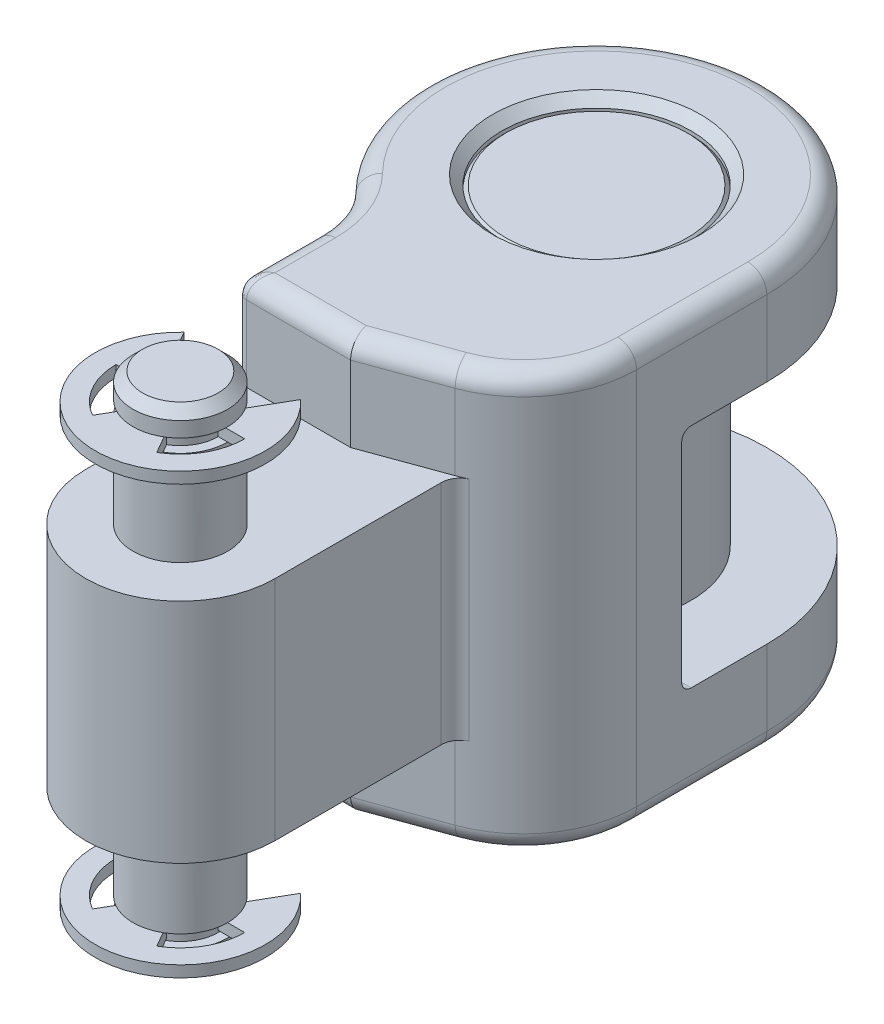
ISO-10303-21;
HEADER;
FILE_DESCRIPTION(('STEP AP214'),'2;1');
FILE_NAME('part.step','',(''),(''),'','','');
FILE_SCHEMA(('AUTOMOTIVE_DESIGN { 1 0 10303 214 1 1 1 1 }'));
ENDSEC;
DATA;
#1=APPLICATION_CONTEXT('core data for automotive mechanical design processes');
#2=APPLICATION_PROTOCOL_DEFINITION('international standard','automotive_design',2000,#1);
#3=PRODUCT_CONTEXT('',#1,'mechanical');
#4=PRODUCT('Part','Part','',(#3));
#5=PRODUCT_RELATED_PRODUCT_CATEGORY('part','',(#4));
#6=PRODUCT_DEFINITION_FORMATION('','',#4);
#7=PRODUCT_DEFINITION_CONTEXT('part definition',#1,'design');
#8=PRODUCT_DEFINITION('design','',#6,#7);
#9=PRODUCT_DEFINITION_SHAPE('','',#8);
#10=(LENGTH_UNIT() NAMED_UNIT(*) SI_UNIT(.MILLI.,.METRE.));
#11=(NAMED_UNIT(*) PLANE_ANGLE_UNIT() SI_UNIT($,.RADIAN.));
#12=(NAMED_UNIT(*) SI_UNIT($,.STERADIAN.) SOLID_ANGLE_UNIT());
#13=UNCERTAINTY_MEASURE_WITH_UNIT(LENGTH_MEASURE(1.E-05),#10,'distance_accuracy_value','');
#14=(GEOMETRIC_REPRESENTATION_CONTEXT(3) GLOBAL_UNCERTAINTY_ASSIGNED_CONTEXT((#13)) GLOBAL_UNIT_ASSIGNED_CONTEXT((#10,
#11,#12)) REPRESENTATION_CONTEXT('',''));
#15=CARTESIAN_POINT('',(0.,0.,0.));
#16=DIRECTION('',(0.,0.,1.));
#17=DIRECTION('',(1.,0.,0.));
#18=AXIS2_PLACEMENT_3D('',#15,#16,#17);
#19=CARTESIAN_POINT('',(0.,11.6,22.));
#20=DIRECTION('',(0.,-1.,0.));
#21=DIRECTION('',(1.00000000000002,0.,0.));
#22=AXIS2_PLACEMENT_3D('',#19,#20,#21);
#23=PLANE('',#22);
#24=DIRECTION('',(-0.50000000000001,0.,0.866025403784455));
#25=VECTOR('',#24,1.);
#26=CARTESIAN_POINT('',(1.75000000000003,11.6,21.0317541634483));
#27=LINE('',#26,#25);
#28=CARTESIAN_POINT('',(3.08333825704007,11.6,18.7223445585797));
#29=VERTEX_POINT('',#28);
#30=CARTESIAN_POINT('',(1.75000000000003,11.6,21.0317541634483));
#31=VERTEX_POINT('',#30);
#32=EDGE_CURVE('E2350',#29,#31,#27,.T.);
#33=ORIENTED_EDGE('',*,*,#32,.T.);
#34=CARTESIAN_POINT('',(0.,11.6,22.));
#35=DIRECTION('',(0.,-1.,0.));
#36=DIRECTION('',(-1.00000000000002,0.,0.));
#37=AXIS2_PLACEMENT_3D('',#34,#35,#36);
#38=CIRCLE('',#37,2.);
#39=CARTESIAN_POINT('',(2.,11.6,22.));
#40=VERTEX_POINT('',#39);
#41=EDGE_CURVE('E2352',#31,#40,#38,.T.);
#42=ORIENTED_EDGE('',*,*,#41,.T.);
#43=DIRECTION('',(1.00000000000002,0.,0.));
#44=VECTOR('',#43,1.);
#45=CARTESIAN_POINT('',(2.,11.6,22.));
#46=LINE('',#45,#44);
#47=CARTESIAN_POINT('',(3.40000000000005,11.6,22.));
#48=VERTEX_POINT('',#47);
#49=EDGE_CURVE('E2380',#40,#48,#46,.T.);
#50=ORIENTED_EDGE('',*,*,#49,.T.);
#51=CARTESIAN_POINT('',(0.,11.6,22.));
#52=DIRECTION('',(0.,-1.,0.));
#53=DIRECTION('',(-1.00000000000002,0.,0.));
#54=AXIS2_PLACEMENT_3D('',#51,#52,#53);
#55=CIRCLE('',#54,3.4);
#56=CARTESIAN_POINT('',(1.6999997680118,11.6,24.9444865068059));
#57=VERTEX_POINT('',#56);
#58=EDGE_CURVE('E2377',#48,#57,#55,.T.);
#59=ORIENTED_EDGE('',*,*,#58,.T.);
#60=DIRECTION('',(-0.500000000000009,0.,-0.866025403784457));
#61=VECTOR('',#60,1.);
#62=CARTESIAN_POINT('',(1.6999997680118,11.6,24.9444865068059));
#63=LINE('',#62,#61);
#64=CARTESIAN_POINT('',(0.999999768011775,11.6,23.7320509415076));
#65=VERTEX_POINT('',#64);
#66=EDGE_CURVE('E2374',#57,#65,#63,.T.);
#67=ORIENTED_EDGE('',*,*,#66,.T.);
#68=CARTESIAN_POINT('',(0.,11.6,22.));
#69=DIRECTION('',(0.,-1.,0.));
#70=DIRECTION('',(-1.00000000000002,0.,0.));
#71=AXIS2_PLACEMENT_3D('',#68,#69,#70);
#72=CIRCLE('',#71,2.);
#73=CARTESIAN_POINT('',(-0.999999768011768,11.6,23.7320509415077));
#74=VERTEX_POINT('',#73);
#75=EDGE_CURVE('E2371',#65,#74,#72,.T.);
#76=ORIENTED_EDGE('',*,*,#75,.T.);
#77=DIRECTION('',(-0.50000000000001,0.,0.866025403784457));
#78=VECTOR('',#77,1.);
#79=CARTESIAN_POINT('',(-0.999999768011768,11.6,23.7320509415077));
#80=LINE('',#79,#78);
#81=CARTESIAN_POINT('',(-1.69999976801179,11.6,24.9444865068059));
#82=VERTEX_POINT('',#81);
#83=EDGE_CURVE('E2368',#74,#82,#80,.T.);
#84=ORIENTED_EDGE('',*,*,#83,.T.);
#85=CARTESIAN_POINT('',(0.,11.6,22.));
#86=DIRECTION('',(0.,-1.,0.));
#87=DIRECTION('',(1.00000000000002,0.,0.));
#88=AXIS2_PLACEMENT_3D('',#85,#86,#87);
#89=CIRCLE('',#88,3.4);
#90=CARTESIAN_POINT('',(-3.40000000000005,11.6,22.));
#91=VERTEX_POINT('',#90);
#92=EDGE_CURVE('E2365',#82,#91,#89,.T.);
#93=ORIENTED_EDGE('',*,*,#92,.T.);
#94=DIRECTION('',(1.00000000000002,0.,0.));
#95=VECTOR('',#94,1.);
#96=CARTESIAN_POINT('',(-3.40000000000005,11.6,22.));
#97=LINE('',#96,#95);
#98=CARTESIAN_POINT('',(-2.00000000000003,11.6,22.));
#99=VERTEX_POINT('',#98);
#100=EDGE_CURVE('E2362',#91,#99,#97,.T.);
#101=ORIENTED_EDGE('',*,*,#100,.T.);
#102=CARTESIAN_POINT('',(0.,11.6,22.));
#103=DIRECTION('',(0.,-1.,0.));
#104=DIRECTION('',(-1.00000000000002,0.,0.));
#105=AXIS2_PLACEMENT_3D('',#102,#103,#104);
#106=CIRCLE('',#105,2.);
#107=CARTESIAN_POINT('',(-1.75000000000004,11.6,21.0317541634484));
#108=VERTEX_POINT('',#107);
#109=EDGE_CURVE('E2359',#99,#108,#106,.T.);
#110=ORIENTED_EDGE('',*,*,#109,.T.);
#111=DIRECTION('',(-0.500000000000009,0.,-0.866025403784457));
#112=VECTOR('',#111,1.);
#113=CARTESIAN_POINT('',(-1.75000000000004,11.6,21.0317541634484));
#114=LINE('',#113,#112);
#115=CARTESIAN_POINT('',(-3.08333825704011,11.6,18.7223445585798));
#116=VERTEX_POINT('',#115);
#117=EDGE_CURVE('E2356',#108,#116,#114,.T.);
#118=ORIENTED_EDGE('',*,*,#117,.T.);
#119=CARTESIAN_POINT('',(0.,11.6,22.));
#120=DIRECTION('',(0.,1.,0.));
#121=DIRECTION('',(0.,0.,-1.00000000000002));
#122=AXIS2_PLACEMENT_3D('',#119,#120,#121);
#123=CIRCLE('',#122,4.5);
#124=EDGE_CURVE('E2349',#116,#29,#123,.T.);
#125=ORIENTED_EDGE('',*,*,#124,.T.);
#126=EDGE_LOOP('',(#33,#42,#50,#59,#67,#76,#84,#93,#101,#110,#118,#125));
#127=FACE_BOUND('',#126,.T.);
#128=ADVANCED_FACE('F15',(#127),#23,.F.);
#129=CARTESIAN_POINT('',(0.,11.6,22.));
#130=DIRECTION('',(0.,-1.,0.));
#131=DIRECTION('',(1.00000000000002,0.,0.));
#132=AXIS2_PLACEMENT_3D('',#129,#130,#131);
#133=CYLINDRICAL_SURFACE('',#132,3.4);
#134=CARTESIAN_POINT('',(0.,11.,22.));
#135=DIRECTION('',(0.,-1.,0.));
#136=DIRECTION('',(1.00000000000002,0.,0.));
#137=AXIS2_PLACEMENT_3D('',#134,#135,#136);
#138=CIRCLE('',#137,3.4);
#139=CARTESIAN_POINT('',(-1.69999976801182,11.,24.9444865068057));
#140=VERTEX_POINT('',#139);
#141=CARTESIAN_POINT('',(-3.40000000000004,11.,22.));
#142=VERTEX_POINT('',#141);
#143=EDGE_CURVE('E2404',#140,#142,#138,.T.);
#144=ORIENTED_EDGE('',*,*,#143,.T.);
#145=DIRECTION('',(0.,-1.,0.));
#146=VECTOR('',#145,1.);
#147=CARTESIAN_POINT('',(-3.40000000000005,11.6,22.));
#148=LINE('',#147,#146);
#149=EDGE_CURVE('E2334',#91,#142,#148,.T.);
#150=ORIENTED_EDGE('',*,*,#149,.F.);
#151=ORIENTED_EDGE('',*,*,#92,.F.);
#152=DIRECTION('',(0.,-1.,0.));
#153=VECTOR('',#152,1.);
#154=CARTESIAN_POINT('',(-1.69999976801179,11.6,24.9444865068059));
#155=LINE('',#154,#153);
#156=EDGE_CURVE('E2331',#82,#140,#155,.T.);
#157=ORIENTED_EDGE('',*,*,#156,.T.);
#158=EDGE_LOOP('',(#144,#150,#151,#157));
#159=FACE_BOUND('',#158,.T.);
#160=ADVANCED_FACE('F915',(#159),#133,.F.);
#161=CARTESIAN_POINT('',(-3.40000000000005,11.6,22.));
#162=DIRECTION('',(0.,0.,-1.00000000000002));
#163=DIRECTION('',(-1.00000000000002,0.,0.));
#164=AXIS2_PLACEMENT_3D('',#161,#162,#163);
#165=PLANE('',#164);
#166=DIRECTION('',(1.00000000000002,0.,0.));
#167=VECTOR('',#166,1.);
#168=CARTESIAN_POINT('',(-3.40000000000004,11.,22.));
#169=LINE('',#168,#167);
#170=CARTESIAN_POINT('',(-2.50000000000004,11.,22.));
#171=VERTEX_POINT('',#170);
#172=EDGE_CURVE('E2399',#142,#171,#169,.T.);
#173=ORIENTED_EDGE('',*,*,#172,.T.);
#174=CARTESIAN_POINT('',(-2.00000000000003,11.,22.));
#175=VERTEX_POINT('',#174);
#176=EDGE_CURVE('E2403',#171,#175,#169,.T.);
#177=ORIENTED_EDGE('',*,*,#176,.T.);
#178=DIRECTION('',(0.,-1.,0.));
#179=VECTOR('',#178,1.);
#180=CARTESIAN_POINT('',(-2.00000000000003,11.6,22.));
#181=LINE('',#180,#179);
#182=EDGE_CURVE('E2337',#99,#175,#181,.T.);
#183=ORIENTED_EDGE('',*,*,#182,.F.);
#184=ORIENTED_EDGE('',*,*,#100,.F.);
#185=ORIENTED_EDGE('',*,*,#149,.T.);
#186=EDGE_LOOP('',(#173,#177,#183,#184,#185));
#187=FACE_BOUND('',#186,.T.);
#188=ADVANCED_FACE('F922',(#187),#165,.F.);
#189=CARTESIAN_POINT('',(-1.75000000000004,11.6,21.0317541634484));
#190=DIRECTION('',(-0.866025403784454,0.,0.500000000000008));
#191=DIRECTION('',(0.500000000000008,0.,0.866025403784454));
#192=AXIS2_PLACEMENT_3D('',#189,#190,#191);
#193=PLANE('',#192);
#194=DIRECTION('',(-0.500000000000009,0.,-0.866025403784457));
#195=VECTOR('',#194,1.);
#196=CARTESIAN_POINT('',(-1.75000000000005,11.,21.0317541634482));
#197=LINE('',#196,#195);
#198=CARTESIAN_POINT('',(-1.75000000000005,11.,21.0317541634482));
#199=VERTEX_POINT('',#198);
#200=CARTESIAN_POINT('',(-2.03189541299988,11.,20.5434969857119));
#201=VERTEX_POINT('',#200);
#202=EDGE_CURVE('E2394',#199,#201,#197,.T.);
#203=ORIENTED_EDGE('',*,*,#202,.T.);
#204=CARTESIAN_POINT('',(-3.08333825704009,11.,18.7223445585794));
#205=VERTEX_POINT('',#204);
#206=EDGE_CURVE('E2398',#201,#205,#197,.T.);
#207=ORIENTED_EDGE('',*,*,#206,.T.);
#208=DIRECTION('',(0.,-1.,0.));
#209=VECTOR('',#208,1.);
#210=CARTESIAN_POINT('',(-3.08333825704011,11.6,18.7223445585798));
#211=LINE('',#210,#209);
#212=EDGE_CURVE('E2343',#116,#205,#211,.T.);
#213=ORIENTED_EDGE('',*,*,#212,.F.);
#214=ORIENTED_EDGE('',*,*,#117,.F.);
#215=DIRECTION('',(0.,-1.,0.));
#216=VECTOR('',#215,1.);
#217=CARTESIAN_POINT('',(-1.75000000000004,11.6,21.0317541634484));
#218=LINE('',#217,#216);
#219=EDGE_CURVE('E2340',#108,#199,#218,.T.);
#220=ORIENTED_EDGE('',*,*,#219,.T.);
#221=EDGE_LOOP('',(#203,#207,#213,#214,#220));
#222=FACE_BOUND('',#221,.T.);
#223=ADVANCED_FACE('F933',(#222),#193,.F.);
#224=CARTESIAN_POINT('',(0.,11.6,22.));
#225=DIRECTION('',(0.,-1.,0.));
#226=DIRECTION('',(1.00000000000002,0.,0.));
#227=AXIS2_PLACEMENT_3D('',#224,#225,#226);
#228=CYLINDRICAL_SURFACE('',#227,4.5);
#229=CARTESIAN_POINT('',(0.,11.,22.));
#230=DIRECTION('',(0.,1.,0.));
#231=DIRECTION('',(0.,0.,-1.00000000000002));
#232=AXIS2_PLACEMENT_3D('',#229,#230,#231);
#233=CIRCLE('',#232,4.5);
#234=CARTESIAN_POINT('',(3.08333825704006,11.,18.7223445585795));
#235=VERTEX_POINT('',#234);
#236=EDGE_CURVE('E2353',#205,#235,#233,.T.);
#237=ORIENTED_EDGE('',*,*,#236,.T.);
#238=DIRECTION('',(0.,-1.,0.));
#239=VECTOR('',#238,1.);
#240=CARTESIAN_POINT('',(3.08333825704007,11.6,18.7223445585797));
#241=LINE('',#240,#239);
#242=EDGE_CURVE('E2346',#29,#235,#241,.T.);
#243=ORIENTED_EDGE('',*,*,#242,.F.);
#244=ORIENTED_EDGE('',*,*,#124,.F.);
#245=ORIENTED_EDGE('',*,*,#212,.T.);
#246=EDGE_LOOP('',(#237,#243,#244,#245));
#247=FACE_BOUND('',#246,.T.);
#248=ADVANCED_FACE('F929',(#247),#228,.T.);
#249=CARTESIAN_POINT('',(1.75000000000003,11.6,21.0317541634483));
#250=DIRECTION('',(0.866025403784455,0.,0.50000000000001));
#251=DIRECTION('',(0.50000000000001,0.,-0.866025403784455));
#252=AXIS2_PLACEMENT_3D('',#249,#250,#251);
#253=PLANE('',#252);
#254=DIRECTION('',(-0.50000000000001,0.,0.866025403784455));
#255=VECTOR('',#254,1.);
#256=CARTESIAN_POINT('',(1.75000000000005,11.,21.0317541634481));
#257=LINE('',#256,#255);
#258=CARTESIAN_POINT('',(2.03189541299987,11.,20.5434969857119));
#259=VERTEX_POINT('',#258);
#260=EDGE_CURVE('E2385',#235,#259,#257,.T.);
#261=ORIENTED_EDGE('',*,*,#260,.T.);
#262=CARTESIAN_POINT('',(1.75000000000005,11.,21.0317541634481));
#263=VERTEX_POINT('',#262);
#264=EDGE_CURVE('E2390',#259,#263,#257,.T.);
#265=ORIENTED_EDGE('',*,*,#264,.T.);
#266=DIRECTION('',(0.,-1.,0.));
#267=VECTOR('',#266,1.);
#268=CARTESIAN_POINT('',(1.75000000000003,11.6,21.0317541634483));
#269=LINE('',#268,#267);
#270=EDGE_CURVE('E2314',#31,#263,#269,.T.);
#271=ORIENTED_EDGE('',*,*,#270,.F.);
#272=ORIENTED_EDGE('',*,*,#32,.F.);
#273=ORIENTED_EDGE('',*,*,#242,.T.);
#274=EDGE_LOOP('',(#261,#265,#271,#272,#273));
#275=FACE_BOUND('',#274,.T.);
#276=ADVANCED_FACE('F932',(#275),#253,.F.);
#277=CARTESIAN_POINT('',(2.,11.6,22.));
#278=DIRECTION('',(0.,0.,-1.00000000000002));
#279=DIRECTION('',(0.,-1.,0.));
#280=AXIS2_PLACEMENT_3D('',#277,#278,#279);
#281=PLANE('',#280);
#282=DIRECTION('',(1.00000000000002,0.,0.));
#283=VECTOR('',#282,1.);
#284=CARTESIAN_POINT('',(2.00000000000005,11.,22.));
#285=LINE('',#284,#283);
#286=CARTESIAN_POINT('',(2.00000000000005,11.,22.));
#287=VERTEX_POINT('',#286);
#288=CARTESIAN_POINT('',(2.50000000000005,11.,22.));
#289=VERTEX_POINT('',#288);
#290=EDGE_CURVE('E35',#287,#289,#285,.T.);
#291=ORIENTED_EDGE('',*,*,#290,.T.);
#292=CARTESIAN_POINT('',(3.40000000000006,11.,22.));
#293=VERTEX_POINT('',#292);
#294=EDGE_CURVE('E2389',#289,#293,#285,.T.);
#295=ORIENTED_EDGE('',*,*,#294,.T.);
#296=DIRECTION('',(0.,-1.,0.));
#297=VECTOR('',#296,1.);
#298=CARTESIAN_POINT('',(3.40000000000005,11.6,22.));
#299=LINE('',#298,#297);
#300=EDGE_CURVE('E2319',#48,#293,#299,.T.);
#301=ORIENTED_EDGE('',*,*,#300,.F.);
#302=ORIENTED_EDGE('',*,*,#49,.F.);
#303=DIRECTION('',(0.,-1.,0.));
#304=VECTOR('',#303,1.);
#305=CARTESIAN_POINT('',(2.,11.6,22.));
#306=LINE('',#305,#304);
#307=EDGE_CURVE('E2317',#40,#287,#306,.T.);
#308=ORIENTED_EDGE('',*,*,#307,.T.);
#309=EDGE_LOOP('',(#291,#295,#301,#302,#308));
#310=FACE_BOUND('',#309,.T.);
#311=ADVANCED_FACE('F952',(#310),#281,.F.);
#312=CARTESIAN_POINT('',(0.,11.6,22.));
#313=DIRECTION('',(0.,-1.,0.));
#314=DIRECTION('',(1.00000000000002,0.,0.));
#315=AXIS2_PLACEMENT_3D('',#312,#313,#314);
#316=CYLINDRICAL_SURFACE('',#315,3.4);
#317=CARTESIAN_POINT('',(0.,11.,22.));
#318=DIRECTION('',(0.,-1.,0.));
#319=DIRECTION('',(-1.00000000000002,0.,0.));
#320=AXIS2_PLACEMENT_3D('',#317,#318,#319);
#321=CIRCLE('',#320,3.4);
#322=CARTESIAN_POINT('',(1.69999976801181,11.,24.9444865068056));
#323=VERTEX_POINT('',#322);
#324=EDGE_CURVE('E2418',#293,#323,#321,.T.);
#325=ORIENTED_EDGE('',*,*,#324,.T.);
#326=DIRECTION('',(0.,-1.,0.));
#327=VECTOR('',#326,1.);
#328=CARTESIAN_POINT('',(1.6999997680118,11.6,24.9444865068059));
#329=LINE('',#328,#327);
#330=EDGE_CURVE('E2322',#57,#323,#329,.T.);
#331=ORIENTED_EDGE('',*,*,#330,.F.);
#332=ORIENTED_EDGE('',*,*,#58,.F.);
#333=ORIENTED_EDGE('',*,*,#300,.T.);
#334=EDGE_LOOP('',(#325,#331,#332,#333));
#335=FACE_BOUND('',#334,.T.);
#336=ADVANCED_FACE('F948',(#335),#316,.F.);
#337=CARTESIAN_POINT('',(1.6999997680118,11.6,24.9444865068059));
#338=DIRECTION('',(-0.866025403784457,0.,0.500000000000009));
#339=DIRECTION('',(0.500000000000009,0.,0.866025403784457));
#340=AXIS2_PLACEMENT_3D('',#337,#338,#339);
#341=PLANE('',#340);
#342=DIRECTION('',(-0.500000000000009,0.,-0.866025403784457));
#343=VECTOR('',#342,1.);
#344=CARTESIAN_POINT('',(1.69999976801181,11.,24.9444865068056));
#345=LINE('',#344,#343);
#346=CARTESIAN_POINT('',(1.24999976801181,11.,24.1650636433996));
#347=VERTEX_POINT('',#346);
#348=EDGE_CURVE('E2413',#323,#347,#345,.T.);
#349=ORIENTED_EDGE('',*,*,#348,.T.);
#350=CARTESIAN_POINT('',(0.999999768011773,11.,23.7320509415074));
#351=VERTEX_POINT('',#350);
#352=EDGE_CURVE('E2417',#347,#351,#345,.T.);
#353=ORIENTED_EDGE('',*,*,#352,.T.);
#354=DIRECTION('',(0.,-1.,0.));
#355=VECTOR('',#354,1.);
#356=CARTESIAN_POINT('',(0.999999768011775,11.6,23.7320509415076));
#357=LINE('',#356,#355);
#358=EDGE_CURVE('E2325',#65,#351,#357,.T.);
#359=ORIENTED_EDGE('',*,*,#358,.F.);
#360=ORIENTED_EDGE('',*,*,#66,.F.);
#361=ORIENTED_EDGE('',*,*,#330,.T.);
#362=EDGE_LOOP('',(#349,#353,#359,#360,#361));
#363=FACE_BOUND('',#362,.T.);
#364=ADVANCED_FACE('F944',(#363),#341,.F.);
#365=CARTESIAN_POINT('',(-0.999999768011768,11.6,23.7320509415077));
#366=DIRECTION('',(0.866025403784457,0.,0.50000000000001));
#367=DIRECTION('',(0.50000000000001,0.,-0.866025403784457));
#368=AXIS2_PLACEMENT_3D('',#365,#366,#367);
#369=PLANE('',#368);
#370=DIRECTION('',(-0.50000000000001,0.,0.866025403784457));
#371=VECTOR('',#370,1.);
#372=CARTESIAN_POINT('',(-0.999999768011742,11.,23.7320509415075));
#373=LINE('',#372,#371);
#374=CARTESIAN_POINT('',(-0.999999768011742,11.,23.7320509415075));
#375=VERTEX_POINT('',#374);
#376=CARTESIAN_POINT('',(-1.2499997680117,11.,24.1650636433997));
#377=VERTEX_POINT('',#376);
#378=EDGE_CURVE('E2408',#375,#377,#373,.T.);
#379=ORIENTED_EDGE('',*,*,#378,.T.);
#380=EDGE_CURVE('E2412',#377,#140,#373,.T.);
#381=ORIENTED_EDGE('',*,*,#380,.T.);
#382=ORIENTED_EDGE('',*,*,#156,.F.);
#383=ORIENTED_EDGE('',*,*,#83,.F.);
#384=DIRECTION('',(0.,-1.,0.));
#385=VECTOR('',#384,1.);
#386=CARTESIAN_POINT('',(-0.999999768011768,11.6,23.7320509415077));
#387=LINE('',#386,#385);
#388=EDGE_CURVE('E2328',#74,#375,#387,.T.);
#389=ORIENTED_EDGE('',*,*,#388,.T.);
#390=EDGE_LOOP('',(#379,#381,#382,#383,#389));
#391=FACE_BOUND('',#390,.T.);
#392=ADVANCED_FACE('F941',(#391),#369,.F.);
#393=CARTESIAN_POINT('',(0.,11.,22.));
#394=DIRECTION('',(0.,-1.,0.));
#395=DIRECTION('',(1.00000000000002,0.,0.));
#396=AXIS2_PLACEMENT_3D('',#393,#394,#395);
#397=PLANE('',#396);
#398=ORIENTED_EDGE('',*,*,#380,.F.);
#399=CARTESIAN_POINT('',(0.,11.,22.));
#400=DIRECTION('',(0.,-1.,0.));
#401=DIRECTION('',(-1.,0.,0.));
#402=AXIS2_PLACEMENT_3D('',#399,#400,#401);
#403=CIRCLE('',#402,2.5);
#404=EDGE_CURVE('E9',#377,#347,#403,.F.);
#405=ORIENTED_EDGE('',*,*,#404,.T.);
#406=ORIENTED_EDGE('',*,*,#348,.F.);
#407=ORIENTED_EDGE('',*,*,#324,.F.);
#408=ORIENTED_EDGE('',*,*,#294,.F.);
#409=EDGE_CURVE('E25',#289,#259,#403,.F.);
#410=ORIENTED_EDGE('',*,*,#409,.T.);
#411=ORIENTED_EDGE('',*,*,#260,.F.);
#412=ORIENTED_EDGE('',*,*,#236,.F.);
#413=ORIENTED_EDGE('',*,*,#206,.F.);
#414=EDGE_CURVE('E27',#201,#171,#403,.F.);
#415=ORIENTED_EDGE('',*,*,#414,.T.);
#416=ORIENTED_EDGE('',*,*,#172,.F.);
#417=ORIENTED_EDGE('',*,*,#143,.F.);
#418=EDGE_LOOP('',(#398,#405,#406,#407,#408,#410,#411,#412,#413,#415,#416,#417));
#419=FACE_BOUND('',#418,.T.);
#420=ADVANCED_FACE('F928',(#419),#397,.T.);
#421=CARTESIAN_POINT('',(0.,-13.,22.));
#422=DIRECTION('',(0.,1.,0.));
#423=DIRECTION('',(-1.,0.,0.));
#424=AXIS2_PLACEMENT_3D('',#421,#422,#423);
#425=PLANE('',#424);
#426=CARTESIAN_POINT('',(0.,-13.,22.));
#427=DIRECTION('',(0.,1.,0.));
#428=DIRECTION('',(-1.,0.,0.));
#429=AXIS2_PLACEMENT_3D('',#426,#427,#428);
#430=CIRCLE('',#429,2.);
#431=CARTESIAN_POINT('',(-1.99999999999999,-13.,22.));
#432=VERTEX_POINT('',#431);
#433=EDGE_CURVE('E2166',#432,#432,#430,.F.);
#434=ORIENTED_EDGE('',*,*,#433,.T.);
#435=EDGE_LOOP('',(#434));
#436=FACE_BOUND('',#435,.T.);
#437=ADVANCED_FACE('F1051',(#436),#425,.F.);
#438=CARTESIAN_POINT('',(0.,-12.5,22.));
#439=DIRECTION('',(0.,1.,0.));
#440=DIRECTION('',(-1.,0.,0.));
#441=AXIS2_PLACEMENT_3D('',#438,#439,#440);
#442=CONICAL_SURFACE('',#441,2.5,0.785398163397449);
#443=ORIENTED_EDGE('',*,*,#433,.F.);
#444=EDGE_LOOP('',(#443));
#445=FACE_BOUND('',#444,.T.);
#446=CARTESIAN_POINT('',(0.,-12.5,22.));
#447=DIRECTION('',(0.,1.,0.));
#448=DIRECTION('',(-1.,0.,0.));
#449=AXIS2_PLACEMENT_3D('',#446,#447,#448);
#450=CIRCLE('',#449,2.5);
#451=CARTESIAN_POINT('',(-2.49999999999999,-12.5,22.));
#452=VERTEX_POINT('',#451);
#453=EDGE_CURVE('E2169',#452,#452,#450,.T.);
#454=ORIENTED_EDGE('',*,*,#453,.F.);
#455=EDGE_LOOP('',(#454));
#456=FACE_BOUND('',#455,.T.);
#457=ADVANCED_FACE('F1047',(#445,#456),#442,.T.);
#458=CARTESIAN_POINT('',(0.,-10.5,0.));
#459=DIRECTION('',(0.,1.,0.));
#460=DIRECTION('',(-1.,0.,0.));
#461=AXIS2_PLACEMENT_3D('',#458,#459,#460);
#462=PLANE('',#461);
#463=CARTESIAN_POINT('',(0.,-10.5,0.));
#464=DIRECTION('',(0.,1.,0.));
#465=DIRECTION('',(-1.,0.,0.));
#466=AXIS2_PLACEMENT_3D('',#463,#464,#465);
#467=CIRCLE('',#466,4.8);
#468=CARTESIAN_POINT('',(-4.79999999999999,-10.5,0.));
#469=VERTEX_POINT('',#468);
#470=EDGE_CURVE('E2143',#469,#469,#467,.F.);
#471=ORIENTED_EDGE('',*,*,#470,.T.);
#472=EDGE_LOOP('',(#471));
#473=FACE_BOUND('',#472,.T.);
#474=ADVANCED_FACE('F1050',(#473),#462,.F.);
#475=CARTESIAN_POINT('',(0.,10.5,0.));
#476=DIRECTION('',(0.,1.,0.));
#477=DIRECTION('',(-1.,0.,0.));
#478=AXIS2_PLACEMENT_3D('',#475,#476,#477);
#479=PLANE('',#478);
#480=CARTESIAN_POINT('',(0.,10.5,0.));
#481=DIRECTION('',(0.,1.,0.));
#482=DIRECTION('',(-1.,0.,0.));
#483=AXIS2_PLACEMENT_3D('',#480,#481,#482);
#484=CIRCLE('',#483,4.8);
#485=CARTESIAN_POINT('',(-4.79999999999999,10.5,0.));
#486=VERTEX_POINT('',#485);
#487=EDGE_CURVE('E1684',#486,#486,#484,.T.);
#488=ORIENTED_EDGE('',*,*,#487,.T.);
#489=EDGE_LOOP('',(#488));
#490=FACE_BOUND('',#489,.T.);
#491=ADVANCED_FACE('F1069',(#490),#479,.T.);
#492=CARTESIAN_POINT('',(0.,13.,22.));
#493=DIRECTION('',(0.,-1.,0.));
#494=DIRECTION('',(1.,0.,0.));
#495=AXIS2_PLACEMENT_3D('',#492,#493,#494);
#496=CYLINDRICAL_SURFACE('',#495,2.5);
#497=ORIENTED_EDGE('',*,*,#453,.T.);
#498=EDGE_LOOP('',(#497));
#499=FACE_BOUND('',#498,.T.);
#500=CARTESIAN_POINT('',(0.,-11.7,22.));
#501=DIRECTION('',(0.,-1.,0.));
#502=DIRECTION('',(1.,0.,0.));
#503=AXIS2_PLACEMENT_3D('',#500,#501,#502);
#504=CIRCLE('',#503,2.5);
#505=CARTESIAN_POINT('',(2.50000000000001,-11.7,22.));
#506=VERTEX_POINT('',#505);
#507=EDGE_CURVE('E2199',#506,#506,#504,.T.);
#508=ORIENTED_EDGE('',*,*,#507,.T.);
#509=EDGE_LOOP('',(#508));
#510=FACE_BOUND('',#509,.T.);
#511=ADVANCED_FACE('F1013',(#499,#510),#496,.T.);
#512=CARTESIAN_POINT('',(0.,-10.3,0.));
#513=DIRECTION('',(0.,1.,0.));
#514=DIRECTION('',(-1.,0.,0.));
#515=AXIS2_PLACEMENT_3D('',#512,#513,#514);
#516=CONICAL_SURFACE('',#515,5.,0.785398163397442);
#517=ORIENTED_EDGE('',*,*,#470,.F.);
#518=EDGE_LOOP('',(#517));
#519=FACE_BOUND('',#518,.T.);
#520=CARTESIAN_POINT('',(0.,-10.3,0.));
#521=DIRECTION('',(0.,1.,0.));
#522=DIRECTION('',(-1.,0.,0.));
#523=AXIS2_PLACEMENT_3D('',#520,#521,#522);
#524=CIRCLE('',#523,5.);
#525=CARTESIAN_POINT('',(-4.99999999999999,-10.3,0.));
#526=VERTEX_POINT('',#525);
#527=EDGE_CURVE('E2140',#526,#526,#524,.T.);
#528=ORIENTED_EDGE('',*,*,#527,.F.);
#529=EDGE_LOOP('',(#528));
#530=FACE_BOUND('',#529,.T.);
#531=ADVANCED_FACE('F1067',(#519,#530),#516,.T.);
#532=CARTESIAN_POINT('',(0.,10.5,0.));
#533=DIRECTION('',(0.,-1.,0.));
#534=DIRECTION('',(1.,0.,0.));
#535=AXIS2_PLACEMENT_3D('',#532,#533,#534);
#536=CONICAL_SURFACE('',#535,4.8,0.785398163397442);
#537=CARTESIAN_POINT('',(0.,10.3,0.));
#538=DIRECTION('',(0.,1.,0.));
#539=DIRECTION('',(-1.,0.,0.));
#540=AXIS2_PLACEMENT_3D('',#537,#538,#539);
#541=CIRCLE('',#540,5.);
#542=CARTESIAN_POINT('',(-4.99999999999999,10.3,0.));
#543=VERTEX_POINT('',#542);
#544=EDGE_CURVE('E413',#543,#543,#541,.F.);
#545=ORIENTED_EDGE('',*,*,#544,.F.);
#546=EDGE_LOOP('',(#545));
#547=FACE_BOUND('',#546,.T.);
#548=ORIENTED_EDGE('',*,*,#487,.F.);
#549=EDGE_LOOP('',(#548));
#550=FACE_BOUND('',#549,.T.);
#551=ADVANCED_FACE('F963',(#547,#550),#536,.T.);
#552=CARTESIAN_POINT('',(0.,-11.6,22.));
#553=DIRECTION('',(0.,-1.,0.));
#554=DIRECTION('',(1.00000000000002,0.,0.));
#555=AXIS2_PLACEMENT_3D('',#552,#553,#554);
#556=PLANE('',#555);
#557=DIRECTION('',(-0.50000000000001,0.,0.866025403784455));
#558=VECTOR('',#557,1.);
#559=CARTESIAN_POINT('',(1.75000000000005,-11.6,21.0317541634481));
#560=LINE('',#559,#558);
#561=CARTESIAN_POINT('',(3.08333825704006,-11.6,18.7223445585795));
#562=VERTEX_POINT('',#561);
#563=CARTESIAN_POINT('',(1.75000000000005,-11.6,21.0317541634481));
#564=VERTEX_POINT('',#563);
#565=EDGE_CURVE('E2159',#562,#564,#560,.T.);
#566=ORIENTED_EDGE('',*,*,#565,.F.);
#567=CARTESIAN_POINT('',(0.,-11.6,22.));
#568=DIRECTION('',(0.,1.,0.));
#569=DIRECTION('',(0.,0.,-1.00000000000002));
#570=AXIS2_PLACEMENT_3D('',#567,#568,#569);
#571=CIRCLE('',#570,4.5);
#572=CARTESIAN_POINT('',(-3.08333825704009,-11.6,18.7223445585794));
#573=VERTEX_POINT('',#572);
#574=EDGE_CURVE('E2276',#573,#562,#571,.T.);
#575=ORIENTED_EDGE('',*,*,#574,.F.);
#576=DIRECTION('',(-0.500000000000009,0.,-0.866025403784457));
#577=VECTOR('',#576,1.);
#578=CARTESIAN_POINT('',(-1.75000000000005,-11.6,21.0317541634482));
#579=LINE('',#578,#577);
#580=CARTESIAN_POINT('',(-1.75000000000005,-11.6,21.0317541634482));
#581=VERTEX_POINT('',#580);
#582=EDGE_CURVE('E2279',#581,#573,#579,.T.);
#583=ORIENTED_EDGE('',*,*,#582,.F.);
#584=CARTESIAN_POINT('',(0.,-11.6,22.));
#585=DIRECTION('',(0.,-1.,0.));
#586=DIRECTION('',(-1.00000000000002,0.,0.));
#587=AXIS2_PLACEMENT_3D('',#584,#585,#586);
#588=CIRCLE('',#587,2.);
#589=CARTESIAN_POINT('',(-2.00000000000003,-11.6,22.));
#590=VERTEX_POINT('',#589);
#591=EDGE_CURVE('E2282',#590,#581,#588,.T.);
#592=ORIENTED_EDGE('',*,*,#591,.F.);
#593=DIRECTION('',(1.00000000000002,0.,0.));
#594=VECTOR('',#593,1.);
#595=CARTESIAN_POINT('',(-3.40000000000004,-11.6,22.));
#596=LINE('',#595,#594);
#597=CARTESIAN_POINT('',(-3.40000000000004,-11.6,22.));
#598=VERTEX_POINT('',#597);
#599=EDGE_CURVE('E2286',#598,#590,#596,.T.);
#600=ORIENTED_EDGE('',*,*,#599,.F.);
#601=CARTESIAN_POINT('',(0.,-11.6,22.));
#602=DIRECTION('',(0.,-1.,0.));
#603=DIRECTION('',(1.00000000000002,0.,0.));
#604=AXIS2_PLACEMENT_3D('',#601,#602,#603);
#605=CIRCLE('',#604,3.4);
#606=CARTESIAN_POINT('',(-1.69999976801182,-11.6,24.9444865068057));
#607=VERTEX_POINT('',#606);
#608=EDGE_CURVE('E2290',#607,#598,#605,.T.);
#609=ORIENTED_EDGE('',*,*,#608,.F.);
#610=DIRECTION('',(-0.50000000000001,0.,0.866025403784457));
#611=VECTOR('',#610,1.);
#612=CARTESIAN_POINT('',(-0.999999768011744,-11.6,23.7320509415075));
#613=LINE('',#612,#611);
#614=CARTESIAN_POINT('',(-0.999999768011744,-11.6,23.7320509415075));
#615=VERTEX_POINT('',#614);
#616=EDGE_CURVE('E2293',#615,#607,#613,.T.);
#617=ORIENTED_EDGE('',*,*,#616,.F.);
#618=CARTESIAN_POINT('',(0.,-11.6,22.));
#619=DIRECTION('',(0.,-1.,0.));
#620=DIRECTION('',(-1.00000000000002,0.,0.));
#621=AXIS2_PLACEMENT_3D('',#618,#619,#620);
#622=CIRCLE('',#621,2.);
#623=CARTESIAN_POINT('',(0.999999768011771,-11.6,23.7320509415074));
#624=VERTEX_POINT('',#623);
#625=EDGE_CURVE('E2296',#624,#615,#622,.T.);
#626=ORIENTED_EDGE('',*,*,#625,.F.);
#627=DIRECTION('',(-0.500000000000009,0.,-0.866025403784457));
#628=VECTOR('',#627,1.);
#629=CARTESIAN_POINT('',(1.69999976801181,-11.6,24.9444865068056));
#630=LINE('',#629,#628);
#631=CARTESIAN_POINT('',(1.69999976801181,-11.6,24.9444865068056));
#632=VERTEX_POINT('',#631);
#633=EDGE_CURVE('E2300',#632,#624,#630,.T.);
#634=ORIENTED_EDGE('',*,*,#633,.F.);
#635=CARTESIAN_POINT('',(0.,-11.6,22.));
#636=DIRECTION('',(0.,-1.,0.));
#637=DIRECTION('',(-1.00000000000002,0.,0.));
#638=AXIS2_PLACEMENT_3D('',#635,#636,#637);
#639=CIRCLE('',#638,3.4);
#640=CARTESIAN_POINT('',(3.40000000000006,-11.6,22.));
#641=VERTEX_POINT('',#640);
#642=EDGE_CURVE('E2304',#641,#632,#639,.T.);
#643=ORIENTED_EDGE('',*,*,#642,.F.);
#644=DIRECTION('',(1.00000000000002,0.,0.));
#645=VECTOR('',#644,1.);
#646=CARTESIAN_POINT('',(2.00000000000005,-11.6,22.));
#647=LINE('',#646,#645);
#648=CARTESIAN_POINT('',(2.00000000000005,-11.6,22.));
#649=VERTEX_POINT('',#648);
#650=EDGE_CURVE('E2307',#649,#641,#647,.T.);
#651=ORIENTED_EDGE('',*,*,#650,.F.);
#652=CARTESIAN_POINT('',(0.,-11.6,22.));
#653=DIRECTION('',(0.,-1.,0.));
#654=DIRECTION('',(-1.00000000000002,0.,0.));
#655=AXIS2_PLACEMENT_3D('',#652,#653,#654);
#656=CIRCLE('',#655,2.);
#657=EDGE_CURVE('E2275',#564,#649,#656,.T.);
#658=ORIENTED_EDGE('',*,*,#657,.F.);
#659=EDGE_LOOP('',(#566,#575,#583,#592,#600,#609,#617,#626,#634,#643,#651,#658));
#660=FACE_BOUND('',#659,.T.);
#661=ADVANCED_FACE('F959',(#660),#556,.T.);
#662=CARTESIAN_POINT('',(0.,-11.7,24.5));
#663=DIRECTION('',(0.,1.,0.));
#664=DIRECTION('',(1.,0.,0.));
#665=AXIS2_PLACEMENT_3D('',#662,#663,#664);
#666=PLANE('',#665);
#667=ORIENTED_EDGE('',*,*,#507,.F.);
#668=EDGE_LOOP('',(#667));
#669=FACE_BOUND('',#668,.T.);
#670=CARTESIAN_POINT('',(0.,-11.7,22.));
#671=DIRECTION('',(0.,-1.,0.));
#672=DIRECTION('',(1.,0.,0.));
#673=AXIS2_PLACEMENT_3D('',#670,#671,#672);
#674=CIRCLE('',#673,2.);
#675=CARTESIAN_POINT('',(2.00000000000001,-11.7,22.));
#676=VERTEX_POINT('',#675);
#677=EDGE_CURVE('E2196',#676,#676,#674,.T.);
#678=ORIENTED_EDGE('',*,*,#677,.T.);
#679=EDGE_LOOP('',(#678));
#680=FACE_BOUND('',#679,.T.);
#681=ADVANCED_FACE('F962',(#669,#680),#666,.T.);
#682=CARTESIAN_POINT('',(0.,-16.5,0.));
#683=DIRECTION('',(0.,1.,0.));
#684=DIRECTION('',(-1.,0.,0.));
#685=AXIS2_PLACEMENT_3D('',#682,#683,#684);
#686=CYLINDRICAL_SURFACE('',#685,5.);
#687=ORIENTED_EDGE('',*,*,#527,.T.);
#688=EDGE_LOOP('',(#687));
#689=FACE_BOUND('',#688,.T.);
#690=CARTESIAN_POINT('',(0.,-10.5,0.));
#691=DIRECTION('',(0.,1.,0.));
#692=DIRECTION('',(-1.,0.,0.));
#693=AXIS2_PLACEMENT_3D('',#690,#691,#692);
#694=CIRCLE('',#693,5.);
#695=CARTESIAN_POINT('',(-5.,-10.5,0.));
#696=VERTEX_POINT('',#695);
#697=EDGE_CURVE('E1635',#696,#696,#694,.F.);
#698=ORIENTED_EDGE('',*,*,#697,.T.);
#699=EDGE_LOOP('',(#698));
#700=FACE_BOUND('',#699,.T.);
#701=ADVANCED_FACE('F1011',(#689,#700),#686,.F.);
#702=ORIENTED_EDGE('',*,*,#544,.T.);
#703=EDGE_LOOP('',(#702));
#704=FACE_BOUND('',#703,.T.);
#705=CARTESIAN_POINT('',(0.,10.5,0.));
#706=DIRECTION('',(0.,-1.,0.));
#707=DIRECTION('',(1.,0.,0.));
#708=AXIS2_PLACEMENT_3D('',#705,#706,#707);
#709=CIRCLE('',#708,5.);
#710=CARTESIAN_POINT('',(5.,10.5,0.));
#711=VERTEX_POINT('',#710);
#712=EDGE_CURVE('E655',#711,#711,#709,.F.);
#713=ORIENTED_EDGE('',*,*,#712,.T.);
#714=EDGE_LOOP('',(#713));
#715=FACE_BOUND('',#714,.T.);
#716=ADVANCED_FACE('F905',(#704,#715),#686,.F.);
#717=CARTESIAN_POINT('',(0.,-11.,22.));
#718=DIRECTION('',(0.,-1.,0.));
#719=DIRECTION('',(1.00000000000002,0.,0.));
#720=AXIS2_PLACEMENT_3D('',#717,#718,#719);
#721=CYLINDRICAL_SURFACE('',#720,3.4);
#722=ORIENTED_EDGE('',*,*,#642,.T.);
#723=DIRECTION('',(0.,-1.,0.));
#724=VECTOR('',#723,1.);
#725=CARTESIAN_POINT('',(1.6999997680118,-11.,24.9444865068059));
#726=LINE('',#725,#724);
#727=CARTESIAN_POINT('',(1.6999997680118,-11.,24.9444865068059));
#728=VERTEX_POINT('',#727);
#729=EDGE_CURVE('E2219',#728,#632,#726,.T.);
#730=ORIENTED_EDGE('',*,*,#729,.F.);
#731=CARTESIAN_POINT('',(0.,-11.,22.));
#732=DIRECTION('',(0.,-1.,0.));
#733=DIRECTION('',(-1.00000000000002,0.,0.));
#734=AXIS2_PLACEMENT_3D('',#731,#732,#733);
#735=CIRCLE('',#734,3.4);
#736=CARTESIAN_POINT('',(3.40000000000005,-11.,22.));
#737=VERTEX_POINT('',#736);
#738=EDGE_CURVE('E2267',#737,#728,#735,.T.);
#739=ORIENTED_EDGE('',*,*,#738,.F.);
#740=DIRECTION('',(0.,-1.,0.));
#741=VECTOR('',#740,1.);
#742=CARTESIAN_POINT('',(3.40000000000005,-11.,22.));
#743=LINE('',#742,#741);
#744=EDGE_CURVE('E2216',#737,#641,#743,.T.);
#745=ORIENTED_EDGE('',*,*,#744,.T.);
#746=EDGE_LOOP('',(#722,#730,#739,#745));
#747=FACE_BOUND('',#746,.T.);
#748=ADVANCED_FACE('F997',(#747),#721,.F.);
#749=CARTESIAN_POINT('',(1.75000000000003,-11.,21.0317541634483));
#750=DIRECTION('',(0.866025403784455,0.,0.50000000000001));
#751=DIRECTION('',(0.50000000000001,0.,-0.866025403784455));
#752=AXIS2_PLACEMENT_3D('',#749,#750,#751);
#753=PLANE('',#752);
#754=ORIENTED_EDGE('',*,*,#565,.T.);
#755=DIRECTION('',(0.,-1.,0.));
#756=VECTOR('',#755,1.);
#757=CARTESIAN_POINT('',(1.75000000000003,-11.,21.0317541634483));
#758=LINE('',#757,#756);
#759=CARTESIAN_POINT('',(1.75000000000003,-11.,21.0317541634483));
#760=VERTEX_POINT('',#759);
#761=EDGE_CURVE('E2211',#760,#564,#758,.T.);
#762=ORIENTED_EDGE('',*,*,#761,.F.);
#763=DIRECTION('',(-0.50000000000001,0.,0.866025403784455));
#764=VECTOR('',#763,1.);
#765=CARTESIAN_POINT('',(1.75000000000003,-11.,21.0317541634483));
#766=LINE('',#765,#764);
#767=CARTESIAN_POINT('',(2.03189541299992,-11.,20.543496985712));
#768=VERTEX_POINT('',#767);
#769=EDGE_CURVE('E2247',#768,#760,#766,.T.);
#770=ORIENTED_EDGE('',*,*,#769,.F.);
#771=CARTESIAN_POINT('',(3.08333825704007,-11.,18.7223445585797));
#772=VERTEX_POINT('',#771);
#773=EDGE_CURVE('E2243',#772,#768,#766,.T.);
#774=ORIENTED_EDGE('',*,*,#773,.F.);
#775=DIRECTION('',(0.,-1.,0.));
#776=VECTOR('',#775,1.);
#777=CARTESIAN_POINT('',(3.08333825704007,-11.,18.7223445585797));
#778=LINE('',#777,#776);
#779=EDGE_CURVE('E2239',#772,#562,#778,.T.);
#780=ORIENTED_EDGE('',*,*,#779,.T.);
#781=EDGE_LOOP('',(#754,#762,#770,#774,#780));
#782=FACE_BOUND('',#781,.T.);
#783=ADVANCED_FACE('F966',(#782),#753,.F.);
#784=CARTESIAN_POINT('',(0.,-11.,22.));
#785=DIRECTION('',(0.,-1.,0.));
#786=DIRECTION('',(1.00000000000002,0.,0.));
#787=AXIS2_PLACEMENT_3D('',#784,#785,#786);
#788=CYLINDRICAL_SURFACE('',#787,4.5);
#789=ORIENTED_EDGE('',*,*,#574,.T.);
#790=ORIENTED_EDGE('',*,*,#779,.F.);
#791=CARTESIAN_POINT('',(0.,-11.,22.));
#792=DIRECTION('',(0.,1.,0.));
#793=DIRECTION('',(0.,0.,-1.00000000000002));
#794=AXIS2_PLACEMENT_3D('',#791,#792,#793);
#795=CIRCLE('',#794,4.5);
#796=CARTESIAN_POINT('',(-3.08333825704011,-11.,18.7223445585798));
#797=VERTEX_POINT('',#796);
#798=EDGE_CURVE('E2242',#797,#772,#795,.T.);
#799=ORIENTED_EDGE('',*,*,#798,.F.);
#800=DIRECTION('',(0.,-1.,0.));
#801=VECTOR('',#800,1.);
#802=CARTESIAN_POINT('',(-3.08333825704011,-11.,18.7223445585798));
#803=LINE('',#802,#801);
#804=EDGE_CURVE('E2236',#797,#573,#803,.T.);
#805=ORIENTED_EDGE('',*,*,#804,.T.);
#806=EDGE_LOOP('',(#789,#790,#799,#805));
#807=FACE_BOUND('',#806,.T.);
#808=ADVANCED_FACE('F972',(#807),#788,.T.);
#809=CARTESIAN_POINT('',(-1.75000000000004,-11.,21.0317541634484));
#810=DIRECTION('',(-0.866025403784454,0.,0.500000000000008));
#811=DIRECTION('',(0.500000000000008,0.,0.866025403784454));
#812=AXIS2_PLACEMENT_3D('',#809,#810,#811);
#813=PLANE('',#812);
#814=ORIENTED_EDGE('',*,*,#582,.T.);
#815=ORIENTED_EDGE('',*,*,#804,.F.);
#816=DIRECTION('',(-0.500000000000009,0.,-0.866025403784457));
#817=VECTOR('',#816,1.);
#818=CARTESIAN_POINT('',(-1.75000000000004,-11.,21.0317541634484));
#819=LINE('',#818,#817);
#820=CARTESIAN_POINT('',(-2.03189541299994,-11.,20.543496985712));
#821=VERTEX_POINT('',#820);
#822=EDGE_CURVE('E2252',#821,#797,#819,.T.);
#823=ORIENTED_EDGE('',*,*,#822,.F.);
#824=CARTESIAN_POINT('',(-1.75000000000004,-11.,21.0317541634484));
#825=VERTEX_POINT('',#824);
#826=EDGE_CURVE('E2249',#825,#821,#819,.T.);
#827=ORIENTED_EDGE('',*,*,#826,.F.);
#828=DIRECTION('',(0.,-1.,0.));
#829=VECTOR('',#828,1.);
#830=CARTESIAN_POINT('',(-1.75000000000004,-11.,21.0317541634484));
#831=LINE('',#830,#829);
#832=EDGE_CURVE('E2234',#825,#581,#831,.T.);
#833=ORIENTED_EDGE('',*,*,#832,.T.);
#834=EDGE_LOOP('',(#814,#815,#823,#827,#833));
#835=FACE_BOUND('',#834,.T.);
#836=ADVANCED_FACE('F975',(#835),#813,.F.);
#837=CARTESIAN_POINT('',(-3.40000000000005,-11.,22.));
#838=DIRECTION('',(0.,0.,-1.00000000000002));
#839=DIRECTION('',(-1.00000000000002,0.,0.));
#840=AXIS2_PLACEMENT_3D('',#837,#838,#839);
#841=PLANE('',#840);
#842=ORIENTED_EDGE('',*,*,#599,.T.);
#843=DIRECTION('',(0.,-1.,0.));
#844=VECTOR('',#843,1.);
#845=CARTESIAN_POINT('',(-2.00000000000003,-11.,22.));
#846=LINE('',#845,#844);
#847=CARTESIAN_POINT('',(-2.00000000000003,-11.,22.));
#848=VERTEX_POINT('',#847);
#849=EDGE_CURVE('E2232',#848,#590,#846,.T.);
#850=ORIENTED_EDGE('',*,*,#849,.F.);
#851=DIRECTION('',(1.00000000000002,0.,0.));
#852=VECTOR('',#851,1.);
#853=CARTESIAN_POINT('',(-3.40000000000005,-11.,22.));
#854=LINE('',#853,#852);
#855=CARTESIAN_POINT('',(-2.50000000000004,-11.,22.));
#856=VERTEX_POINT('',#855);
#857=EDGE_CURVE('E2256',#856,#848,#854,.T.);
#858=ORIENTED_EDGE('',*,*,#857,.F.);
#859=CARTESIAN_POINT('',(-3.40000000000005,-11.,22.));
#860=VERTEX_POINT('',#859);
#861=EDGE_CURVE('E2253',#860,#856,#854,.T.);
#862=ORIENTED_EDGE('',*,*,#861,.F.);
#863=DIRECTION('',(0.,-1.,0.));
#864=VECTOR('',#863,1.);
#865=CARTESIAN_POINT('',(-3.40000000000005,-11.,22.));
#866=LINE('',#865,#864);
#867=EDGE_CURVE('E2229',#860,#598,#866,.T.);
#868=ORIENTED_EDGE('',*,*,#867,.T.);
#869=EDGE_LOOP('',(#842,#850,#858,#862,#868));
#870=FACE_BOUND('',#869,.T.);
#871=ADVANCED_FACE('F979',(#870),#841,.F.);
#872=CARTESIAN_POINT('',(0.,-11.,22.));
#873=DIRECTION('',(0.,-1.,0.));
#874=DIRECTION('',(1.00000000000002,0.,0.));
#875=AXIS2_PLACEMENT_3D('',#872,#873,#874);
#876=CYLINDRICAL_SURFACE('',#875,3.4);
#877=ORIENTED_EDGE('',*,*,#608,.T.);
#878=ORIENTED_EDGE('',*,*,#867,.F.);
#879=CARTESIAN_POINT('',(0.,-11.,22.));
#880=DIRECTION('',(0.,-1.,0.));
#881=DIRECTION('',(1.00000000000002,0.,0.));
#882=AXIS2_PLACEMENT_3D('',#879,#880,#881);
#883=CIRCLE('',#882,3.4);
#884=CARTESIAN_POINT('',(-1.69999976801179,-11.,24.9444865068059));
#885=VERTEX_POINT('',#884);
#886=EDGE_CURVE('E2257',#885,#860,#883,.T.);
#887=ORIENTED_EDGE('',*,*,#886,.F.);
#888=DIRECTION('',(0.,-1.,0.));
#889=VECTOR('',#888,1.);
#890=CARTESIAN_POINT('',(-1.69999976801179,-11.,24.9444865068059));
#891=LINE('',#890,#889);
#892=EDGE_CURVE('E2226',#885,#607,#891,.T.);
#893=ORIENTED_EDGE('',*,*,#892,.T.);
#894=EDGE_LOOP('',(#877,#878,#887,#893));
#895=FACE_BOUND('',#894,.T.);
#896=ADVANCED_FACE('F983',(#895),#876,.F.);
#897=CARTESIAN_POINT('',(-0.999999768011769,-11.,23.7320509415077));
#898=DIRECTION('',(0.866025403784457,0.,0.50000000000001));
#899=DIRECTION('',(0.50000000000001,0.,-0.866025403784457));
#900=AXIS2_PLACEMENT_3D('',#897,#898,#899);
#901=PLANE('',#900);
#902=ORIENTED_EDGE('',*,*,#616,.T.);
#903=ORIENTED_EDGE('',*,*,#892,.F.);
#904=DIRECTION('',(-0.50000000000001,0.,0.866025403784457));
#905=VECTOR('',#904,1.);
#906=CARTESIAN_POINT('',(-0.999999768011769,-11.,23.7320509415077));
#907=LINE('',#906,#905);
#908=CARTESIAN_POINT('',(-1.24999976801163,-11.,24.1650636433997));
#909=VERTEX_POINT('',#908);
#910=EDGE_CURVE('E2262',#909,#885,#907,.T.);
#911=ORIENTED_EDGE('',*,*,#910,.F.);
#912=CARTESIAN_POINT('',(-0.999999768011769,-11.,23.7320509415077));
#913=VERTEX_POINT('',#912);
#914=EDGE_CURVE('E2259',#913,#909,#907,.T.);
#915=ORIENTED_EDGE('',*,*,#914,.F.);
#916=DIRECTION('',(0.,-1.,0.));
#917=VECTOR('',#916,1.);
#918=CARTESIAN_POINT('',(-0.999999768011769,-11.,23.7320509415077));
#919=LINE('',#918,#917);
#920=EDGE_CURVE('E2224',#913,#615,#919,.T.);
#921=ORIENTED_EDGE('',*,*,#920,.T.);
#922=EDGE_LOOP('',(#902,#903,#911,#915,#921));
#923=FACE_BOUND('',#922,.T.);
#924=ADVANCED_FACE('F987',(#923),#901,.F.);
#925=CARTESIAN_POINT('',(1.6999997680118,-11.,24.9444865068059));
#926=DIRECTION('',(-0.866025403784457,0.,0.500000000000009));
#927=DIRECTION('',(0.500000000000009,0.,0.866025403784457));
#928=AXIS2_PLACEMENT_3D('',#925,#926,#927);
#929=PLANE('',#928);
#930=ORIENTED_EDGE('',*,*,#633,.T.);
#931=DIRECTION('',(0.,-1.,0.));
#932=VECTOR('',#931,1.);
#933=CARTESIAN_POINT('',(0.999999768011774,-11.,23.7320509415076));
#934=LINE('',#933,#932);
#935=CARTESIAN_POINT('',(0.999999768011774,-11.,23.7320509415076));
#936=VERTEX_POINT('',#935);
#937=EDGE_CURVE('E2222',#936,#624,#934,.T.);
#938=ORIENTED_EDGE('',*,*,#937,.F.);
#939=DIRECTION('',(-0.500000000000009,0.,-0.866025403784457));
#940=VECTOR('',#939,1.);
#941=CARTESIAN_POINT('',(1.6999997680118,-11.,24.9444865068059));
#942=LINE('',#941,#940);
#943=CARTESIAN_POINT('',(1.24999976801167,-11.,24.1650636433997));
#944=VERTEX_POINT('',#943);
#945=EDGE_CURVE('E2266',#944,#936,#942,.T.);
#946=ORIENTED_EDGE('',*,*,#945,.F.);
#947=EDGE_CURVE('E2263',#728,#944,#942,.T.);
#948=ORIENTED_EDGE('',*,*,#947,.F.);
#949=ORIENTED_EDGE('',*,*,#729,.T.);
#950=EDGE_LOOP('',(#930,#938,#946,#948,#949));
#951=FACE_BOUND('',#950,.T.);
#952=ADVANCED_FACE('F991',(#951),#929,.F.);
#953=CARTESIAN_POINT('',(2.00000000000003,-11.,22.));
#954=DIRECTION('',(0.,0.,-1.00000000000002));
#955=DIRECTION('',(0.,-1.,0.));
#956=AXIS2_PLACEMENT_3D('',#953,#954,#955);
#957=PLANE('',#956);
#958=ORIENTED_EDGE('',*,*,#650,.T.);
#959=ORIENTED_EDGE('',*,*,#744,.F.);
#960=DIRECTION('',(1.00000000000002,0.,0.));
#961=VECTOR('',#960,1.);
#962=CARTESIAN_POINT('',(2.00000000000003,-11.,22.));
#963=LINE('',#962,#961);
#964=CARTESIAN_POINT('',(2.50000000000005,-11.,22.));
#965=VERTEX_POINT('',#964);
#966=EDGE_CURVE('E2246',#965,#737,#963,.T.);
#967=ORIENTED_EDGE('',*,*,#966,.F.);
#968=CARTESIAN_POINT('',(2.00000000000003,-11.,22.));
#969=VERTEX_POINT('',#968);
#970=EDGE_CURVE('E2269',#969,#965,#963,.T.);
#971=ORIENTED_EDGE('',*,*,#970,.F.);
#972=DIRECTION('',(0.,-1.,0.));
#973=VECTOR('',#972,1.);
#974=CARTESIAN_POINT('',(2.00000000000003,-11.,22.));
#975=LINE('',#974,#973);
#976=EDGE_CURVE('E2214',#969,#649,#975,.T.);
#977=ORIENTED_EDGE('',*,*,#976,.T.);
#978=EDGE_LOOP('',(#958,#959,#967,#971,#977));
#979=FACE_BOUND('',#978,.T.);
#980=ADVANCED_FACE('F995',(#979),#957,.F.);
#981=CARTESIAN_POINT('',(0.,0.,22.));
#982=DIRECTION('',(0.,1.,0.));
#983=DIRECTION('',(1.,0.,0.));
#984=AXIS2_PLACEMENT_3D('',#981,#982,#983);
#985=CYLINDRICAL_SURFACE('',#984,2.);
#986=ORIENTED_EDGE('',*,*,#677,.F.);
#987=EDGE_LOOP('',(#986));
#988=FACE_BOUND('',#987,.T.);
#989=CARTESIAN_POINT('',(0.,-11.,22.));
#990=DIRECTION('',(0.,-1.,0.));
#991=DIRECTION('',(1.,0.,0.));
#992=AXIS2_PLACEMENT_3D('',#989,#990,#991);
#993=CIRCLE('',#992,2.);
#994=EDGE_CURVE('E2194',#913,#848,#993,.T.);
#995=ORIENTED_EDGE('',*,*,#994,.T.);
#996=ORIENTED_EDGE('',*,*,#849,.T.);
#997=ORIENTED_EDGE('',*,*,#591,.T.);
#998=ORIENTED_EDGE('',*,*,#832,.F.);
#999=EDGE_CURVE('E2195',#825,#760,#993,.T.);
#1000=ORIENTED_EDGE('',*,*,#999,.T.);
#1001=ORIENTED_EDGE('',*,*,#761,.T.);
#1002=ORIENTED_EDGE('',*,*,#657,.T.);
#1003=ORIENTED_EDGE('',*,*,#976,.F.);
#1004=EDGE_CURVE('E2191',#969,#936,#993,.T.);
#1005=ORIENTED_EDGE('',*,*,#1004,.T.);
#1006=ORIENTED_EDGE('',*,*,#937,.T.);
#1007=ORIENTED_EDGE('',*,*,#625,.T.);
#1008=ORIENTED_EDGE('',*,*,#920,.F.);
#1009=EDGE_LOOP('',(#995,#996,#997,#998,#1000,#1001,#1002,#1003,#1005,#1006,#1007,#1008));
#1010=FACE_BOUND('',#1009,.T.);
#1011=ADVANCED_FACE('F1003',(#988,#1010),#985,.T.);
#1012=CARTESIAN_POINT('',(0.109920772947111,-6.,9.1993433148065));
#1013=DIRECTION('',(-0.866025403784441,0.,0.5));
#1014=DIRECTION('',(0.5,0.,0.866025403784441));
#1015=AXIS2_PLACEMENT_3D('',#1012,#1013,#1014);
#1016=PLANE('',#1015);
#1017=DIRECTION('',(0.,1.,0.));
#1018=VECTOR('',#1017,1.);
#1019=CARTESIAN_POINT('',(-0.475,-6.,8.18623081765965));
#1020=LINE('',#1019,#1018);
#1021=CARTESIAN_POINT('',(-0.475,-5.5,8.18623081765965));
#1022=VERTEX_POINT('',#1021);
#1023=CARTESIAN_POINT('',(-0.475,5.5,8.18623081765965));
#1024=VERTEX_POINT('',#1023);
#1025=EDGE_CURVE('E802',#1022,#1024,#1020,.T.);
#1026=ORIENTED_EDGE('',*,*,#1025,.T.);
#1027=DIRECTION('',(0.5,0.,0.866025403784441));
#1028=VECTOR('',#1027,1.);
#1029=CARTESIAN_POINT('',(0.109920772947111,5.5,9.1993433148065));
#1030=LINE('',#1029,#1028);
#1031=CARTESIAN_POINT('',(0.109920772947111,5.5,9.1993433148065));
#1032=VERTEX_POINT('',#1031);
#1033=EDGE_CURVE('E552',#1024,#1032,#1030,.T.);
#1034=ORIENTED_EDGE('',*,*,#1033,.T.);
#1035=DIRECTION('',(0.,1.,0.));
#1036=VECTOR('',#1035,1.);
#1037=CARTESIAN_POINT('',(0.109920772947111,-6.,9.1993433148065));
#1038=LINE('',#1037,#1036);
#1039=CARTESIAN_POINT('',(0.109920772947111,-5.5,9.1993433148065));
#1040=VERTEX_POINT('',#1039);
#1041=EDGE_CURVE('E804',#1040,#1032,#1038,.T.);
#1042=ORIENTED_EDGE('',*,*,#1041,.F.);
#1043=DIRECTION('',(0.5,0.,0.866025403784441));
#1044=VECTOR('',#1043,1.);
#1045=CARTESIAN_POINT('',(0.109920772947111,-5.5,9.1993433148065));
#1046=LINE('',#1045,#1044);
#1047=EDGE_CURVE('E556',#1040,#1022,#1046,.F.);
#1048=ORIENTED_EDGE('',*,*,#1047,.T.);
#1049=EDGE_LOOP('',(#1026,#1034,#1042,#1048));
#1050=FACE_BOUND('',#1049,.T.);
#1051=ADVANCED_FACE('F801',(#1050),#1016,.F.);
#1052=CARTESIAN_POINT('',(0.,-6.,0.));
#1053=DIRECTION('',(0.,1.,0.));
#1054=DIRECTION('',(-1.,0.,0.));
#1055=AXIS2_PLACEMENT_3D('',#1052,#1053,#1054);
#1056=CYLINDRICAL_SURFACE('',#1055,9.2);
#1057=CARTESIAN_POINT('',(0.,5.5,0.));
#1058=DIRECTION('',(0.,1.,0.));
#1059=DIRECTION('',(-1.,0.,0.));
#1060=AXIS2_PLACEMENT_3D('',#1057,#1058,#1059);
#1061=CIRCLE('',#1060,9.2);
#1062=CARTESIAN_POINT('',(0.68766912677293,5.5,9.1742635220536));
#1063=VERTEX_POINT('',#1062);
#1064=EDGE_CURVE('E542',#1032,#1063,#1061,.T.);
#1065=ORIENTED_EDGE('',*,*,#1064,.T.);
#1066=DIRECTION('',(0.,1.,0.));
#1067=VECTOR('',#1066,1.);
#1068=CARTESIAN_POINT('',(0.687669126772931,-6.,9.1742635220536));
#1069=LINE('',#1068,#1067);
#1070=CARTESIAN_POINT('',(0.687669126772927,-5.5,9.17426352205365));
#1071=VERTEX_POINT('',#1070);
#1072=EDGE_CURVE('E483',#1063,#1071,#1069,.F.);
#1073=ORIENTED_EDGE('',*,*,#1072,.T.);
#1074=CARTESIAN_POINT('',(0.,-5.5,0.));
#1075=DIRECTION('',(0.,1.,0.));
#1076=DIRECTION('',(-1.,0.,0.));
#1077=AXIS2_PLACEMENT_3D('',#1074,#1075,#1076);
#1078=CIRCLE('',#1077,9.2);
#1079=EDGE_CURVE('E539',#1071,#1040,#1078,.F.);
#1080=ORIENTED_EDGE('',*,*,#1079,.T.);
#1081=ORIENTED_EDGE('',*,*,#1041,.T.);
#1082=EDGE_LOOP('',(#1065,#1073,#1080,#1081));
#1083=FACE_BOUND('',#1082,.T.);
#1084=ADVANCED_FACE('F537',(#1083),#1056,.F.);
#1085=CARTESIAN_POINT('',(0.,-11.,0.));
#1086=DIRECTION('',(0.,-1.,0.));
#1087=DIRECTION('',(1.,0.,0.));
#1088=AXIS2_PLACEMENT_3D('',#1085,#1086,#1087);
#1089=CONICAL_SURFACE('',#1088,5.5,0.785398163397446);
#1090=ORIENTED_EDGE('',*,*,#697,.F.);
#1091=EDGE_LOOP('',(#1090));
#1092=FACE_BOUND('',#1091,.T.);
#1093=CARTESIAN_POINT('',(0.,-11.,0.));
#1094=DIRECTION('',(0.,1.,0.));
#1095=DIRECTION('',(-1.,0.,0.));
#1096=AXIS2_PLACEMENT_3D('',#1093,#1094,#1095);
#1097=CIRCLE('',#1096,5.5);
#1098=CARTESIAN_POINT('',(-5.5,-11.,0.));
#1099=VERTEX_POINT('',#1098);
#1100=EDGE_CURVE('E2131',#1099,#1099,#1097,.T.);
#1101=ORIENTED_EDGE('',*,*,#1100,.F.);
#1102=EDGE_LOOP('',(#1101));
#1103=FACE_BOUND('',#1102,.T.);
#1104=ADVANCED_FACE('F1583',(#1092,#1103),#1089,.F.);
#1105=CARTESIAN_POINT('',(0.,10.5,0.));
#1106=DIRECTION('',(0.,1.,0.));
#1107=DIRECTION('',(-1.,0.,0.));
#1108=AXIS2_PLACEMENT_3D('',#1105,#1106,#1107);
#1109=CONICAL_SURFACE('',#1108,5.,0.78539816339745);
#1110=CARTESIAN_POINT('',(0.,11.,0.));
#1111=DIRECTION('',(0.,-1.,0.));
#1112=DIRECTION('',(1.,0.,0.));
#1113=AXIS2_PLACEMENT_3D('',#1110,#1111,#1112);
#1114=CIRCLE('',#1113,5.5);
#1115=CARTESIAN_POINT('',(5.5,11.,0.));
#1116=VERTEX_POINT('',#1115);
#1117=EDGE_CURVE('E2129',#1116,#1116,#1114,.T.);
#1118=ORIENTED_EDGE('',*,*,#1117,.F.);
#1119=EDGE_LOOP('',(#1118));
#1120=FACE_BOUND('',#1119,.T.);
#1121=ORIENTED_EDGE('',*,*,#712,.F.);
#1122=EDGE_LOOP('',(#1121));
#1123=FACE_BOUND('',#1122,.T.);
#1124=ADVANCED_FACE('F1189',(#1120,#1123),#1109,.F.);
#1125=CARTESIAN_POINT('',(0.,10.,0.));
#1126=DIRECTION('',(0.,-1.,0.));
#1127=DIRECTION('',(1.,0.,0.));
#1128=AXIS2_PLACEMENT_3D('',#1125,#1126,#1127);
#1129=TOROIDAL_SURFACE('',#1128,8.,1.);
#1130=CARTESIAN_POINT('',(-5.71428571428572,10.,5.59883369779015));
#1131=DIRECTION('',(-0.699854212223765,0.,-0.714285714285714));
#1132=DIRECTION('',(-0.714285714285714,0.,0.699854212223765));
#1133=AXIS2_PLACEMENT_3D('',#1130,#1131,#1132);
#1134=CIRCLE('',#1133,1.);
#1135=CARTESIAN_POINT('',(-6.42857142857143,10.,6.2986879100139));
#1136=VERTEX_POINT('',#1135);
#1137=CARTESIAN_POINT('',(-5.71428571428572,11.,5.59883369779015));
#1138=VERTEX_POINT('',#1137);
#1139=EDGE_CURVE('E778',#1136,#1138,#1134,.T.);
#1140=ORIENTED_EDGE('',*,*,#1139,.T.);
#1141=CARTESIAN_POINT('',(0.,11.,0.));
#1142=DIRECTION('',(0.,-1.,0.));
#1143=DIRECTION('',(1.,0.,0.));
#1144=AXIS2_PLACEMENT_3D('',#1141,#1142,#1143);
#1145=CIRCLE('',#1144,8.);
#1146=CARTESIAN_POINT('',(8.,11.,0.));
#1147=VERTEX_POINT('',#1146);
#1148=EDGE_CURVE('E740',#1147,#1138,#1145,.F.);
#1149=ORIENTED_EDGE('',*,*,#1148,.F.);
#1150=CARTESIAN_POINT('',(8.,10.,0.));
#1151=DIRECTION('',(0.,0.,1.));
#1152=DIRECTION('',(1.,0.,0.));
#1153=AXIS2_PLACEMENT_3D('',#1150,#1151,#1152);
#1154=CIRCLE('',#1153,1.);
#1155=CARTESIAN_POINT('',(9.,10.,0.));
#1156=VERTEX_POINT('',#1155);
#1157=EDGE_CURVE('E774',#1156,#1147,#1154,.T.);
#1158=ORIENTED_EDGE('',*,*,#1157,.F.);
#1159=CARTESIAN_POINT('',(0.,10.,0.));
#1160=DIRECTION('',(0.,-1.,0.));
#1161=DIRECTION('',(1.,0.,0.));
#1162=AXIS2_PLACEMENT_3D('',#1159,#1160,#1161);
#1163=CIRCLE('',#1162,9.);
#1164=EDGE_CURVE('E750',#1136,#1156,#1163,.T.);
#1165=ORIENTED_EDGE('',*,*,#1164,.F.);
#1166=EDGE_LOOP('',(#1140,#1149,#1158,#1165));
#1167=FACE_BOUND('',#1166,.T.);
#1168=ADVANCED_FACE('F1185',(#1167),#1129,.T.);
#1169=CARTESIAN_POINT('',(8.02433797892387,-5.5,4.5));
#1170=VERTEX_POINT('',#1169);
#1171=CARTESIAN_POINT('',(5.98530265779,-5.5,6.98685566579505));
#1172=VERTEX_POINT('',#1171);
#1173=EDGE_CURVE('E551',#1170,#1172,#1078,.F.);
#1174=ORIENTED_EDGE('',*,*,#1173,.T.);
#1175=DIRECTION('',(0.,1.,0.));
#1176=VECTOR('',#1175,1.);
#1177=CARTESIAN_POINT('',(5.98530265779,-6.,6.98685566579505));
#1178=LINE('',#1177,#1176);
#1179=CARTESIAN_POINT('',(5.98530265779,5.5,6.98685566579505));
#1180=VERTEX_POINT('',#1179);
#1181=EDGE_CURVE('E527',#1172,#1180,#1178,.T.);
#1182=ORIENTED_EDGE('',*,*,#1181,.T.);
#1183=CARTESIAN_POINT('',(8.02433797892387,5.5,4.5));
#1184=VERTEX_POINT('',#1183);
#1185=EDGE_CURVE('E555',#1180,#1184,#1061,.T.);
#1186=ORIENTED_EDGE('',*,*,#1185,.T.);
#1187=DIRECTION('',(0.,1.,0.));
#1188=VECTOR('',#1187,1.);
#1189=CARTESIAN_POINT('',(8.02433797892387,-6.,4.5));
#1190=LINE('',#1189,#1188);
#1191=EDGE_CURVE('E1134',#1170,#1184,#1190,.T.);
#1192=ORIENTED_EDGE('',*,*,#1191,.F.);
#1193=EDGE_LOOP('',(#1174,#1182,#1186,#1192));
#1194=FACE_BOUND('',#1193,.T.);
#1195=ADVANCED_FACE('F1188',(#1194),#1056,.F.);
#1196=CARTESIAN_POINT('',(0.,-10.,0.));
#1197=DIRECTION('',(0.,1.,0.));
#1198=DIRECTION('',(-1.,0.,0.));
#1199=AXIS2_PLACEMENT_3D('',#1196,#1197,#1198);
#1200=TOROIDAL_SURFACE('',#1199,8.,1.);
#1201=CARTESIAN_POINT('',(8.,-10.,0.));
#1202=DIRECTION('',(0.,0.,1.));
#1203=DIRECTION('',(1.,0.,0.));
#1204=AXIS2_PLACEMENT_3D('',#1201,#1202,#1203);
#1205=CIRCLE('',#1204,1.);
#1206=CARTESIAN_POINT('',(8.,-11.,0.));
#1207=VERTEX_POINT('',#1206);
#1208=CARTESIAN_POINT('',(9.,-10.,0.));
#1209=VERTEX_POINT('',#1208);
#1210=EDGE_CURVE('E760',#1207,#1209,#1205,.T.);
#1211=ORIENTED_EDGE('',*,*,#1210,.F.);
#1212=CARTESIAN_POINT('',(0.,-11.,0.));
#1213=DIRECTION('',(0.,1.,0.));
#1214=DIRECTION('',(-1.,0.,0.));
#1215=AXIS2_PLACEMENT_3D('',#1212,#1213,#1214);
#1216=CIRCLE('',#1215,8.);
#1217=CARTESIAN_POINT('',(-5.71428571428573,-11.,5.59883369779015));
#1218=VERTEX_POINT('',#1217);
#1219=EDGE_CURVE('E723',#1218,#1207,#1216,.F.);
#1220=ORIENTED_EDGE('',*,*,#1219,.F.);
#1221=CARTESIAN_POINT('',(-5.71428571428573,-10.,5.59883369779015));
#1222=DIRECTION('',(-0.699854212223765,0.,-0.714285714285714));
#1223=DIRECTION('',(-0.714285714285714,0.,0.699854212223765));
#1224=AXIS2_PLACEMENT_3D('',#1221,#1222,#1223);
#1225=CIRCLE('',#1224,1.);
#1226=CARTESIAN_POINT('',(-6.42857142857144,-10.,6.2986879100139));
#1227=VERTEX_POINT('',#1226);
#1228=EDGE_CURVE('E764',#1218,#1227,#1225,.T.);
#1229=ORIENTED_EDGE('',*,*,#1228,.T.);
#1230=CARTESIAN_POINT('',(0.,-10.,0.));
#1231=DIRECTION('',(0.,1.,0.));
#1232=DIRECTION('',(-1.,0.,0.));
#1233=AXIS2_PLACEMENT_3D('',#1230,#1231,#1232);
#1234=CIRCLE('',#1233,9.);
#1235=EDGE_CURVE('E735',#1209,#1227,#1234,.T.);
#1236=ORIENTED_EDGE('',*,*,#1235,.F.);
#1237=EDGE_LOOP('',(#1211,#1220,#1229,#1236));
#1238=FACE_BOUND('',#1237,.T.);
#1239=ADVANCED_FACE('F1020',(#1238),#1200,.T.);
#1240=CARTESIAN_POINT('',(0.,-11.,24.5));
#1241=DIRECTION('',(0.,-1.,0.));
#1242=DIRECTION('',(-1.,0.,0.));
#1243=AXIS2_PLACEMENT_3D('',#1240,#1241,#1242);
#1244=PLANE('',#1243);
#1245=ORIENTED_EDGE('',*,*,#994,.F.);
#1246=ORIENTED_EDGE('',*,*,#914,.T.);
#1247=CARTESIAN_POINT('',(0.,-11.,22.));
#1248=DIRECTION('',(0.,-1.,0.));
#1249=DIRECTION('',(1.,0.,0.));
#1250=AXIS2_PLACEMENT_3D('',#1247,#1248,#1249);
#1251=CIRCLE('',#1250,2.5);
#1252=EDGE_CURVE('E2205',#909,#856,#1251,.T.);
#1253=ORIENTED_EDGE('',*,*,#1252,.T.);
#1254=ORIENTED_EDGE('',*,*,#857,.T.);
#1255=EDGE_LOOP('',(#1245,#1246,#1253,#1254));
#1256=FACE_BOUND('',#1255,.T.);
#1257=ADVANCED_FACE('F1017',(#1256),#1244,.T.);
#1258=EDGE_CURVE('E2206',#821,#768,#1251,.T.);
#1259=ORIENTED_EDGE('',*,*,#1258,.T.);
#1260=ORIENTED_EDGE('',*,*,#769,.T.);
#1261=ORIENTED_EDGE('',*,*,#999,.F.);
#1262=ORIENTED_EDGE('',*,*,#826,.T.);
#1263=EDGE_LOOP('',(#1259,#1260,#1261,#1262));
#1264=FACE_BOUND('',#1263,.T.);
#1265=ADVANCED_FACE('F970',(#1264),#1244,.T.);
#1266=CARTESIAN_POINT('',(0.,-11.,22.));
#1267=DIRECTION('',(0.,-1.,0.));
#1268=DIRECTION('',(1.00000000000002,0.,0.));
#1269=AXIS2_PLACEMENT_3D('',#1266,#1267,#1268);
#1270=PLANE('',#1269);
#1271=CARTESIAN_POINT('',(0.,-11.,22.));
#1272=DIRECTION('',(0.,-1.,0.));
#1273=DIRECTION('',(-1.,0.,0.));
#1274=AXIS2_PLACEMENT_3D('',#1271,#1272,#1273);
#1275=CIRCLE('',#1274,2.5);
#1276=EDGE_CURVE('E2212',#909,#944,#1275,.F.);
#1277=ORIENTED_EDGE('',*,*,#1276,.F.);
#1278=ORIENTED_EDGE('',*,*,#910,.T.);
#1279=ORIENTED_EDGE('',*,*,#886,.T.);
#1280=ORIENTED_EDGE('',*,*,#861,.T.);
#1281=EDGE_CURVE('E2207',#821,#856,#1275,.F.);
#1282=ORIENTED_EDGE('',*,*,#1281,.F.);
#1283=ORIENTED_EDGE('',*,*,#822,.T.);
#1284=ORIENTED_EDGE('',*,*,#798,.T.);
#1285=ORIENTED_EDGE('',*,*,#773,.T.);
#1286=EDGE_CURVE('E2210',#965,#768,#1275,.F.);
#1287=ORIENTED_EDGE('',*,*,#1286,.F.);
#1288=ORIENTED_EDGE('',*,*,#966,.T.);
#1289=ORIENTED_EDGE('',*,*,#738,.T.);
#1290=ORIENTED_EDGE('',*,*,#947,.T.);
#1291=EDGE_LOOP('',(#1277,#1278,#1279,#1280,#1282,#1283,#1284,#1285,#1287,#1288,#1289,#1290));
#1292=FACE_BOUND('',#1291,.T.);
#1293=ADVANCED_FACE('F965',(#1292),#1270,.F.);
#1294=ORIENTED_EDGE('',*,*,#1004,.F.);
#1295=ORIENTED_EDGE('',*,*,#970,.T.);
#1296=EDGE_CURVE('E2202',#965,#944,#1251,.T.);
#1297=ORIENTED_EDGE('',*,*,#1296,.T.);
#1298=ORIENTED_EDGE('',*,*,#945,.T.);
#1299=EDGE_LOOP('',(#1294,#1295,#1297,#1298));
#1300=FACE_BOUND('',#1299,.T.);
#1301=ADVANCED_FACE('F969',(#1300),#1244,.T.);
#1302=CARTESIAN_POINT('',(1.,-10.,13.));
#1303=DIRECTION('',(-1.,0.,0.));
#1304=DIRECTION('',(0.,-1.,0.));
#1305=AXIS2_PLACEMENT_3D('',#1302,#1303,#1304);
#1306=CYLINDRICAL_SURFACE('',#1305,1.);
#1307=DIRECTION('',(1.,0.,0.));
#1308=VECTOR('',#1307,1.);
#1309=CARTESIAN_POINT('',(-1.92380440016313,-10.,14.));
#1310=LINE('',#1309,#1308);
#1311=CARTESIAN_POINT('',(-4.5,-10.,14.));
#1312=VERTEX_POINT('',#1311);
#1313=CARTESIAN_POINT('',(1.,-10.,14.));
#1314=VERTEX_POINT('',#1313);
#1315=EDGE_CURVE('E588',#1312,#1314,#1310,.T.);
#1316=ORIENTED_EDGE('',*,*,#1315,.F.);
#1317=CARTESIAN_POINT('',(-4.,-10.,13.));
#1318=DIRECTION('',(-0.894427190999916,0.,-0.447213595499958));
#1319=DIRECTION('',(-0.447213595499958,0.,0.894427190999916));
#1320=AXIS2_PLACEMENT_3D('',#1317,#1318,#1319);
#1321=ELLIPSE('',#1320,1.1180339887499,1.);
#1322=CARTESIAN_POINT('',(-4.,-11.,13.));
#1323=VERTEX_POINT('',#1322);
#1324=EDGE_CURVE('E626',#1312,#1323,#1321,.F.);
#1325=ORIENTED_EDGE('',*,*,#1324,.T.);
#1326=DIRECTION('',(1.,0.,0.));
#1327=VECTOR('',#1326,1.);
#1328=CARTESIAN_POINT('',(-4.,-11.,13.));
#1329=LINE('',#1328,#1327);
#1330=CARTESIAN_POINT('',(0.823673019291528,-11.,13.));
#1331=VERTEX_POINT('',#1330);
#1332=EDGE_CURVE('E598',#1331,#1323,#1329,.F.);
#1333=ORIENTED_EDGE('',*,*,#1332,.F.);
#1334=CARTESIAN_POINT('',(0.823673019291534,-10.,13.));
#1335=DIRECTION('',(0.984807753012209,0.,-0.173648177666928));
#1336=DIRECTION('',(-0.173648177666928,0.,-0.984807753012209));
#1337=AXIS2_PLACEMENT_3D('',#1334,#1335,#1336);
#1338=ELLIPSE('',#1337,1.01542661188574,1.);
#1339=EDGE_CURVE('E412',#1314,#1331,#1338,.T.);
#1340=ORIENTED_EDGE('',*,*,#1339,.F.);
#1341=EDGE_LOOP('',(#1316,#1325,#1333,#1340));
#1342=FACE_BOUND('',#1341,.T.);
#1343=ADVANCED_FACE('F1058',(#1342),#1306,.T.);
#1344=CARTESIAN_POINT('',(0.,13.,22.));
#1345=DIRECTION('',(0.,1.,0.));
#1346=DIRECTION('',(-1.,0.,0.));
#1347=AXIS2_PLACEMENT_3D('',#1344,#1345,#1346);
#1348=PLANE('',#1347);
#1349=CARTESIAN_POINT('',(0.,13.,22.));
#1350=DIRECTION('',(0.,1.,0.));
#1351=DIRECTION('',(-1.,0.,0.));
#1352=AXIS2_PLACEMENT_3D('',#1349,#1350,#1351);
#1353=CIRCLE('',#1352,2.);
#1354=CARTESIAN_POINT('',(-1.99999999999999,13.,22.));
#1355=VERTEX_POINT('',#1354);
#1356=EDGE_CURVE('E2163',#1355,#1355,#1353,.T.);
#1357=ORIENTED_EDGE('',*,*,#1356,.T.);
#1358=EDGE_LOOP('',(#1357));
#1359=FACE_BOUND('',#1358,.T.);
#1360=ADVANCED_FACE('F1029',(#1359),#1348,.T.);
#1361=CARTESIAN_POINT('',(0.,-5.5,0.));
#1362=DIRECTION('',(0.,1.,0.));
#1363=DIRECTION('',(-1.,0.,0.));
#1364=AXIS2_PLACEMENT_3D('',#1361,#1362,#1363);
#1365=TOROIDAL_SURFACE('',#1364,8.7,0.5);
#1366=ORIENTED_EDGE('',*,*,#1079,.F.);
#1367=CARTESIAN_POINT('',(0.687825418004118,-5.46843359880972,9.17325157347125));
#1368=CARTESIAN_POINT('',(0.687548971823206,-5.49590883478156,9.17504149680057));
#1369=CARTESIAN_POINT('',(0.687636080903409,-5.52352890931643,9.17447748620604));
#1370=CARTESIAN_POINT('',(0.688515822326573,-5.57824655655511,9.16878136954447));
#1371=CARTESIAN_POINT('',(0.689307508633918,-5.60534478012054,9.16365538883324));
#1372=CARTESIAN_POINT('',(0.69157453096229,-5.65829233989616,9.14897695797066));
#1373=CARTESIAN_POINT('',(0.693050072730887,-5.6841412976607,9.13942317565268));
#1374=CARTESIAN_POINT('',(0.696636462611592,-5.73386746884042,9.11620215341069));
#1375=CARTESIAN_POINT('',(0.69874728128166,-5.75774477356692,9.10253510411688));
#1376=CARTESIAN_POINT('',(0.703561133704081,-5.80309732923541,9.07136655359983));
#1377=CARTESIAN_POINT('',(0.706269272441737,-5.82454930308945,9.05383199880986));
#1378=CARTESIAN_POINT('',(0.712185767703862,-5.86425706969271,9.01552409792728));
#1379=CARTESIAN_POINT('',(0.715394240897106,-5.88251211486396,8.99474999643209));
#1380=CARTESIAN_POINT('',(0.722299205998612,-5.91576389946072,8.95004198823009));
#1381=CARTESIAN_POINT('',(0.726005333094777,-5.93067473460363,8.92604569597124));
#1382=CARTESIAN_POINT('',(0.733739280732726,-5.95632791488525,8.87597022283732));
#1383=CARTESIAN_POINT('',(0.737767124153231,-5.96706996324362,8.84989089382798));
#1384=CARTESIAN_POINT('',(0.746143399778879,-5.98437086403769,8.79565649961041));
#1385=CARTESIAN_POINT('',(0.750497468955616,-5.99081263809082,8.76746493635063));
#1386=CARTESIAN_POINT('',(0.759308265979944,-5.99891406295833,8.71041711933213));
#1387=CARTESIAN_POINT('',(0.763765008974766,-6.00057300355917,8.6815607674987));
#1388=CARTESIAN_POINT('',(0.77274365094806,-5.99906435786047,8.62342619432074));
#1389=CARTESIAN_POINT('',(0.777265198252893,-5.99580537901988,8.59415024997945));
#1390=CARTESIAN_POINT('',(0.786161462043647,-5.98437524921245,8.53654905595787));
#1391=CARTESIAN_POINT('',(0.790536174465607,-5.97620396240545,8.50822383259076));
#1392=CARTESIAN_POINT('',(0.799023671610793,-5.9551221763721,8.45326930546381));
#1393=CARTESIAN_POINT('',(0.803135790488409,-5.94220015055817,8.42664431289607));
#1394=CARTESIAN_POINT('',(0.810962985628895,-5.91194081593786,8.37596508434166));
#1395=CARTESIAN_POINT('',(0.814678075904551,-5.89460366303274,8.35191075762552));
#1396=CARTESIAN_POINT('',(0.821533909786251,-5.85630113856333,8.30752086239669));
#1397=CARTESIAN_POINT('',(0.824683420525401,-5.83540318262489,8.28712852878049));
#1398=CARTESIAN_POINT('',(0.830381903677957,-5.7903441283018,8.25023220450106));
#1399=CARTESIAN_POINT('',(0.832930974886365,-5.76618356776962,8.23372757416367));
#1400=CARTESIAN_POINT('',(0.837273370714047,-5.71606667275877,8.20561159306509));
#1401=CARTESIAN_POINT('',(0.839087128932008,-5.69018625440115,8.19386793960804));
#1402=CARTESIAN_POINT('',(0.842002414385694,-5.63676271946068,8.17499215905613));
#1403=CARTESIAN_POINT('',(0.84310443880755,-5.60922077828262,8.16785681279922));
#1404=CARTESIAN_POINT('',(0.844315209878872,-5.56265562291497,8.16001735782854));
#1405=CARTESIAN_POINT('',(0.844632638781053,-5.54385445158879,8.1579620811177));
#1406=CARTESIAN_POINT('',(0.844930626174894,-5.50615892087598,8.15603268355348));
#1407=CARTESIAN_POINT('',(0.844911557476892,-5.48726468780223,8.15615614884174));
#1408=CARTESIAN_POINT('',(0.844722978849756,-5.46843359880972,8.1573771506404));
#1409=B_SPLINE_CURVE_WITH_KNOTS('',3,(#1367,#1368,#1369,#1370,#1371,#1372,#1373,#1374,#1375,
#1376,#1377,#1378,#1379,#1380,#1381,#1382,#1383,#1384,#1385,#1386,#1387,#1388,#1389,#1390,#1391,
#1392,#1393,#1394,#1395,#1396,#1397,#1398,#1399,#1400,#1401,#1402,#1403,#1404,#1405,#1406,#1407,
#1408),.UNSPECIFIED.,.F.,.F.,(4,2,2,2,2,2,2,2,2,2,2,2,2,2,2,2,2,2,2,2,4),(0.,0.0824888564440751,
0.164867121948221,0.247270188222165,0.329669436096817,0.412802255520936,0.495954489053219,
0.581045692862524,0.66614295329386,0.753471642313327,0.840813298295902,0.929798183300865,
1.01878552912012,1.10799022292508,1.19719176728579,1.28486155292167,1.37251690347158,
1.45753453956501,1.54249272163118,1.59911940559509,1.65568335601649),.UNSPECIFIED.);
#1410=CARTESIAN_POINT('',(0.766137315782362,-6.,8.66620064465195));
#1411=VERTEX_POINT('',#1410);
#1412=EDGE_CURVE('E439',#1071,#1411,#1409,.T.);
#1413=ORIENTED_EDGE('',*,*,#1412,.T.);
#1414=CARTESIAN_POINT('',(0.,-6.,0.));
#1415=DIRECTION('',(0.,1.,0.));
#1416=DIRECTION('',(-1.,0.,0.));
#1417=AXIS2_PLACEMENT_3D('',#1414,#1415,#1416);
#1418=CIRCLE('',#1417,8.7);
#1419=CARTESIAN_POINT('',(0.393826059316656,-6.,8.69108169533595));
#1420=VERTEX_POINT('',#1419);
#1421=EDGE_CURVE('E572',#1420,#1411,#1418,.T.);
#1422=ORIENTED_EDGE('',*,*,#1421,.F.);
#1423=CARTESIAN_POINT('',(0.109920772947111,-5.5,9.1993433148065));
#1424=CARTESIAN_POINT('',(0.109901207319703,-5.52536334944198,9.1993761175));
#1425=CARTESIAN_POINT('',(0.111025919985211,-5.55069802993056,9.19740246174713));
#1426=CARTESIAN_POINT('',(0.115405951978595,-5.60049422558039,9.18970779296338));
#1427=CARTESIAN_POINT('',(0.118652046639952,-5.62495903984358,9.18400300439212));
#1428=CARTESIAN_POINT('',(0.127115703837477,-5.67241070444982,9.16911391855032));
#1429=CARTESIAN_POINT('',(0.132331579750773,-5.69539879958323,9.15993259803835));
#1430=CARTESIAN_POINT('',(0.144492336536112,-5.73940917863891,9.13849677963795));
#1431=CARTESIAN_POINT('',(0.151438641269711,-5.76042982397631,9.12623975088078));
#1432=CARTESIAN_POINT('',(0.16718228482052,-5.80112942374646,9.09841270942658));
#1433=CARTESIAN_POINT('',(0.176056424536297,-5.82068384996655,9.08270477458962));
#1434=CARTESIAN_POINT('',(0.195094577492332,-5.85690664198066,9.0489363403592));
#1435=CARTESIAN_POINT('',(0.205258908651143,-5.87357429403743,9.03087526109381));
#1436=CARTESIAN_POINT('',(0.227967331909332,-5.90584232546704,8.99043197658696));
#1437=CARTESIAN_POINT('',(0.240649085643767,-5.92102372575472,8.96779315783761));
#1438=CARTESIAN_POINT('',(0.266911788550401,-5.94743031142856,8.92077735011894));
#1439=CARTESIAN_POINT('',(0.280493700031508,-5.95865117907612,8.89639849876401));
#1440=CARTESIAN_POINT('',(0.310123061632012,-5.97837313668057,8.84305505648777));
#1441=CARTESIAN_POINT('',(0.326252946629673,-5.98628905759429,8.81392049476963));
#1442=CARTESIAN_POINT('',(0.358791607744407,-5.9969710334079,8.75493652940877));
#1443=CARTESIAN_POINT('',(0.375199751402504,-5.99974750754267,8.72508869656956));
#1444=CARTESIAN_POINT('',(0.392306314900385,-5.99999452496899,8.693857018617));
#1445=CARTESIAN_POINT('',(0.39306626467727,-6.00000000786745,8.69246933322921));
#1446=CARTESIAN_POINT('',(0.393826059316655,-6.,8.69108169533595));
#1447=B_SPLINE_CURVE_WITH_KNOTS('',3,(#1423,#1424,#1425,#1426,#1427,#1428,#1429,#1430,#1431,
#1432,#1433,#1434,#1435,#1436,#1437,#1438,#1439,#1440,#1441,#1442,#1443,#1444,#1445,#1446),
.UNSPECIFIED.,.F.,.F.,(4,2,2,2,2,2,2,2,2,2,2,4),(0.,0.0759434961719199,0.15155893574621,
0.227109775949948,0.302722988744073,0.382223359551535,0.461743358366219,0.551579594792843,
0.641513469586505,0.743798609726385,0.845876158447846,0.850622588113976),.UNSPECIFIED.);
#1448=EDGE_CURVE('E549',#1040,#1420,#1447,.T.);
#1449=ORIENTED_EDGE('',*,*,#1448,.F.);
#1450=EDGE_LOOP('',(#1366,#1413,#1422,#1449));
#1451=FACE_BOUND('',#1450,.T.);
#1452=ADVANCED_FACE('F545',(#1451),#1365,.F.);
#1453=CARTESIAN_POINT('',(-3.4679792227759,-5.5,2.0022387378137));
#1454=DIRECTION('',(0.5,0.,0.866025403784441));
#1455=DIRECTION('',(0.866025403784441,0.,-0.5));
#1456=AXIS2_PLACEMENT_3D('',#1453,#1454,#1455);
#1457=CYLINDRICAL_SURFACE('',#1456,0.5);
#1458=ORIENTED_EDGE('',*,*,#1448,.T.);
#1459=DIRECTION('',(0.5,0.,0.866025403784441));
#1460=VECTOR('',#1459,1.);
#1461=CARTESIAN_POINT('',(-3.46797922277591,-6.,2.0022387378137));
#1462=LINE('',#1461,#1460);
#1463=CARTESIAN_POINT('',(-0.17958447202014,-6.,7.69790552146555));
#1464=VERTEX_POINT('',#1463);
#1465=EDGE_CURVE('E574',#1464,#1420,#1462,.T.);
#1466=ORIENTED_EDGE('',*,*,#1465,.F.);
#1467=CARTESIAN_POINT('',(-0.475,-5.5,8.18623081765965));
#1468=CARTESIAN_POINT('',(-0.47501985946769,-5.52570017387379,8.18626143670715));
#1469=CARTESIAN_POINT('',(-0.473819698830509,-5.55137440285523,8.18431678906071));
#1470=CARTESIAN_POINT('',(-0.469138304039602,-5.6018567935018,8.17672275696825));
#1471=CARTESIAN_POINT('',(-0.465665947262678,-5.62666793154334,8.17108779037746));
#1472=CARTESIAN_POINT('',(-0.456600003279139,-5.67480432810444,8.1563605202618));
#1473=CARTESIAN_POINT('',(-0.451007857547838,-5.69813058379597,8.1472705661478));
#1474=CARTESIAN_POINT('',(-0.437951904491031,-5.74277988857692,8.12601803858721));
#1475=CARTESIAN_POINT('',(-0.43048680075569,-5.76410153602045,8.11385333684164));
#1476=CARTESIAN_POINT('',(-0.413591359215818,-5.80524027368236,8.08627367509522));
#1477=CARTESIAN_POINT('',(-0.404086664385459,-5.82494370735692,8.07073535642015));
#1478=CARTESIAN_POINT('',(-0.383677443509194,-5.86139055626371,8.03729957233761));
#1479=CARTESIAN_POINT('',(-0.372772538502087,-5.87813316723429,8.0194014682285));
#1480=CARTESIAN_POINT('',(-0.348579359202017,-5.91020019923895,7.97959954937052));
#1481=CARTESIAN_POINT('',(-0.335161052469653,-5.92514795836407,7.95747165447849));
#1482=CARTESIAN_POINT('',(-0.307373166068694,-5.95102917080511,7.91151484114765));
#1483=CARTESIAN_POINT('',(-0.29300273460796,-5.96195897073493,7.88768439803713));
#1484=CARTESIAN_POINT('',(-0.262691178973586,-5.98034450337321,7.83726466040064));
#1485=CARTESIAN_POINT('',(-0.2467093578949,-5.98751798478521,7.81059753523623));
#1486=CARTESIAN_POINT('',(-0.214483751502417,-5.99721532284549,7.75664220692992));
#1487=CARTESIAN_POINT('',(-0.198240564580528,-5.99974859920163,7.72935537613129));
#1488=CARTESIAN_POINT('',(-0.181229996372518,-5.99999407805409,7.70068016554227));
#1489=CARTESIAN_POINT('',(-0.180407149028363,-6.0000000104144,7.6992928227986));
#1490=CARTESIAN_POINT('',(-0.179584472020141,-6.,7.69790552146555));
#1491=B_SPLINE_CURVE_WITH_KNOTS('',3,(#1467,#1468,#1469,#1470,#1471,#1472,#1473,#1474,#1475,
#1476,#1477,#1478,#1479,#1480,#1481,#1482,#1483,#1484,#1485,#1486,#1487,#1488,#1489,#1490),
.UNSPECIFIED.,.F.,.F.,(4,2,2,2,2,2,2,2,2,2,2,4),(0.,0.0769584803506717,0.153618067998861,
0.230225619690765,0.306886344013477,0.387058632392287,0.467252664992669,0.556548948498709,
0.645926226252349,0.741299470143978,0.836478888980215,0.841317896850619),.UNSPECIFIED.);
#1492=EDGE_CURVE('E816',#1022,#1464,#1491,.T.);
#1493=ORIENTED_EDGE('',*,*,#1492,.F.);
#1494=ORIENTED_EDGE('',*,*,#1047,.F.);
#1495=EDGE_LOOP('',(#1458,#1466,#1493,#1494));
#1496=FACE_BOUND('',#1495,.T.);
#1497=ADVANCED_FACE('F817',(#1496),#1457,.F.);
#1498=CARTESIAN_POINT('',(0.,6.,0.));
#1499=DIRECTION('',(0.,-1.,0.));
#1500=DIRECTION('',(1.,0.,0.));
#1501=AXIS2_PLACEMENT_3D('',#1498,#1499,#1500);
#1502=CYLINDRICAL_SURFACE('',#1501,9.);
#1503=DIRECTION('',(0.,-1.,0.));
#1504=VECTOR('',#1503,1.);
#1505=CARTESIAN_POINT('',(-6.42857142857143,6.,6.2986879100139));
#1506=LINE('',#1505,#1504);
#1507=CARTESIAN_POINT('',(-6.42857142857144,-6.,6.2986879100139));
#1508=VERTEX_POINT('',#1507);
#1509=EDGE_CURVE('E688',#1227,#1508,#1506,.F.);
#1510=ORIENTED_EDGE('',*,*,#1509,.T.);
#1511=CARTESIAN_POINT('',(0.,-6.,0.));
#1512=DIRECTION('',(0.,1.,0.));
#1513=DIRECTION('',(-1.,0.,0.));
#1514=AXIS2_PLACEMENT_3D('',#1511,#1512,#1513);
#1515=CIRCLE('',#1514,9.);
#1516=CARTESIAN_POINT('',(9.,-6.,0.));
#1517=VERTEX_POINT('',#1516);
#1518=EDGE_CURVE('E1629',#1517,#1508,#1515,.T.);
#1519=ORIENTED_EDGE('',*,*,#1518,.F.);
#1520=DIRECTION('',(0.,-1.,0.));
#1521=VECTOR('',#1520,1.);
#1522=CARTESIAN_POINT('',(9.,6.,0.));
#1523=LINE('',#1522,#1521);
#1524=EDGE_CURVE('E1625',#1209,#1517,#1523,.F.);
#1525=ORIENTED_EDGE('',*,*,#1524,.F.);
#1526=ORIENTED_EDGE('',*,*,#1235,.T.);
#1527=EDGE_LOOP('',(#1510,#1519,#1525,#1526));
#1528=FACE_BOUND('',#1527,.T.);
#1529=ADVANCED_FACE('F855',(#1528),#1502,.T.);
#1530=CARTESIAN_POINT('',(5.14633168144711,-6.,7.01464683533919));
#1531=VERTEX_POINT('',#1530);
#1532=CARTESIAN_POINT('',(7.72593036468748,-6.,4.));
#1533=VERTEX_POINT('',#1532);
#1534=EDGE_CURVE('E571',#1531,#1533,#1418,.T.);
#1535=ORIENTED_EDGE('',*,*,#1534,.F.);
#1536=CARTESIAN_POINT('',(4.19625728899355,-5.46843359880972,7.04611833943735));
#1537=CARTESIAN_POINT('',(4.19439734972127,-5.48231225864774,7.04617995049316));
#1538=CARTESIAN_POINT('',(4.19380429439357,-5.49633968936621,7.04619959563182));
#1539=CARTESIAN_POINT('',(4.19501693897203,-5.52418010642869,7.04615942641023));
#1540=CARTESIAN_POINT('',(4.19680335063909,-5.53799390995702,7.04610025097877));
#1541=CARTESIAN_POINT('',(4.20261090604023,-5.56511580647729,7.04590787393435));
#1542=CARTESIAN_POINT('',(4.2066294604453,-5.57842446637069,7.04577475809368));
#1543=CARTESIAN_POINT('',(4.21656203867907,-5.60432477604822,7.04544573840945));
#1544=CARTESIAN_POINT('',(4.22247965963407,-5.61691501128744,7.04524971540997));
#1545=CARTESIAN_POINT('',(4.23984614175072,-5.64852209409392,7.04467444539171));
#1546=CARTESIAN_POINT('',(4.25248679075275,-5.6668812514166,7.04425572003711));
#1547=CARTESIAN_POINT('',(4.28043537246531,-5.70144008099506,7.04332991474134));
#1548=CARTESIAN_POINT('',(4.29575142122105,-5.71763290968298,7.0428225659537));
#1549=CARTESIAN_POINT('',(4.34028352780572,-5.75944300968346,7.04134742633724));
#1550=CARTESIAN_POINT('',(4.37134358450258,-5.78307641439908,7.04031855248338));
#1551=CARTESIAN_POINT('',(4.4364574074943,-5.82569479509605,7.0381616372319));
#1552=CARTESIAN_POINT('',(4.47051838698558,-5.84466813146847,7.03703335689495));
#1553=CARTESIAN_POINT('',(4.53795621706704,-5.87757078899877,7.0347994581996));
#1554=CARTESIAN_POINT('',(4.57120561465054,-5.89176499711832,7.03369806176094));
#1555=CARTESIAN_POINT('',(4.6387919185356,-5.91729823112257,7.03145924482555));
#1556=CARTESIAN_POINT('',(4.6731296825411,-5.92863493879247,7.03032179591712));
#1557=CARTESIAN_POINT('',(4.77734325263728,-5.95879415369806,7.02686968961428));
#1558=CARTESIAN_POINT('',(4.84836191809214,-5.97373944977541,7.02451717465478));
#1559=CARTESIAN_POINT('',(4.99688966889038,-5.99483793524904,7.01959714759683));
#1560=CARTESIAN_POINT('',(5.07449618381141,-6.00027561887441,7.01702640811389));
#1561=CARTESIAN_POINT('',(5.22961946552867,-5.999703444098,7.01188790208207));
#1562=CARTESIAN_POINT('',(5.30713608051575,-5.99371750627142,7.00932014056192));
#1563=CARTESIAN_POINT('',(5.43212780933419,-5.97308490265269,7.0051797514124));
#1564=CARTESIAN_POINT('',(5.48026083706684,-5.96238708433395,7.00358533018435));
#1565=CARTESIAN_POINT('',(5.57475957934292,-5.93477070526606,7.00045503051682));
#1566=CARTESIAN_POINT('',(5.62112679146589,-5.91785755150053,6.99891910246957));
#1567=CARTESIAN_POINT('',(5.69825555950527,-5.88227431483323,6.99636418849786));
#1568=CARTESIAN_POINT('',(5.7298165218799,-5.86535030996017,6.99531872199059));
#1569=CARTESIAN_POINT('',(5.79011224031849,-5.8270052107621,6.99332140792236));
#1570=CARTESIAN_POINT('',(5.81885185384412,-5.80559205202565,6.99236939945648));
#1571=CARTESIAN_POINT('',(5.86324050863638,-5.76548494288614,6.99089901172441));
#1572=CARTESIAN_POINT('',(5.88011527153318,-5.74815512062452,6.99034003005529));
#1573=CARTESIAN_POINT('',(5.91102900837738,-5.71111122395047,6.98931600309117));
#1574=CARTESIAN_POINT('',(5.92507199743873,-5.6914005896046,6.9888508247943));
#1575=CARTESIAN_POINT('',(5.94702182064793,-5.65376845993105,6.98812373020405));
#1576=CARTESIAN_POINT('',(5.95558979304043,-5.63623543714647,6.98783991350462));
#1577=CARTESIAN_POINT('',(5.96970428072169,-5.60000127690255,6.98737236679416));
#1578=CARTESIAN_POINT('',(5.97525641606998,-5.58130238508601,6.98718845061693));
#1579=CARTESIAN_POINT('',(5.98216486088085,-5.54688277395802,6.98695960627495));
#1580=CARTESIAN_POINT('',(5.98412333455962,-5.53128209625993,6.98689473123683));
#1581=CARTESIAN_POINT('',(5.98570468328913,-5.49989579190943,6.98684234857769));
#1582=CARTESIAN_POINT('',(5.98531729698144,-5.48410965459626,6.98685518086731));
#1583=CARTESIAN_POINT('',(5.98370770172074,-5.46843359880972,6.9869084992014));
#1584=B_SPLINE_CURVE_WITH_KNOTS('',3,(#1536,#1537,#1538,#1539,#1540,#1541,#1542,#1543,#1544,
#1545,#1546,#1547,#1548,#1549,#1550,#1551,#1552,#1553,#1554,#1555,#1556,#1557,#1558,#1559,#1560,
#1561,#1562,#1563,#1564,#1565,#1566,#1567,#1568,#1569,#1570,#1571,#1572,#1573,#1574,#1575,#1576,
#1577,#1578,#1579,#1580,#1581,#1582,#1583),.UNSPECIFIED.,.F.,.F.,(4,2,2,2,2,2,2,2,2,2,2,2,2,2,2,
2,2,2,2,2,2,2,2,4),(0.,0.0419232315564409,0.0835086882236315,0.125046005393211,
0.166662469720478,0.233158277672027,0.299859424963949,0.416332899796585,0.533094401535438,
0.641445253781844,0.749883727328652,0.96694823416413,1.19974044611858,1.43204573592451,
1.57973427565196,1.72729463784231,1.83449166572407,1.941500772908,2.01386499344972,
2.0861258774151,2.14444569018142,2.20265644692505,2.24965571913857,2.29686072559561),.UNSPECIFIED.);
#1585=EDGE_CURVE('E448',#1531,#1172,#1584,.T.);
#1586=ORIENTED_EDGE('',*,*,#1585,.T.);
#1587=ORIENTED_EDGE('',*,*,#1173,.F.);
#1588=CARTESIAN_POINT('',(8.02433797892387,-5.5,4.5));
#1589=CARTESIAN_POINT('',(8.02435662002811,-5.52536056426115,4.50003335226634));
#1590=CARTESIAN_POINT('',(8.02320925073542,-5.55069243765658,4.49807291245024));
#1591=CARTESIAN_POINT('',(8.0187336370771,-5.60048296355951,4.49043408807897));
#1592=CARTESIAN_POINT('',(8.01541484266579,-5.62494491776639,4.48477181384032));
#1593=CARTESIAN_POINT('',(8.00674891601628,-5.67239092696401,4.47000113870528));
#1594=CARTESIAN_POINT('',(8.00140352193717,-5.69537622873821,4.46089569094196));
#1595=CARTESIAN_POINT('',(7.98891522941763,-5.73938132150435,4.43965184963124));
#1596=CARTESIAN_POINT('',(7.98177084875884,-5.76039947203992,4.42751095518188));
#1597=CARTESIAN_POINT('',(7.96553758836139,-5.80109535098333,4.39997022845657));
#1598=CARTESIAN_POINT('',(7.95636757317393,-5.82064846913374,4.38443485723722));
#1599=CARTESIAN_POINT('',(7.93663470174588,-5.85686924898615,4.3510715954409));
#1600=CARTESIAN_POINT('',(7.92607150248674,-5.87353619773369,4.33324314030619));
#1601=CARTESIAN_POINT('',(7.90239046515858,-5.9058056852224,4.29336357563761));
#1602=CARTESIAN_POINT('',(7.88911901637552,-5.92098890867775,4.27106476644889));
#1603=CARTESIAN_POINT('',(7.8615199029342,-5.94739964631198,4.22481961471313));
#1604=CARTESIAN_POINT('',(7.84719110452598,-5.95862283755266,4.20087150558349));
#1605=CARTESIAN_POINT('',(7.81578454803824,-5.9783561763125,4.14853287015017));
#1606=CARTESIAN_POINT('',(7.79860024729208,-5.98627849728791,4.11998524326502));
#1607=CARTESIAN_POINT('',(7.76375128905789,-5.9969689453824,4.06229057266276));
#1608=CARTESIAN_POINT('',(7.74608767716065,-5.99974749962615,4.03314486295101));
#1609=CARTESIAN_POINT('',(7.72757452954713,-5.999994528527,4.00270291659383));
#1610=CARTESIAN_POINT('',(7.72675246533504,-6.00000000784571,4.00135137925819));
#1611=CARTESIAN_POINT('',(7.72593036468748,-6.,4.));
#1612=B_SPLINE_CURVE_WITH_KNOTS('',3,(#1588,#1589,#1590,#1591,#1592,#1593,#1594,#1595,#1596,
#1597,#1598,#1599,#1600,#1601,#1602,#1603,#1604,#1605,#1606,#1607,#1608,#1609,#1610,#1611),
.UNSPECIFIED.,.F.,.F.,(4,2,2,2,2,2,2,2,2,2,2,4),(0.,0.0759351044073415,0.151541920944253,
0.227084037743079,0.302688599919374,0.382183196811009,0.461697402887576,0.551537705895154,
0.641475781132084,0.743820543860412,0.845957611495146,0.850703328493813),.UNSPECIFIED.);
#1613=EDGE_CURVE('E601',#1170,#1533,#1612,.T.);
#1614=ORIENTED_EDGE('',*,*,#1613,.T.);
#1615=EDGE_LOOP('',(#1535,#1586,#1587,#1614));
#1616=FACE_BOUND('',#1615,.T.);
#1617=ADVANCED_FACE('F455',(#1616),#1365,.F.);
#1618=CARTESIAN_POINT('',(0.,-5.5,0.));
#1619=DIRECTION('',(0.,1.,0.));
#1620=DIRECTION('',(-1.,0.,0.));
#1621=AXIS2_PLACEMENT_3D('',#1618,#1619,#1620);
#1622=TOROIDAL_SURFACE('',#1621,7.7,0.5);
#1623=ORIENTED_EDGE('',*,*,#1492,.T.);
#1624=CARTESIAN_POINT('',(0.,-6.,0.));
#1625=DIRECTION('',(0.,1.,0.));
#1626=DIRECTION('',(-1.,0.,0.));
#1627=AXIS2_PLACEMENT_3D('',#1624,#1625,#1626);
#1628=CIRCLE('',#1627,7.7);
#1629=CARTESIAN_POINT('',(-2.14203520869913,-6.,7.3960587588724));
#1630=VERTEX_POINT('',#1629);
#1631=EDGE_CURVE('E576',#1630,#1464,#1628,.T.);
#1632=ORIENTED_EDGE('',*,*,#1631,.F.);
#1633=CARTESIAN_POINT('',(-1.9,-5.5,7.97684148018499));
#1634=CARTESIAN_POINT('',(-1.89998177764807,-5.52416395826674,7.97688140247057));
#1635=CARTESIAN_POINT('',(-1.90086294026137,-5.54828968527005,7.97483789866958));
#1636=CARTESIAN_POINT('',(-1.90427319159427,-5.59564405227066,7.96691589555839));
#1637=CARTESIAN_POINT('',(-1.90679265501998,-5.61887709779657,7.96105979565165));
#1638=CARTESIAN_POINT('',(-1.91332692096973,-5.6638892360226,7.94584893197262));
#1639=CARTESIAN_POINT('',(-1.91733949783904,-5.68567043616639,7.93649937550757));
#1640=CARTESIAN_POINT('',(-1.92664376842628,-5.72738722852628,7.9147745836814));
#1641=CARTESIAN_POINT('',(-1.93193706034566,-5.74732047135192,7.90239556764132));
#1642=CARTESIAN_POINT('',(-1.94396864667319,-5.78631859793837,7.8741873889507));
#1643=CARTESIAN_POINT('',(-1.95078098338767,-5.80523098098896,7.85818022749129));
#1644=CARTESIAN_POINT('',(-1.96533346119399,-5.84042290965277,7.8238792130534));
#1645=CARTESIAN_POINT('',(-1.97307383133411,-5.8567018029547,7.80558479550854));
#1646=CARTESIAN_POINT('',(-1.99077515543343,-5.88939125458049,7.76360272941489));
#1647=CARTESIAN_POINT('',(-2.00088000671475,-5.90525123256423,7.73954774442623));
#1648=CARTESIAN_POINT('',(-2.02176146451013,-5.93323285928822,7.68961371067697));
#1649=CARTESIAN_POINT('',(-2.03253880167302,-5.94535035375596,7.66373267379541));
#1650=CARTESIAN_POINT('',(-2.05677527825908,-5.9680495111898,7.60524941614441));
#1651=CARTESIAN_POINT('',(-2.0703286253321,-5.97779725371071,7.57236292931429));
#1652=CARTESIAN_POINT('',(-2.09766218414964,-5.9921123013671,7.50562983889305));
#1653=CARTESIAN_POINT('',(-2.11144208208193,-5.99668624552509,7.4717845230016));
#1654=CARTESIAN_POINT('',(-2.13024516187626,-5.99949647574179,7.42530846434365));
#1655=CARTESIAN_POINT('',(-2.1352974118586,-5.99991129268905,7.41279161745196));
#1656=CARTESIAN_POINT('',(-2.14090534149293,-5.99999574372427,7.39886562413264));
#1657=CARTESIAN_POINT('',(-2.14147033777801,-5.99999999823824,7.39746221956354));
#1658=CARTESIAN_POINT('',(-2.14203520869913,-6.,7.3960587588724));
#1659=B_SPLINE_CURVE_WITH_KNOTS('',3,(#1633,#1634,#1635,#1636,#1637,#1638,#1639,#1640,#1641,
#1642,#1643,#1644,#1645,#1646,#1647,#1648,#1649,#1650,#1651,#1652,#1653,#1654,#1655,#1656,#1657,
#1658),.UNSPECIFIED.,.F.,.F.,(4,2,2,2,2,2,2,2,2,2,2,2,4),(0.,0.0723292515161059,
0.144237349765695,0.216038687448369,0.287930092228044,0.364735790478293,0.441560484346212,
0.532827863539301,0.624196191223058,0.734432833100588,0.844527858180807,0.885028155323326,
0.889566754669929),.UNSPECIFIED.);
#1660=CARTESIAN_POINT('',(-1.9,-5.5,7.97684148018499));
#1661=VERTEX_POINT('',#1660);
#1662=EDGE_CURVE('E820',#1661,#1630,#1659,.T.);
#1663=ORIENTED_EDGE('',*,*,#1662,.F.);
#1664=CARTESIAN_POINT('',(0.,-5.5,0.));
#1665=DIRECTION('',(0.,1.,0.));
#1666=DIRECTION('',(-1.,0.,0.));
#1667=AXIS2_PLACEMENT_3D('',#1664,#1665,#1666);
#1668=CIRCLE('',#1667,8.2);
#1669=EDGE_CURVE('E561',#1022,#1661,#1668,.F.);
#1670=ORIENTED_EDGE('',*,*,#1669,.F.);
#1671=EDGE_LOOP('',(#1623,#1632,#1663,#1670));
#1672=FACE_BOUND('',#1671,.T.);
#1673=ADVANCED_FACE('F823',(#1672),#1622,.F.);
#1674=CARTESIAN_POINT('',(0.,-6.,0.));
#1675=DIRECTION('',(0.,1.,0.));
#1676=DIRECTION('',(-1.,0.,0.));
#1677=AXIS2_PLACEMENT_3D('',#1674,#1675,#1676);
#1678=CYLINDRICAL_SURFACE('',#1677,8.2);
#1679=DIRECTION('',(0.,1.,0.));
#1680=VECTOR('',#1679,1.);
#1681=CARTESIAN_POINT('',(-1.9,-6.,7.97684148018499));
#1682=LINE('',#1681,#1680);
#1683=CARTESIAN_POINT('',(-1.9,5.5,7.97684148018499));
#1684=VERTEX_POINT('',#1683);
#1685=EDGE_CURVE('E812',#1661,#1684,#1682,.T.);
#1686=ORIENTED_EDGE('',*,*,#1685,.T.);
#1687=CARTESIAN_POINT('',(0.,5.5,0.));
#1688=DIRECTION('',(0.,1.,0.));
#1689=DIRECTION('',(-1.,0.,0.));
#1690=AXIS2_PLACEMENT_3D('',#1687,#1688,#1689);
#1691=CIRCLE('',#1690,8.2);
#1692=EDGE_CURVE('E563',#1684,#1024,#1691,.T.);
#1693=ORIENTED_EDGE('',*,*,#1692,.T.);
#1694=ORIENTED_EDGE('',*,*,#1025,.F.);
#1695=ORIENTED_EDGE('',*,*,#1669,.T.);
#1696=EDGE_LOOP('',(#1686,#1693,#1694,#1695));
#1697=FACE_BOUND('',#1696,.T.);
#1698=ADVANCED_FACE('F492',(#1697),#1678,.F.);
#1699=CARTESIAN_POINT('',(0.,5.5,0.));
#1700=DIRECTION('',(0.,1.,0.));
#1701=DIRECTION('',(-1.,0.,0.));
#1702=AXIS2_PLACEMENT_3D('',#1699,#1700,#1701);
#1703=TOROIDAL_SURFACE('',#1702,8.7,0.5);
#1704=ORIENTED_EDGE('',*,*,#1185,.F.);
#1705=CARTESIAN_POINT('',(5.98370770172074,5.46843359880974,6.9869084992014));
#1706=CARTESIAN_POINT('',(5.98577399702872,5.488252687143,6.98684005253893));
#1707=CARTESIAN_POINT('',(5.98584090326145,5.50823647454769,6.98683783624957));
#1708=CARTESIAN_POINT('',(5.9822620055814,5.54768917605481,6.98695638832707));
#1709=CARTESIAN_POINT('',(5.97865034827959,5.56716113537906,6.98707602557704));
#1710=CARTESIAN_POINT('',(5.96803795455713,5.60509996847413,6.98742756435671));
#1711=CARTESIAN_POINT('',(5.96104342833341,5.62356861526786,6.98765926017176));
#1712=CARTESIAN_POINT('',(5.94420403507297,5.65917720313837,6.98821707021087));
#1713=CARTESIAN_POINT('',(5.93435290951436,5.67631412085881,6.98854339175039));
#1714=CARTESIAN_POINT('',(5.90805489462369,5.71544044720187,6.98941452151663));
#1715=CARTESIAN_POINT('',(5.89053535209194,5.73670541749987,6.98999486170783));
#1716=CARTESIAN_POINT('',(5.85236099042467,5.77618777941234,6.99125939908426));
#1717=CARTESIAN_POINT('',(5.83169960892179,5.79439862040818,6.99194381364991));
#1718=CARTESIAN_POINT('',(5.77665481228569,5.8368792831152,6.99376718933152));
#1719=CARTESIAN_POINT('',(5.74080622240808,5.85923891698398,6.99495468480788));
#1720=CARTESIAN_POINT('',(5.66617499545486,5.89823471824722,6.99742686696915));
#1721=CARTESIAN_POINT('',(5.62738726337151,5.91486065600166,6.99871172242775));
#1722=CARTESIAN_POINT('',(5.52395284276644,5.95188100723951,7.002138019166));
#1723=CARTESIAN_POINT('',(5.45793202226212,5.96841316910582,7.00432497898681));
#1724=CARTESIAN_POINT('',(5.32408219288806,5.9912897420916,7.00875879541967));
#1725=CARTESIAN_POINT('',(5.25624792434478,5.99760026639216,7.01100582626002));
#1726=CARTESIAN_POINT('',(5.14354863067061,6.0006425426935,7.0147390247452));
#1727=CARTESIAN_POINT('',(5.09873131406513,5.99990513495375,7.01622361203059));
#1728=CARTESIAN_POINT('',(5.00931377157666,5.99471340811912,7.01918559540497));
#1729=CARTESIAN_POINT('',(4.96471351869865,5.99025956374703,7.02066299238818));
#1730=CARTESIAN_POINT('',(4.87617571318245,5.97769807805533,7.02359583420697));
#1731=CARTESIAN_POINT('',(4.83223650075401,5.9696021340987,7.02505133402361));
#1732=CARTESIAN_POINT('',(4.7452469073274,5.9496408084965,7.0279328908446));
#1733=CARTESIAN_POINT('',(4.70219582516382,5.93777853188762,7.02935897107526));
#1734=CARTESIAN_POINT('',(4.62258324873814,5.91163402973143,7.03199616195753));
#1735=CARTESIAN_POINT('',(4.58586879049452,5.89782092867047,7.03321233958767));
#1736=CARTESIAN_POINT('',(4.51387006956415,5.86652853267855,7.03559731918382));
#1737=CARTESIAN_POINT('',(4.47859027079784,5.84903870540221,7.0367659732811));
#1738=CARTESIAN_POINT('',(4.40999742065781,5.80941632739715,7.03903813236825));
#1739=CARTESIAN_POINT('',(4.3767216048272,5.78721834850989,7.0401404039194));
#1740=CARTESIAN_POINT('',(4.31473825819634,5.73717328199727,7.04219362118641));
#1741=CARTESIAN_POINT('',(4.28599831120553,5.70936984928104,7.04314564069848));
#1742=CARTESIAN_POINT('',(4.25175417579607,5.66539273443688,7.04427998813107));
#1743=CARTESIAN_POINT('',(4.24257824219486,5.65210100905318,7.04458394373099));
#1744=CARTESIAN_POINT('',(4.22617445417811,5.62434321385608,7.0451273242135));
#1745=CARTESIAN_POINT('',(4.21894603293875,5.60987748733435,7.04536676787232));
#1746=CARTESIAN_POINT('',(4.20693049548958,5.57973978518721,7.04576478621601));
#1747=CARTESIAN_POINT('',(4.20217374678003,5.56405540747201,7.04592235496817));
#1748=CARTESIAN_POINT('',(4.19579353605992,5.53206616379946,7.04613370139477));
#1749=CARTESIAN_POINT('',(4.19416235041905,5.51576292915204,7.04618773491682));
#1750=CARTESIAN_POINT('',(4.19420312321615,5.49429666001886,7.04618638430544));
#1751=CARTESIAN_POINT('',(4.19438250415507,5.4891040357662,7.04618044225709));
#1752=CARTESIAN_POINT('',(4.195073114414,5.47874591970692,7.04615756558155));
#1753=CARTESIAN_POINT('',(4.19558402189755,5.47358040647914,7.04614064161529));
#1754=CARTESIAN_POINT('',(4.19625728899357,5.46843359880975,7.04611833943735));
#1755=B_SPLINE_CURVE_WITH_KNOTS('',3,(#1705,#1706,#1707,#1708,#1709,#1710,#1711,#1712,#1713,
#1714,#1715,#1716,#1717,#1718,#1719,#1720,#1721,#1722,#1723,#1724,#1725,#1726,#1727,#1728,#1729,
#1730,#1731,#1732,#1733,#1734,#1735,#1736,#1737,#1738,#1739,#1740,#1741,#1742,#1743,#1744,#1745,
#1746,#1747,#1748,#1749,#1750,#1751,#1752,#1753,#1754),.UNSPECIFIED.,.F.,.F.,(4,2,2,2,2,2,2,2,2,
2,2,2,2,2,2,2,2,2,2,2,2,2,2,2,4),(0.,0.0596213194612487,0.118694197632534,0.177659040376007,
0.236754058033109,0.318968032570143,0.401356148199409,0.527447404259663,0.6537624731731,
0.85693447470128,1.06077866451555,1.19517869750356,1.3295615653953,1.46351588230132,
1.59736005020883,1.71494248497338,1.8328664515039,1.95255133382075,2.07133782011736,
2.11967641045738,2.16800091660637,2.21690588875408,2.26568985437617,2.2812692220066,
2.29683348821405),.UNSPECIFIED.);
#1756=CARTESIAN_POINT('',(5.1463316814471,6.,7.01464683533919));
#1757=VERTEX_POINT('',#1756);
#1758=EDGE_CURVE('E518',#1180,#1757,#1755,.T.);
#1759=ORIENTED_EDGE('',*,*,#1758,.T.);
#1760=CARTESIAN_POINT('',(0.,6.,0.));
#1761=DIRECTION('',(0.,1.,0.));
#1762=DIRECTION('',(-1.,0.,0.));
#1763=AXIS2_PLACEMENT_3D('',#1760,#1761,#1762);
#1764=CIRCLE('',#1763,8.7);
#1765=CARTESIAN_POINT('',(7.72593036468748,6.,4.));
#1766=VERTEX_POINT('',#1765);
#1767=EDGE_CURVE('E794',#1766,#1757,#1764,.F.);
#1768=ORIENTED_EDGE('',*,*,#1767,.F.);
#1769=CARTESIAN_POINT('',(8.02433797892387,5.5,4.5));
#1770=CARTESIAN_POINT('',(8.02435662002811,5.52536056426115,4.50003335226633));
#1771=CARTESIAN_POINT('',(8.02320925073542,5.55069243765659,4.49807291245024));
#1772=CARTESIAN_POINT('',(8.0187336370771,5.60048296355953,4.49043408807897));
#1773=CARTESIAN_POINT('',(8.01541484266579,5.62494491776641,4.48477181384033));
#1774=CARTESIAN_POINT('',(8.00674891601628,5.67239092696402,4.47000113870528));
#1775=CARTESIAN_POINT('',(8.00140352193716,5.69537622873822,4.46089569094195));
#1776=CARTESIAN_POINT('',(7.98891522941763,5.73938132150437,4.43965184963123));
#1777=CARTESIAN_POINT('',(7.98177084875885,5.76039947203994,4.42751095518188));
#1778=CARTESIAN_POINT('',(7.96553758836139,5.80109535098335,4.39997022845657));
#1779=CARTESIAN_POINT('',(7.95636757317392,5.82064846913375,4.38443485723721));
#1780=CARTESIAN_POINT('',(7.93663470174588,5.85686924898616,4.35107159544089));
#1781=CARTESIAN_POINT('',(7.92607150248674,5.87353619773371,4.33324314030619));
#1782=CARTESIAN_POINT('',(7.90239046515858,5.90580568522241,4.29336357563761));
#1783=CARTESIAN_POINT('',(7.88911901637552,5.92098890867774,4.27106476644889));
#1784=CARTESIAN_POINT('',(7.8615199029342,5.94739964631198,4.22481961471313));
#1785=CARTESIAN_POINT('',(7.84719110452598,5.95862283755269,4.20087150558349));
#1786=CARTESIAN_POINT('',(7.81578454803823,5.97835617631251,4.14853287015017));
#1787=CARTESIAN_POINT('',(7.79860024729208,5.98627849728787,4.11998524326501));
#1788=CARTESIAN_POINT('',(7.76375128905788,5.99696894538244,4.06229057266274));
#1789=CARTESIAN_POINT('',(7.74608767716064,5.9997474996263,4.033144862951));
#1790=CARTESIAN_POINT('',(7.72757452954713,5.99999452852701,4.00270291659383));
#1791=CARTESIAN_POINT('',(7.72675246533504,6.00000000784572,4.00135137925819));
#1792=CARTESIAN_POINT('',(7.72593036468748,6.,4.));
#1793=B_SPLINE_CURVE_WITH_KNOTS('',3,(#1769,#1770,#1771,#1772,#1773,#1774,#1775,#1776,#1777,
#1778,#1779,#1780,#1781,#1782,#1783,#1784,#1785,#1786,#1787,#1788,#1789,#1790,#1791,#1792),
.UNSPECIFIED.,.F.,.F.,(4,2,2,2,2,2,2,2,2,2,2,4),(0.,0.0759351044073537,0.151541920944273,
0.227084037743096,0.302688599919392,0.38218319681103,0.461697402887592,0.551537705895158,
0.641475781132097,0.743820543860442,0.845957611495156,0.850703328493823),.UNSPECIFIED.);
#1794=EDGE_CURVE('E503',#1184,#1766,#1793,.T.);
#1795=ORIENTED_EDGE('',*,*,#1794,.F.);
#1796=EDGE_LOOP('',(#1704,#1759,#1768,#1795));
#1797=FACE_BOUND('',#1796,.T.);
#1798=ADVANCED_FACE('F486',(#1797),#1703,.F.);
#1799=CARTESIAN_POINT('',(0.,5.5,0.));
#1800=DIRECTION('',(0.,1.,0.));
#1801=DIRECTION('',(-1.,0.,0.));
#1802=AXIS2_PLACEMENT_3D('',#1799,#1800,#1801);
#1803=TOROIDAL_SURFACE('',#1802,7.7,0.5);
#1804=CARTESIAN_POINT('',(-1.9,5.5,7.97684148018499));
#1805=CARTESIAN_POINT('',(-1.89998177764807,5.52416395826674,7.97688140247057));
#1806=CARTESIAN_POINT('',(-1.90086294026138,5.54828968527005,7.97483789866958));
#1807=CARTESIAN_POINT('',(-1.90427319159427,5.59564405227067,7.96691589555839));
#1808=CARTESIAN_POINT('',(-1.90679265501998,5.61887709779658,7.96105979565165));
#1809=CARTESIAN_POINT('',(-1.91332692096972,5.66388923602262,7.94584893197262));
#1810=CARTESIAN_POINT('',(-1.91733949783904,5.6856704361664,7.93649937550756));
#1811=CARTESIAN_POINT('',(-1.92664376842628,5.7273872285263,7.91477458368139));
#1812=CARTESIAN_POINT('',(-1.93193706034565,5.74732047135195,7.90239556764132));
#1813=CARTESIAN_POINT('',(-1.94396864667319,5.78631859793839,7.8741873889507));
#1814=CARTESIAN_POINT('',(-1.95078098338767,5.80523098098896,7.85818022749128));
#1815=CARTESIAN_POINT('',(-1.96533346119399,5.84042290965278,7.82387921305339));
#1816=CARTESIAN_POINT('',(-1.97307383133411,5.85670180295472,7.80558479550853));
#1817=CARTESIAN_POINT('',(-1.99077515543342,5.88939125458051,7.76360272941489));
#1818=CARTESIAN_POINT('',(-2.00088000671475,5.90525123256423,7.73954774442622));
#1819=CARTESIAN_POINT('',(-2.02176146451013,5.93323285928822,7.68961371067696));
#1820=CARTESIAN_POINT('',(-2.03253880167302,5.94535035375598,7.66373267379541));
#1821=CARTESIAN_POINT('',(-2.05677527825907,5.96804951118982,7.60524941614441));
#1822=CARTESIAN_POINT('',(-2.0703286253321,5.97779725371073,7.5723629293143));
#1823=CARTESIAN_POINT('',(-2.09766218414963,5.99211230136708,7.50562983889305));
#1824=CARTESIAN_POINT('',(-2.11144208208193,5.99668624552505,7.4717845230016));
#1825=CARTESIAN_POINT('',(-2.13024516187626,5.99949647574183,7.42530846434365));
#1826=CARTESIAN_POINT('',(-2.13529741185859,5.99991129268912,7.41279161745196));
#1827=CARTESIAN_POINT('',(-2.14090534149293,5.99999574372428,7.39886562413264));
#1828=CARTESIAN_POINT('',(-2.14147033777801,5.99999999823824,7.39746221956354));
#1829=CARTESIAN_POINT('',(-2.14203520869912,6.,7.3960587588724));
#1830=B_SPLINE_CURVE_WITH_KNOTS('',3,(#1804,#1805,#1806,#1807,#1808,#1809,#1810,#1811,#1812,
#1813,#1814,#1815,#1816,#1817,#1818,#1819,#1820,#1821,#1822,#1823,#1824,#1825,#1826,#1827,#1828,
#1829),.UNSPECIFIED.,.F.,.F.,(4,2,2,2,2,2,2,2,2,2,2,2,4),(0.,0.0723292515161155,
0.144237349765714,0.216038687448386,0.287930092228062,0.364735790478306,0.441560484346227,
0.53282786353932,0.62419619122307,0.734432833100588,0.844527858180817,0.885028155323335,
0.889566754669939),.UNSPECIFIED.);
#1831=CARTESIAN_POINT('',(-2.14203520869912,6.,7.3960587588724));
#1832=VERTEX_POINT('',#1831);
#1833=EDGE_CURVE('E775',#1684,#1832,#1830,.T.);
#1834=ORIENTED_EDGE('',*,*,#1833,.T.);
#1835=CARTESIAN_POINT('',(0.,6.,0.));
#1836=DIRECTION('',(0.,1.,0.));
#1837=DIRECTION('',(-1.,0.,0.));
#1838=AXIS2_PLACEMENT_3D('',#1835,#1836,#1837);
#1839=CIRCLE('',#1838,7.7);
#1840=CARTESIAN_POINT('',(-0.179584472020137,6.,7.69790552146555));
#1841=VERTEX_POINT('',#1840);
#1842=EDGE_CURVE('E789',#1841,#1832,#1839,.F.);
#1843=ORIENTED_EDGE('',*,*,#1842,.F.);
#1844=CARTESIAN_POINT('',(-0.475,5.5,8.18623081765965));
#1845=CARTESIAN_POINT('',(-0.475019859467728,5.5257001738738,8.18626143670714));
#1846=CARTESIAN_POINT('',(-0.473819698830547,5.55137440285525,8.1843167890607));
#1847=CARTESIAN_POINT('',(-0.469138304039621,5.60185679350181,8.17672275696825));
#1848=CARTESIAN_POINT('',(-0.465665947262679,5.62666793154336,8.17108779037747));
#1849=CARTESIAN_POINT('',(-0.456600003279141,5.67480432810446,8.15636052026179));
#1850=CARTESIAN_POINT('',(-0.451007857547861,5.69813058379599,8.14727056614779));
#1851=CARTESIAN_POINT('',(-0.437951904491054,5.74277988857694,8.1260180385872));
#1852=CARTESIAN_POINT('',(-0.430486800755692,5.76410153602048,8.11385333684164));
#1853=CARTESIAN_POINT('',(-0.413591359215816,5.80524027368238,8.08627367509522));
#1854=CARTESIAN_POINT('',(-0.404086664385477,5.82494370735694,8.07073535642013));
#1855=CARTESIAN_POINT('',(-0.383677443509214,5.86139055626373,8.03729957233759));
#1856=CARTESIAN_POINT('',(-0.372772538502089,5.87813316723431,8.0194014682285));
#1857=CARTESIAN_POINT('',(-0.348579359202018,5.91020019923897,7.97959954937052));
#1858=CARTESIAN_POINT('',(-0.335161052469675,5.92514795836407,7.95747165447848));
#1859=CARTESIAN_POINT('',(-0.307373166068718,5.95102917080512,7.91151484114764));
#1860=CARTESIAN_POINT('',(-0.293002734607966,5.96195897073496,7.88768439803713));
#1861=CARTESIAN_POINT('',(-0.262691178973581,5.98034450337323,7.83726466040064));
#1862=CARTESIAN_POINT('',(-0.246709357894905,5.98751798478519,7.81059753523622));
#1863=CARTESIAN_POINT('',(-0.214483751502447,5.99721532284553,7.75664220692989));
#1864=CARTESIAN_POINT('',(-0.198240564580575,5.99974859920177,7.72935537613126));
#1865=CARTESIAN_POINT('',(-0.181229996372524,5.99999407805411,7.70068016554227));
#1866=CARTESIAN_POINT('',(-0.180407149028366,6.00000001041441,7.6992928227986));
#1867=CARTESIAN_POINT('',(-0.179584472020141,6.,7.69790552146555));
#1868=B_SPLINE_CURVE_WITH_KNOTS('',3,(#1844,#1845,#1846,#1847,#1848,#1849,#1850,#1851,#1852,
#1853,#1854,#1855,#1856,#1857,#1858,#1859,#1860,#1861,#1862,#1863,#1864,#1865,#1866,#1867),
.UNSPECIFIED.,.F.,.F.,(4,2,2,2,2,2,2,2,2,2,2,4),(0.,0.0769584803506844,0.153618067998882,
0.230225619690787,0.306886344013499,0.387058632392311,0.46725266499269,0.556548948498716,
0.645926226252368,0.74129947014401,0.836478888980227,0.841317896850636),.UNSPECIFIED.);
#1869=EDGE_CURVE('E872',#1024,#1841,#1868,.T.);
#1870=ORIENTED_EDGE('',*,*,#1869,.F.);
#1871=ORIENTED_EDGE('',*,*,#1692,.F.);
#1872=EDGE_LOOP('',(#1834,#1843,#1870,#1871));
#1873=FACE_BOUND('',#1872,.T.);
#1874=ADVANCED_FACE('F491',(#1873),#1803,.F.);
#1875=CARTESIAN_POINT('',(0.542933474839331,5.5,8.9493433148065));
#1876=DIRECTION('',(-0.5,0.,-0.866025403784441));
#1877=DIRECTION('',(-0.866025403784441,0.,0.5));
#1878=AXIS2_PLACEMENT_3D('',#1875,#1876,#1877);
#1879=CYLINDRICAL_SURFACE('',#1878,0.5);
#1880=ORIENTED_EDGE('',*,*,#1869,.T.);
#1881=DIRECTION('',(0.5,0.,0.866025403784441));
#1882=VECTOR('',#1881,1.);
#1883=CARTESIAN_POINT('',(-0.0419872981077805,6.,7.93623081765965));
#1884=LINE('',#1883,#1882);
#1885=CARTESIAN_POINT('',(0.393826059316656,6.,8.69108169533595));
#1886=VERTEX_POINT('',#1885);
#1887=EDGE_CURVE('E791',#1886,#1841,#1884,.F.);
#1888=ORIENTED_EDGE('',*,*,#1887,.F.);
#1889=CARTESIAN_POINT('',(0.109920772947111,5.5,9.1993433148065));
#1890=CARTESIAN_POINT('',(0.109901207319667,5.52536334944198,9.1993761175));
#1891=CARTESIAN_POINT('',(0.111025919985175,5.55069802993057,9.19740246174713));
#1892=CARTESIAN_POINT('',(0.115405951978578,5.6004942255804,9.18970779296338));
#1893=CARTESIAN_POINT('',(0.118652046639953,5.6249590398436,9.18400300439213));
#1894=CARTESIAN_POINT('',(0.127115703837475,5.67241070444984,9.16911391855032));
#1895=CARTESIAN_POINT('',(0.13233157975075,5.69539879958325,9.15993259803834));
#1896=CARTESIAN_POINT('',(0.144492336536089,5.73940917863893,9.13849677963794));
#1897=CARTESIAN_POINT('',(0.151438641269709,5.76042982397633,9.12623975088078));
#1898=CARTESIAN_POINT('',(0.167182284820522,5.80112942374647,9.09841270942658));
#1899=CARTESIAN_POINT('',(0.176056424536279,5.82068384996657,9.0827047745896));
#1900=CARTESIAN_POINT('',(0.195094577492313,5.85690664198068,9.04893634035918));
#1901=CARTESIAN_POINT('',(0.205258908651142,5.87357429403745,9.03087526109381));
#1902=CARTESIAN_POINT('',(0.227967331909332,5.90584232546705,8.99043197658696));
#1903=CARTESIAN_POINT('',(0.240649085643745,5.92102372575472,8.9677931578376));
#1904=CARTESIAN_POINT('',(0.266911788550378,5.94743031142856,8.92077735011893));
#1905=CARTESIAN_POINT('',(0.280493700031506,5.95865117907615,8.89639849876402));
#1906=CARTESIAN_POINT('',(0.310123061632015,5.97837313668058,8.84305505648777));
#1907=CARTESIAN_POINT('',(0.326252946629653,5.98628905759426,8.8139204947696));
#1908=CARTESIAN_POINT('',(0.358791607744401,5.99697103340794,8.75493652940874));
#1909=CARTESIAN_POINT('',(0.375199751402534,5.99974750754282,8.72508869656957));
#1910=CARTESIAN_POINT('',(0.392306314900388,5.999994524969,8.693857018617));
#1911=CARTESIAN_POINT('',(0.393066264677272,6.00000000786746,8.69246933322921));
#1912=CARTESIAN_POINT('',(0.393826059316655,6.,8.69108169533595));
#1913=B_SPLINE_CURVE_WITH_KNOTS('',3,(#1889,#1890,#1891,#1892,#1893,#1894,#1895,#1896,#1897,
#1898,#1899,#1900,#1901,#1902,#1903,#1904,#1905,#1906,#1907,#1908,#1909,#1910,#1911,#1912),
.UNSPECIFIED.,.F.,.F.,(4,2,2,2,2,2,2,2,2,2,2,4),(0.,0.0759434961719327,0.151558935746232,
0.227109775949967,0.302722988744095,0.382223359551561,0.46174335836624,0.55157959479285,
0.641513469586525,0.743798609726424,0.845876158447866,0.850622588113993),.UNSPECIFIED.);
#1914=EDGE_CURVE('E511',#1032,#1886,#1913,.T.);
#1915=ORIENTED_EDGE('',*,*,#1914,.F.);
#1916=ORIENTED_EDGE('',*,*,#1033,.F.);
#1917=EDGE_LOOP('',(#1880,#1888,#1915,#1916));
#1918=FACE_BOUND('',#1917,.T.);
#1919=ADVANCED_FACE('F495',(#1918),#1879,.F.);
#1920=CARTESIAN_POINT('',(0.766137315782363,6.,8.66620064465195));
#1921=VERTEX_POINT('',#1920);
#1922=EDGE_CURVE('E793',#1921,#1886,#1764,.F.);
#1923=ORIENTED_EDGE('',*,*,#1922,.F.);
#1924=CARTESIAN_POINT('',(0.844722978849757,5.46843359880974,8.1573771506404));
#1925=CARTESIAN_POINT('',(0.845000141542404,5.49576968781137,8.1555825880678));
#1926=CARTESIAN_POINT('',(0.844914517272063,5.52325026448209,8.15613698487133));
#1927=CARTESIAN_POINT('',(0.844040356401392,5.57768549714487,8.16179696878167));
#1928=CARTESIAN_POINT('',(0.843252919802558,5.60464090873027,8.16689543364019));
#1929=CARTESIAN_POINT('',(0.840998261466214,5.65730741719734,8.18149381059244));
#1930=CARTESIAN_POINT('',(0.839530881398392,5.68301822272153,8.19099474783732));
#1931=CARTESIAN_POINT('',(0.835966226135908,5.73248763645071,8.21407504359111));
#1932=CARTESIAN_POINT('',(0.833868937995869,5.75624620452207,8.22765448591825));
#1933=CARTESIAN_POINT('',(0.829081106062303,5.80146738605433,8.25865455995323));
#1934=CARTESIAN_POINT('',(0.826383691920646,5.82289874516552,8.27611967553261));
#1935=CARTESIAN_POINT('',(0.820492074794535,5.86259968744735,8.3142664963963));
#1936=CARTESIAN_POINT('',(0.817297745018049,5.88086846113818,8.3349490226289));
#1937=CARTESIAN_POINT('',(0.810402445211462,5.91430011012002,8.37959445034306));
#1938=CARTESIAN_POINT('',(0.806689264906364,5.92935487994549,8.40363641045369));
#1939=CARTESIAN_POINT('',(0.798938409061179,5.955298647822,8.45382136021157));
#1940=CARTESIAN_POINT('',(0.794900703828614,5.96618726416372,8.47996454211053));
#1941=CARTESIAN_POINT('',(0.786490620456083,5.9838015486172,8.53441783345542));
#1942=CARTESIAN_POINT('',(0.782111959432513,5.99039860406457,8.56276862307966));
#1943=CARTESIAN_POINT('',(0.773248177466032,5.99876438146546,8.62015950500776));
#1944=CARTESIAN_POINT('',(0.768763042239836,6.00053245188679,8.64919968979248));
#1945=CARTESIAN_POINT('',(0.759741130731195,5.99917991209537,8.70761442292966));
#1946=CARTESIAN_POINT('',(0.755204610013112,5.99598433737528,8.73698731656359));
#1947=CARTESIAN_POINT('',(0.746278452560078,5.98462993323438,8.79478206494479));
#1948=CARTESIAN_POINT('',(0.741888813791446,5.97647117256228,8.82320393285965));
#1949=CARTESIAN_POINT('',(0.733402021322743,5.95542338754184,8.87815389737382));
#1950=CARTESIAN_POINT('',(0.729303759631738,5.94255356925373,8.90468916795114));
#1951=CARTESIAN_POINT('',(0.721504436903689,5.91239860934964,8.95518792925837));
#1952=CARTESIAN_POINT('',(0.717803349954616,5.89511375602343,8.97915158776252));
#1953=CARTESIAN_POINT('',(0.710986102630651,5.85698282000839,9.02329164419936));
#1954=CARTESIAN_POINT('',(0.707859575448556,5.83621632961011,9.04353516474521));
#1955=CARTESIAN_POINT('',(0.702200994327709,5.79145519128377,9.08017313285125));
#1956=CARTESIAN_POINT('',(0.699668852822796,5.7674610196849,9.09656814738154));
#1957=CARTESIAN_POINT('',(0.695342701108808,5.71761891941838,9.12457895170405));
#1958=CARTESIAN_POINT('',(0.693530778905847,5.69183763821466,9.13631071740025));
#1959=CARTESIAN_POINT('',(0.69061116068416,5.6386213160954,9.15521455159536));
#1960=CARTESIAN_POINT('',(0.689503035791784,5.61118729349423,9.16238939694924));
#1961=CARTESIAN_POINT('',(0.688263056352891,5.56439225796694,9.17041796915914));
#1962=CARTESIAN_POINT('',(0.687932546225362,5.54524729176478,9.1725579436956));
#1963=CARTESIAN_POINT('',(0.687618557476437,5.50685766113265,9.17459094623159));
#1964=CARTESIAN_POINT('',(0.687634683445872,5.48761313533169,9.17448653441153));
#1965=CARTESIAN_POINT('',(0.687825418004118,5.46843359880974,9.17325157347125));
#1966=B_SPLINE_CURVE_WITH_KNOTS('',3,(#1924,#1925,#1926,#1927,#1928,#1929,#1930,#1931,#1932,
#1933,#1934,#1935,#1936,#1937,#1938,#1939,#1940,#1941,#1942,#1943,#1944,#1945,#1946,#1947,#1948,
#1949,#1950,#1951,#1952,#1953,#1954,#1955,#1956,#1957,#1958,#1959,#1960,#1961,#1962,#1963,#1964,
#1965),.UNSPECIFIED.,.F.,.F.,(4,2,2,2,2,2,2,2,2,2,2,2,2,2,2,2,2,2,2,2,4),(0.,0.0820714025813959,
0.164014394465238,0.245976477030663,0.327940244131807,0.410895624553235,0.493872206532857,
0.579308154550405,0.664751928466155,0.752650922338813,0.840561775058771,0.929813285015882,
1.01906355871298,1.1079539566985,1.196838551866,1.28391511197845,1.37097883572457,
1.45571665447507,1.54040278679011,1.59807742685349,1.65568628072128),.UNSPECIFIED.);
#1967=EDGE_CURVE('E473',#1921,#1063,#1966,.T.);
#1968=ORIENTED_EDGE('',*,*,#1967,.T.);
#1969=ORIENTED_EDGE('',*,*,#1064,.F.);
#1970=ORIENTED_EDGE('',*,*,#1914,.T.);
#1971=EDGE_LOOP('',(#1923,#1968,#1969,#1970));
#1972=FACE_BOUND('',#1971,.T.);
#1973=ADVANCED_FACE('F464',(#1972),#1703,.F.);
#1974=CARTESIAN_POINT('',(0.436194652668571,-11.,10.8025009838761));
#1975=DIRECTION('',(-0.988282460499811,0.,-0.152636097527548));
#1976=DIRECTION('',(-0.152636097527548,0.,0.988282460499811));
#1977=AXIS2_PLACEMENT_3D('',#1974,#1975,#1976);
#1978=PLANE('',#1977);
#1979=DIRECTION('',(-0.152636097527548,0.,0.988282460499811));
#1980=VECTOR('',#1979,1.);
#1981=CARTESIAN_POINT('',(2.05556339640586,6.,0.31747317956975));
#1982=LINE('',#1981,#1980);
#1983=CARTESIAN_POINT('',(1.,6.,7.15199533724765));
#1984=VERTEX_POINT('',#1983);
#1985=EDGE_CURVE('E482',#1984,#1921,#1982,.T.);
#1986=ORIENTED_EDGE('',*,*,#1985,.F.);
#1987=DIRECTION('',(0.,1.,0.));
#1988=VECTOR('',#1987,1.);
#1989=CARTESIAN_POINT('',(1.,-11.,7.15199533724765));
#1990=LINE('',#1989,#1988);
#1991=CARTESIAN_POINT('',(1.,-6.,7.15199533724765));
#1992=VERTEX_POINT('',#1991);
#1993=EDGE_CURVE('E420',#1992,#1984,#1990,.T.);
#1994=ORIENTED_EDGE('',*,*,#1993,.F.);
#1995=DIRECTION('',(-0.152636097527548,0.,0.988282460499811));
#1996=VECTOR('',#1995,1.);
#1997=CARTESIAN_POINT('',(2.05556339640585,-6.,0.31747317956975));
#1998=LINE('',#1997,#1996);
#1999=EDGE_CURVE('E530',#1992,#1411,#1998,.T.);
#2000=ORIENTED_EDGE('',*,*,#1999,.T.);
#2001=ORIENTED_EDGE('',*,*,#1412,.F.);
#2002=ORIENTED_EDGE('',*,*,#1072,.F.);
#2003=ORIENTED_EDGE('',*,*,#1967,.F.);
#2004=EDGE_LOOP('',(#1986,#1994,#2000,#2001,#2002,#2003));
#2005=FACE_BOUND('',#2004,.T.);
#2006=ADVANCED_FACE('F459',(#2005),#1978,.T.);
#2007=CARTESIAN_POINT('',(9.,-11.,6.88699289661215));
#2008=DIRECTION('',(-0.0331071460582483,0.,-0.999451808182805));
#2009=DIRECTION('',(-0.999451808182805,0.,0.0331071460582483));
#2010=AXIS2_PLACEMENT_3D('',#2007,#2008,#2009);
#2011=PLANE('',#2010);
#2012=DIRECTION('',(-0.999451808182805,0.,0.0331071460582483));
#2013=VECTOR('',#2012,1.);
#2014=CARTESIAN_POINT('',(0.237748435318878,6.,7.177245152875));
#2015=LINE('',#2014,#2013);
#2016=EDGE_CURVE('E526',#1757,#1984,#2015,.T.);
#2017=ORIENTED_EDGE('',*,*,#2016,.F.);
#2018=ORIENTED_EDGE('',*,*,#1758,.F.);
#2019=ORIENTED_EDGE('',*,*,#1181,.F.);
#2020=ORIENTED_EDGE('',*,*,#1585,.F.);
#2021=DIRECTION('',(-0.999451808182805,0.,0.0331071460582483));
#2022=VECTOR('',#2021,1.);
#2023=CARTESIAN_POINT('',(0.237748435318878,-6.,7.177245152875));
#2024=LINE('',#2023,#2022);
#2025=EDGE_CURVE('E426',#1531,#1992,#2024,.T.);
#2026=ORIENTED_EDGE('',*,*,#2025,.T.);
#2027=ORIENTED_EDGE('',*,*,#1993,.T.);
#2028=EDGE_LOOP('',(#2017,#2018,#2019,#2020,#2026,#2027));
#2029=FACE_BOUND('',#2028,.T.);
#2030=ADVANCED_FACE('F463',(#2029),#2011,.T.);
#2031=CARTESIAN_POINT('',(0.,10.5,0.));
#2032=DIRECTION('',(0.,-1.,0.));
#2033=DIRECTION('',(1.,0.,0.));
#2034=AXIS2_PLACEMENT_3D('',#2031,#2032,#2033);
#2035=CYLINDRICAL_SURFACE('',#2034,5.);
#2036=CARTESIAN_POINT('',(0.,-6.,0.));
#2037=DIRECTION('',(0.,1.,0.));
#2038=DIRECTION('',(-1.,0.,0.));
#2039=AXIS2_PLACEMENT_3D('',#2036,#2037,#2038);
#2040=CIRCLE('',#2039,5.);
#2041=CARTESIAN_POINT('',(-5.,-6.,0.));
#2042=VERTEX_POINT('',#2041);
#2043=EDGE_CURVE('E1682',#2042,#2042,#2040,.T.);
#2044=ORIENTED_EDGE('',*,*,#2043,.T.);
#2045=EDGE_LOOP('',(#2044));
#2046=FACE_BOUND('',#2045,.T.);
#2047=CARTESIAN_POINT('',(0.,6.,0.));
#2048=DIRECTION('',(0.,1.,0.));
#2049=DIRECTION('',(-1.,0.,0.));
#2050=AXIS2_PLACEMENT_3D('',#2047,#2048,#2049);
#2051=CIRCLE('',#2050,5.);
#2052=CARTESIAN_POINT('',(-5.,6.,0.));
#2053=VERTEX_POINT('',#2052);
#2054=EDGE_CURVE('E1152',#2053,#2053,#2051,.T.);
#2055=ORIENTED_EDGE('',*,*,#2054,.F.);
#2056=EDGE_LOOP('',(#2055));
#2057=FACE_BOUND('',#2056,.T.);
#2058=ADVANCED_FACE('F467',(#2046,#2057),#2035,.T.);
#2059=CARTESIAN_POINT('',(0.,6.,0.));
#2060=DIRECTION('',(0.,-1.,0.));
#2061=DIRECTION('',(1.,0.,0.));
#2062=AXIS2_PLACEMENT_3D('',#2059,#2060,#2061);
#2063=CYLINDRICAL_SURFACE('',#2062,9.);
#2064=DIRECTION('',(0.,-1.,0.));
#2065=VECTOR('',#2064,1.);
#2066=CARTESIAN_POINT('',(-6.42857142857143,6.,6.2986879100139));
#2067=LINE('',#2066,#2065);
#2068=CARTESIAN_POINT('',(-6.42857142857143,6.,6.2986879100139));
#2069=VERTEX_POINT('',#2068);
#2070=EDGE_CURVE('E699',#2069,#1136,#2067,.F.);
#2071=ORIENTED_EDGE('',*,*,#2070,.T.);
#2072=ORIENTED_EDGE('',*,*,#1164,.T.);
#2073=DIRECTION('',(0.,-1.,0.));
#2074=VECTOR('',#2073,1.);
#2075=CARTESIAN_POINT('',(9.,6.,0.));
#2076=LINE('',#2075,#2074);
#2077=CARTESIAN_POINT('',(9.,6.,0.));
#2078=VERTEX_POINT('',#2077);
#2079=EDGE_CURVE('E1630',#2078,#1156,#2076,.F.);
#2080=ORIENTED_EDGE('',*,*,#2079,.F.);
#2081=CARTESIAN_POINT('',(0.,6.,0.));
#2082=DIRECTION('',(0.,1.,0.));
#2083=DIRECTION('',(-1.,0.,0.));
#2084=AXIS2_PLACEMENT_3D('',#2081,#2082,#2083);
#2085=CIRCLE('',#2084,9.);
#2086=EDGE_CURVE('E1632',#2069,#2078,#2085,.F.);
#2087=ORIENTED_EDGE('',*,*,#2086,.F.);
#2088=EDGE_LOOP('',(#2071,#2072,#2080,#2087));
#2089=FACE_BOUND('',#2088,.T.);
#2090=ADVANCED_FACE('F1118',(#2089),#2063,.T.);
#2091=CARTESIAN_POINT('',(-10.,10.,9.7979589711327));
#2092=DIRECTION('',(0.,-1.,0.));
#2093=DIRECTION('',(1.,0.,0.));
#2094=AXIS2_PLACEMENT_3D('',#2091,#2092,#2093);
#2095=TOROIDAL_SURFACE('',#2094,6.,1.);
#2096=CARTESIAN_POINT('',(-4.,10.,9.7979589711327));
#2097=DIRECTION('',(0.,0.,-1.));
#2098=DIRECTION('',(-1.,0.,0.));
#2099=AXIS2_PLACEMENT_3D('',#2096,#2097,#2098);
#2100=CIRCLE('',#2099,1.);
#2101=CARTESIAN_POINT('',(-5.,10.,9.7979589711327));
#2102=VERTEX_POINT('',#2101);
#2103=CARTESIAN_POINT('',(-4.,11.,9.7979589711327));
#2104=VERTEX_POINT('',#2103);
#2105=EDGE_CURVE('E761',#2102,#2104,#2100,.T.);
#2106=ORIENTED_EDGE('',*,*,#2105,.T.);
#2107=CARTESIAN_POINT('',(-10.,11.,9.7979589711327));
#2108=DIRECTION('',(0.,-1.,0.));
#2109=DIRECTION('',(1.,0.,0.));
#2110=AXIS2_PLACEMENT_3D('',#2107,#2108,#2109);
#2111=CIRCLE('',#2110,6.);
#2112=EDGE_CURVE('E742',#1138,#2104,#2111,.T.);
#2113=ORIENTED_EDGE('',*,*,#2112,.F.);
#2114=ORIENTED_EDGE('',*,*,#1139,.F.);
#2115=CARTESIAN_POINT('',(-10.,10.,9.7979589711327));
#2116=DIRECTION('',(0.,-1.,0.));
#2117=DIRECTION('',(1.,0.,0.));
#2118=AXIS2_PLACEMENT_3D('',#2115,#2116,#2117);
#2119=CIRCLE('',#2118,5.);
#2120=EDGE_CURVE('E747',#2102,#1136,#2119,.F.);
#2121=ORIENTED_EDGE('',*,*,#2120,.F.);
#2122=EDGE_LOOP('',(#2106,#2113,#2114,#2121));
#2123=FACE_BOUND('',#2122,.T.);
#2124=ADVANCED_FACE('F1180',(#2123),#2095,.T.);
#2125=CARTESIAN_POINT('',(-10.,-10.,9.7979589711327));
#2126=DIRECTION('',(0.,1.,0.));
#2127=DIRECTION('',(-1.,0.,0.));
#2128=AXIS2_PLACEMENT_3D('',#2125,#2126,#2127);
#2129=TOROIDAL_SURFACE('',#2128,6.,1.);
#2130=CARTESIAN_POINT('',(-4.,-10.,9.7979589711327));
#2131=DIRECTION('',(0.,0.,-1.));
#2132=DIRECTION('',(-1.,0.,0.));
#2133=AXIS2_PLACEMENT_3D('',#2130,#2131,#2132);
#2134=CIRCLE('',#2133,1.);
#2135=CARTESIAN_POINT('',(-4.,-11.,9.7979589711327));
#2136=VERTEX_POINT('',#2135);
#2137=CARTESIAN_POINT('',(-5.,-10.,9.7979589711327));
#2138=VERTEX_POINT('',#2137);
#2139=EDGE_CURVE('E767',#2136,#2138,#2134,.T.);
#2140=ORIENTED_EDGE('',*,*,#2139,.T.);
#2141=CARTESIAN_POINT('',(-10.,-10.,9.7979589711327));
#2142=DIRECTION('',(0.,1.,0.));
#2143=DIRECTION('',(-1.,0.,0.));
#2144=AXIS2_PLACEMENT_3D('',#2141,#2142,#2143);
#2145=CIRCLE('',#2144,5.);
#2146=EDGE_CURVE('E733',#1227,#2138,#2145,.F.);
#2147=ORIENTED_EDGE('',*,*,#2146,.F.);
#2148=ORIENTED_EDGE('',*,*,#1228,.F.);
#2149=CARTESIAN_POINT('',(-10.,-11.,9.7979589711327));
#2150=DIRECTION('',(0.,1.,0.));
#2151=DIRECTION('',(-1.,0.,0.));
#2152=AXIS2_PLACEMENT_3D('',#2149,#2150,#2151);
#2153=CIRCLE('',#2152,6.);
#2154=EDGE_CURVE('E725',#2136,#1218,#2153,.T.);
#2155=ORIENTED_EDGE('',*,*,#2154,.F.);
#2156=EDGE_LOOP('',(#2140,#2147,#2148,#2155));
#2157=FACE_BOUND('',#2156,.T.);
#2158=ADVANCED_FACE('F1183',(#2157),#2129,.T.);
#2159=CARTESIAN_POINT('',(-4.,-9.,13.));
#2160=CARTESIAN_POINT('',(-4.,-9.,13.));
#2161=CARTESIAN_POINT('',(-4.,-9.,13.));
#2162=CARTESIAN_POINT('',(-4.04356474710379,-9.00001752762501,13.0217823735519));
#2163=CARTESIAN_POINT('',(-4.03267972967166,-9.00001134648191,13.0326797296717));
#2164=CARTESIAN_POINT('',(-4.0217823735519,-9.00001752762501,13.0435647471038));
#2165=CARTESIAN_POINT('',(-4.08714061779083,-9.00284824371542,13.0435703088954));
#2166=CARTESIAN_POINT('',(-4.06544997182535,-9.00142688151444,13.0654499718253));
#2167=CARTESIAN_POINT('',(-4.04357030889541,-9.00284824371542,13.0871406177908));
#2168=CARTESIAN_POINT('',(-4.17354299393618,-9.01421352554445,13.0867714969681));
#2169=CARTESIAN_POINT('',(-4.13080703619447,-9.00715701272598,13.1308070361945));
#2170=CARTESIAN_POINT('',(-4.08677149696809,-9.01421352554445,13.1735429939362));
#2171=CARTESIAN_POINT('',(-4.21637272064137,-9.0226994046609,13.1081863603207));
#2172=CARTESIAN_POINT('',(-4.16357922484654,-9.01147957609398,13.1635792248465));
#2173=CARTESIAN_POINT('',(-4.10818636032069,-9.0226994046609,13.2163727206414));
#2174=CARTESIAN_POINT('',(-4.30055341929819,-9.04525815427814,13.1502767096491));
#2175=CARTESIAN_POINT('',(-4.2289494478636,-9.02316226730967,13.2289494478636));
#2176=CARTESIAN_POINT('',(-4.15027670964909,-9.04525815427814,13.3005534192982));
#2177=CARTESIAN_POINT('',(-4.34191714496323,-9.05923492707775,13.1709585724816));
#2178=CARTESIAN_POINT('',(-4.26173045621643,-9.03053784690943,13.2617304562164));
#2179=CARTESIAN_POINT('',(-4.17095857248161,-9.05923492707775,13.3419171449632));
#2180=CARTESIAN_POINT('',(-4.42244546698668,-9.09259004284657,13.2112227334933));
#2181=CARTESIAN_POINT('',(-4.32714029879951,-9.0486334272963,13.3271402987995));
#2182=CARTESIAN_POINT('',(-4.21122273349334,-9.09259004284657,13.4224454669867));
#2183=CARTESIAN_POINT('',(-4.46163913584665,-9.11182683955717,13.2308195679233));
#2184=CARTESIAN_POINT('',(-4.35994571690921,-9.05937430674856,13.3599457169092));
#2185=CARTESIAN_POINT('',(-4.23081956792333,-9.11182683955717,13.4616391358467));
#2186=CARTESIAN_POINT('',(-4.53713983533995,-9.15541738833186,13.26856991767));
#2187=CARTESIAN_POINT('',(-4.42541574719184,-9.08472037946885,13.4254157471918));
#2188=CARTESIAN_POINT('',(-4.26856991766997,-9.15541738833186,13.5371398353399));
#2189=CARTESIAN_POINT('',(-4.57349903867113,-9.17958877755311,13.2867495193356));
#2190=CARTESIAN_POINT('',(-4.45824492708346,-9.09934744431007,13.4582449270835));
#2191=CARTESIAN_POINT('',(-4.28674951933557,-9.17958877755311,13.5734990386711));
#2192=CARTESIAN_POINT('',(-4.64268407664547,-9.23267651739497,13.3213420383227));
#2193=CARTESIAN_POINT('',(-4.52370324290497,-9.13328802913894,13.523703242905));
#2194=CARTESIAN_POINT('',(-4.32134203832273,-9.23267651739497,13.6426840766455));
#2195=CARTESIAN_POINT('',(-4.67559167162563,-9.2613776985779,13.3377958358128));
#2196=CARTESIAN_POINT('',(-4.55647598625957,-9.15261498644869,13.5564759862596));
#2197=CARTESIAN_POINT('',(-4.33779583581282,-9.2613776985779,13.6755916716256));
#2198=CARTESIAN_POINT('',(-4.73727928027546,-9.3230661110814,13.3686396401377));
#2199=CARTESIAN_POINT('',(-4.62156465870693,-9.19714717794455,13.6215646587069));
#2200=CARTESIAN_POINT('',(-4.36863964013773,-9.3230661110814,13.7372792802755));
#2201=CARTESIAN_POINT('',(-4.76617541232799,-9.35581865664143,13.383087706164));
#2202=CARTESIAN_POINT('',(-4.65399103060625,-9.22233964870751,13.6539910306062));
#2203=CARTESIAN_POINT('',(-4.383087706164,-9.35581865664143,13.766175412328));
#2204=CARTESIAN_POINT('',(-4.81930967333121,-9.42506642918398,13.4096548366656));
#2205=CARTESIAN_POINT('',(-4.71771724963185,-9.28013853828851,13.7177172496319));
#2206=CARTESIAN_POINT('',(-4.40965483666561,-9.42506642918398,13.8193096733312));
#2207=CARTESIAN_POINT('',(-4.84369879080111,-9.46132725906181,13.4218493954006));
#2208=CARTESIAN_POINT('',(-4.74908038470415,-9.31267567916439,13.7490803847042));
#2209=CARTESIAN_POINT('',(-4.42184939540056,-9.46132725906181,13.8436987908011));
#2210=CARTESIAN_POINT('',(-4.88736598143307,-9.53696479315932,13.4436829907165));
#2211=CARTESIAN_POINT('',(-4.80931588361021,-9.38677144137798,13.8093158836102));
#2212=CARTESIAN_POINT('',(-4.44368299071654,-9.53696479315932,13.8873659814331));
#2213=CARTESIAN_POINT('',(-4.90682220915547,-9.57613316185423,13.4534111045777));
#2214=CARTESIAN_POINT('',(-4.83819367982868,-9.428159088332,13.8381936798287));
#2215=CARTESIAN_POINT('',(-4.45341110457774,-9.57613316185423,13.9068222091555));
#2216=CARTESIAN_POINT('',(-4.94026526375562,-9.65687847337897,13.4701326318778));
#2217=CARTESIAN_POINT('',(-4.89119887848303,-9.52094466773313,13.891198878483));
#2218=CARTESIAN_POINT('',(-4.47013263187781,-9.65687847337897,13.9402652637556));
#2219=CARTESIAN_POINT('',(-4.95443727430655,-9.69829986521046,13.4772186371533));
#2220=CARTESIAN_POINT('',(-4.91527628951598,-9.57201612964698,13.915276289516));
#2221=CARTESIAN_POINT('',(-4.47721863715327,-9.69829986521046,13.9544372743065));
#2222=CARTESIAN_POINT('',(-4.97706941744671,-9.7827744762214,13.4885347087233));
#2223=CARTESIAN_POINT('',(-4.95573050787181,-9.68346741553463,13.9557305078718));
#2224=CARTESIAN_POINT('',(-4.48853470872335,-9.7827744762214,13.9770694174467));
#2225=CARTESIAN_POINT('',(-4.98568828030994,-9.82574135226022,13.492844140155));
#2226=CARTESIAN_POINT('',(-4.97202823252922,-9.74332758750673,13.9720282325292));
#2227=CARTESIAN_POINT('',(-4.49284414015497,-9.82574135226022,13.9856882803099));
#2228=CARTESIAN_POINT('',(-4.99710699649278,-9.9124887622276,13.4985534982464));
#2229=CARTESIAN_POINT('',(-4.99419309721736,-9.86912625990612,13.9941930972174));
#2230=CARTESIAN_POINT('',(-4.49855349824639,-9.9124887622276,13.9971069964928));
#2231=CARTESIAN_POINT('',(-5.,-9.9562443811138,13.5));
#2232=CARTESIAN_POINT('',(-5.,-9.93437217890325,14.));
#2233=CARTESIAN_POINT('',(-4.5,-9.9562443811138,14.));
#2234=CARTESIAN_POINT('',(-5.,-10.0437556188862,13.5));
#2235=CARTESIAN_POINT('',(-5.,-10.0656278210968,14.));
#2236=CARTESIAN_POINT('',(-4.5,-10.0437556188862,14.));
#2237=CARTESIAN_POINT('',(-4.99710699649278,-10.0875112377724,13.4985534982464));
#2238=CARTESIAN_POINT('',(-4.99419309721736,-10.1308737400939,13.9941930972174));
#2239=CARTESIAN_POINT('',(-4.49855349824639,-10.0875112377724,13.9971069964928));
#2240=CARTESIAN_POINT('',(-4.98568828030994,-10.1742586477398,13.492844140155));
#2241=CARTESIAN_POINT('',(-4.97202823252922,-10.2566724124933,13.9720282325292));
#2242=CARTESIAN_POINT('',(-4.49284414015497,-10.1742586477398,13.9856882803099));
#2243=CARTESIAN_POINT('',(-4.97706941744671,-10.2172255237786,13.4885347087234));
#2244=CARTESIAN_POINT('',(-4.9557305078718,-10.3165325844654,13.9557305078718));
#2245=CARTESIAN_POINT('',(-4.48853470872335,-10.2172255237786,13.9770694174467));
#2246=CARTESIAN_POINT('',(-4.95443727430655,-10.3017001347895,13.4772186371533));
#2247=CARTESIAN_POINT('',(-4.91527628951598,-10.427983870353,13.915276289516));
#2248=CARTESIAN_POINT('',(-4.47721863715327,-10.3017001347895,13.9544372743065));
#2249=CARTESIAN_POINT('',(-4.94026526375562,-10.343121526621,13.4701326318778));
#2250=CARTESIAN_POINT('',(-4.89119887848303,-10.4790553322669,13.891198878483));
#2251=CARTESIAN_POINT('',(-4.47013263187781,-10.343121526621,13.9402652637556));
#2252=CARTESIAN_POINT('',(-4.90682220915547,-10.4238668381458,13.4534111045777));
#2253=CARTESIAN_POINT('',(-4.83819367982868,-10.571840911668,13.8381936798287));
#2254=CARTESIAN_POINT('',(-4.45341110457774,-10.4238668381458,13.9068222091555));
#2255=CARTESIAN_POINT('',(-4.88736598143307,-10.4630352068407,13.4436829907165));
#2256=CARTESIAN_POINT('',(-4.80931588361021,-10.613228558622,13.8093158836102));
#2257=CARTESIAN_POINT('',(-4.44368299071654,-10.4630352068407,13.8873659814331));
#2258=CARTESIAN_POINT('',(-4.84369879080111,-10.5386727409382,13.4218493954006));
#2259=CARTESIAN_POINT('',(-4.74908038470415,-10.6873243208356,13.7490803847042));
#2260=CARTESIAN_POINT('',(-4.42184939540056,-10.5386727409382,13.8436987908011));
#2261=CARTESIAN_POINT('',(-4.81930967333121,-10.574933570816,13.4096548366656));
#2262=CARTESIAN_POINT('',(-4.71771724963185,-10.7198614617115,13.7177172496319));
#2263=CARTESIAN_POINT('',(-4.40965483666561,-10.574933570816,13.8193096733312));
#2264=CARTESIAN_POINT('',(-4.76617541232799,-10.6441813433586,13.383087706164));
#2265=CARTESIAN_POINT('',(-4.65399103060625,-10.7776603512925,13.6539910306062));
#2266=CARTESIAN_POINT('',(-4.383087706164,-10.6441813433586,13.766175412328));
#2267=CARTESIAN_POINT('',(-4.73727928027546,-10.6769338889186,13.3686396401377));
#2268=CARTESIAN_POINT('',(-4.62156465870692,-10.8028528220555,13.6215646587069));
#2269=CARTESIAN_POINT('',(-4.36863964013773,-10.6769338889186,13.7372792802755));
#2270=CARTESIAN_POINT('',(-4.67559167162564,-10.7386223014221,13.3377958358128));
#2271=CARTESIAN_POINT('',(-4.55647598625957,-10.8473850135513,13.5564759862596));
#2272=CARTESIAN_POINT('',(-4.33779583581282,-10.7386223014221,13.6755916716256));
#2273=CARTESIAN_POINT('',(-4.64268407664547,-10.767323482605,13.3213420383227));
#2274=CARTESIAN_POINT('',(-4.52370324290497,-10.8667119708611,13.523703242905));
#2275=CARTESIAN_POINT('',(-4.32134203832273,-10.767323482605,13.6426840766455));
#2276=CARTESIAN_POINT('',(-4.57349903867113,-10.8204112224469,13.2867495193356));
#2277=CARTESIAN_POINT('',(-4.45824492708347,-10.9006525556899,13.4582449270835));
#2278=CARTESIAN_POINT('',(-4.28674951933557,-10.8204112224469,13.5734990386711));
#2279=CARTESIAN_POINT('',(-4.53713983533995,-10.8445826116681,13.26856991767));
#2280=CARTESIAN_POINT('',(-4.42541574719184,-10.9152796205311,13.4254157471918));
#2281=CARTESIAN_POINT('',(-4.26856991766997,-10.8445826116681,13.5371398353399));
#2282=CARTESIAN_POINT('',(-4.46163913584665,-10.8881731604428,13.2308195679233));
#2283=CARTESIAN_POINT('',(-4.35994571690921,-10.9406256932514,13.3599457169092));
#2284=CARTESIAN_POINT('',(-4.23081956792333,-10.8881731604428,13.4616391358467));
#2285=CARTESIAN_POINT('',(-4.42244546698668,-10.9074099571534,13.2112227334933));
#2286=CARTESIAN_POINT('',(-4.32714029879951,-10.9513665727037,13.3271402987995));
#2287=CARTESIAN_POINT('',(-4.21122273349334,-10.9074099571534,13.4224454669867));
#2288=CARTESIAN_POINT('',(-4.34191714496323,-10.9407650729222,13.1709585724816));
#2289=CARTESIAN_POINT('',(-4.26173045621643,-10.9694621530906,13.2617304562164));
#2290=CARTESIAN_POINT('',(-4.17095857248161,-10.9407650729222,13.3419171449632));
#2291=CARTESIAN_POINT('',(-4.30055341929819,-10.9547418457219,13.1502767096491));
#2292=CARTESIAN_POINT('',(-4.2289494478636,-10.9768377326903,13.2289494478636));
#2293=CARTESIAN_POINT('',(-4.15027670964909,-10.9547418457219,13.3005534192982));
#2294=CARTESIAN_POINT('',(-4.21637272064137,-10.9773005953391,13.1081863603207));
#2295=CARTESIAN_POINT('',(-4.16357922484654,-10.988520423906,13.1635792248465));
#2296=CARTESIAN_POINT('',(-4.10818636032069,-10.9773005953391,13.2163727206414));
#2297=CARTESIAN_POINT('',(-4.17354299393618,-10.9857864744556,13.0867714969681));
#2298=CARTESIAN_POINT('',(-4.13080703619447,-10.992842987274,13.1308070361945));
#2299=CARTESIAN_POINT('',(-4.08677149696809,-10.9857864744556,13.1735429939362));
#2300=CARTESIAN_POINT('',(-4.08714061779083,-10.9971517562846,13.0435703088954));
#2301=CARTESIAN_POINT('',(-4.06544997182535,-10.9985731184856,13.0654499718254));
#2302=CARTESIAN_POINT('',(-4.04357030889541,-10.9971517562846,13.0871406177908));
#2303=CARTESIAN_POINT('',(-4.04356474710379,-10.999982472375,13.0217823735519));
#2304=CARTESIAN_POINT('',(-4.03267972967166,-10.9999886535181,13.0326797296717));
#2305=CARTESIAN_POINT('',(-4.0217823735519,-10.999982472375,13.0435647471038));
#2306=CARTESIAN_POINT('',(-4.,-11.,13.));
#2307=CARTESIAN_POINT('',(-4.,-11.,13.));
#2308=CARTESIAN_POINT('',(-4.,-11.,13.));
#2309=(BOUNDED_SURFACE() B_SPLINE_SURFACE(3,2,((#2159,#2160,#2161),(#2162,#2163,#2164),(#2165,
#2166,#2167),(#2168,#2169,#2170),(#2171,#2172,#2173),(#2174,#2175,#2176),(#2177,#2178,#2179),
(#2180,#2181,#2182),(#2183,#2184,#2185),(#2186,#2187,#2188),(#2189,#2190,#2191),(#2192,#2193,
#2194),(#2195,#2196,#2197),(#2198,#2199,#2200),(#2201,#2202,#2203),(#2204,#2205,#2206),(#2207,
#2208,#2209),(#2210,#2211,#2212),(#2213,#2214,#2215),(#2216,#2217,#2218),(#2219,#2220,#2221),
(#2222,#2223,#2224),(#2225,#2226,#2227),(#2228,#2229,#2230),(#2231,#2232,#2233),(#2234,#2235,
#2236),(#2237,#2238,#2239),(#2240,#2241,#2242),(#2243,#2244,#2245),(#2246,#2247,#2248),(#2249,
#2250,#2251),(#2252,#2253,#2254),(#2255,#2256,#2257),(#2258,#2259,#2260),(#2261,#2262,#2263),
(#2264,#2265,#2266),(#2267,#2268,#2269),(#2270,#2271,#2272),(#2273,#2274,#2275),(#2276,#2277,
#2278),(#2279,#2280,#2281),(#2282,#2283,#2284),(#2285,#2286,#2287),(#2288,#2289,#2290),(#2291,
#2292,#2293),(#2294,#2295,#2296),(#2297,#2298,#2299),(#2300,#2301,#2302),(#2303,#2304,#2305),
(#2306,#2307,#2308)),.UNSPECIFIED.,.F.,.F.,.F.) B_SPLINE_SURFACE_WITH_KNOTS((4,2,2,2,2,2,2,2,2,
2,2,2,2,2,2,2,2,2,2,2,2,2,2,2,4),(3,3),(0.,0.0923950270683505,0.18400470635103,
0.274077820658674,0.361932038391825,0.446989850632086,0.528816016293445,0.607156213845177,
0.681975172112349,0.753489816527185,0.822188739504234,0.888824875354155,0.954367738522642,
1.01991060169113,1.08654673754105,1.1552456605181,1.22676030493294,1.30157926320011,
1.37991946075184,1.4617456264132,1.54680343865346,1.63465765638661,1.72473077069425,
1.81634044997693,1.90873547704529),(0.,1.),
.UNSPECIFIED.) GEOMETRIC_REPRESENTATION_ITEM() RATIONAL_B_SPLINE_SURFACE(((1.,1.,1.),(1.,
1.00000566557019,1.),(1.,0.998576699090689,1.),(1.,0.992910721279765,1.),(1.,0.988697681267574,
1.),(1.,0.97761712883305,1.),(1.,0.970795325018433,1.),(1.,0.954789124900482,1.),(1.,
0.945667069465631,1.),(1.,0.92548796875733,1.),(1.,0.914501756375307,1.),(1.,0.891169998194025,
1.),(1.,0.878891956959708,1.),(1.,0.853706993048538,1.),(1.,0.84084914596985,1.),(1.,
0.815387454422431,1.),(1.,0.802798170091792,1.),(1.,0.778880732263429,1.),(1.,0.767521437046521,
1.),(1.,0.747118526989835,1.),(1.,0.738001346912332,1.),(1.,0.723039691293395,1.),(1.,
0.717105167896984,1.),(1.,0.709170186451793,1.),(1.,0.707106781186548,1.),(1.,0.707106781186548,
1.),(1.,0.709170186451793,1.),(1.,0.717105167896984,1.),(1.,0.723039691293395,1.),(1.,
0.738001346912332,1.),(1.,0.747118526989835,1.),(1.,0.767521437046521,1.),(1.,0.778880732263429,
1.),(1.,0.802798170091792,1.),(1.,0.815387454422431,1.),(1.,0.84084914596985,1.),(1.,
0.853706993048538,1.),(1.,0.878891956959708,1.),(1.,0.891169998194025,1.),(1.,0.914501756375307,
1.),(1.,0.92548796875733,1.),(1.,0.945667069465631,1.),(1.,0.954789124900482,1.),(1.,
0.970795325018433,1.),(1.,0.97761712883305,1.),(1.,0.988697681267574,1.),(1.,0.992910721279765,
1.),(1.,0.998576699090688,1.),(1.,1.00000566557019,1.),(1.,1.,1.))) REPRESENTATION_ITEM('') SURFACE());
#2310=CARTESIAN_POINT('',(-4.,-10.,13.));
#2311=DIRECTION('',(-0.447213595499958,0.,-0.894427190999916));
#2312=DIRECTION('',(-0.894427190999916,0.,0.447213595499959));
#2313=AXIS2_PLACEMENT_3D('',#2310,#2311,#2312);
#2314=ELLIPSE('',#2313,1.11803398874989,1.);
#2315=CARTESIAN_POINT('',(-5.,-10.,13.5));
#2316=VERTEX_POINT('',#2315);
#2317=EDGE_CURVE('E623',#1323,#2316,#2314,.T.);
#2318=ORIENTED_EDGE('',*,*,#2317,.F.);
#2319=ORIENTED_EDGE('',*,*,#1324,.F.);
#2320=CARTESIAN_POINT('',(-4.5,-10.,13.5));
#2321=DIRECTION('',(0.,-1.,0.));
#2322=DIRECTION('',(1.,0.,0.));
#2323=AXIS2_PLACEMENT_3D('',#2320,#2321,#2322);
#2324=CIRCLE('',#2323,0.5);
#2325=EDGE_CURVE('E830',#1312,#2316,#2324,.T.);
#2326=ORIENTED_EDGE('',*,*,#2325,.T.);
#2327=EDGE_LOOP('',(#2318,#2319,#2326));
#2328=FACE_BOUND('',#2327,.T.);
#2329=ADVANCED_FACE('F466',(#2328),#2309,.T.);
#2330=CARTESIAN_POINT('',(9.,-11.,-9.));
#2331=DIRECTION('',(0.,1.,0.));
#2332=DIRECTION('',(1.,0.,0.));
#2333=AXIS2_PLACEMENT_3D('',#2330,#2331,#2332);
#2334=PLANE('',#2333);
#2335=CARTESIAN_POINT('',(3.,-11.,6.88699289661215));
#2336=DIRECTION('',(0.,1.,0.));
#2337=DIRECTION('',(-1.,0.,0.));
#2338=AXIS2_PLACEMENT_3D('',#2335,#2336,#2337);
#2339=CIRCLE('',#2338,5.);
#2340=CARTESIAN_POINT('',(8.,-11.,6.88699289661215));
#2341=VERTEX_POINT('',#2340);
#2342=CARTESIAN_POINT('',(4.71010071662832,-11.,11.5854560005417));
#2343=VERTEX_POINT('',#2342);
#2344=EDGE_CURVE('E397',#2341,#2343,#2339,.F.);
#2345=ORIENTED_EDGE('',*,*,#2344,.T.);
#2346=DIRECTION('',(0.93969262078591,0.,-0.342020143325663));
#2347=VECTOR('',#2346,1.);
#2348=CARTESIAN_POINT('',(15.1142151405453,-11.,7.7986680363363));
#2349=LINE('',#2348,#2347);
#2350=EDGE_CURVE('E401',#2343,#1331,#2349,.F.);
#2351=ORIENTED_EDGE('',*,*,#2350,.T.);
#2352=ORIENTED_EDGE('',*,*,#1332,.T.);
#2353=DIRECTION('',(0.,0.,1.));
#2354=VECTOR('',#2353,1.);
#2355=CARTESIAN_POINT('',(-4.,-11.,-9.));
#2356=LINE('',#2355,#2354);
#2357=EDGE_CURVE('E727',#1323,#2136,#2356,.F.);
#2358=ORIENTED_EDGE('',*,*,#2357,.T.);
#2359=ORIENTED_EDGE('',*,*,#2154,.T.);
#2360=ORIENTED_EDGE('',*,*,#1219,.T.);
#2361=DIRECTION('',(0.,0.,-1.));
#2362=VECTOR('',#2361,1.);
#2363=CARTESIAN_POINT('',(8.,-11.,-9.));
#2364=LINE('',#2363,#2362);
#2365=EDGE_CURVE('E404',#1207,#2341,#2364,.F.);
#2366=ORIENTED_EDGE('',*,*,#2365,.T.);
#2367=EDGE_LOOP('',(#2345,#2351,#2352,#2358,#2359,#2360,#2366));
#2368=FACE_BOUND('',#2367,.T.);
#2369=ORIENTED_EDGE('',*,*,#1100,.T.);
#2370=EDGE_LOOP('',(#2369));
#2371=FACE_BOUND('',#2370,.T.);
#2372=ADVANCED_FACE('F398',(#2368,#2371),#2334,.F.);
#2373=CARTESIAN_POINT('',(3.,-10.,6.88699289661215));
#2374=DIRECTION('',(0.,1.,0.));
#2375=DIRECTION('',(-1.,0.,0.));
#2376=AXIS2_PLACEMENT_3D('',#2373,#2374,#2375);
#2377=TOROIDAL_SURFACE('',#2376,5.,1.);
#2378=CARTESIAN_POINT('',(8.,-10.,6.88699289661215));
#2379=DIRECTION('',(0.,0.,1.));
#2380=DIRECTION('',(1.,0.,0.));
#2381=AXIS2_PLACEMENT_3D('',#2378,#2379,#2380);
#2382=CIRCLE('',#2381,1.);
#2383=CARTESIAN_POINT('',(9.,-10.,6.88699289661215));
#2384=VERTEX_POINT('',#2383);
#2385=EDGE_CURVE('E758',#2341,#2384,#2382,.T.);
#2386=ORIENTED_EDGE('',*,*,#2385,.T.);
#2387=CARTESIAN_POINT('',(3.,-10.,6.88699289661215));
#2388=DIRECTION('',(0.,1.,0.));
#2389=DIRECTION('',(-1.,0.,0.));
#2390=AXIS2_PLACEMENT_3D('',#2387,#2388,#2389);
#2391=CIRCLE('',#2390,6.);
#2392=CARTESIAN_POINT('',(5.05212085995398,-10.,12.5251486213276));
#2393=VERTEX_POINT('',#2392);
#2394=EDGE_CURVE('E416',#2393,#2384,#2391,.T.);
#2395=ORIENTED_EDGE('',*,*,#2394,.F.);
#2396=CARTESIAN_POINT('',(4.71010071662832,-10.,11.5854560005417));
#2397=DIRECTION('',(-0.93969262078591,0.,0.342020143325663));
#2398=DIRECTION('',(0.342020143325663,0.,0.939692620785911));
#2399=AXIS2_PLACEMENT_3D('',#2396,#2397,#2398);
#2400=CIRCLE('',#2399,1.);
#2401=EDGE_CURVE('E19',#2343,#2393,#2400,.T.);
#2402=ORIENTED_EDGE('',*,*,#2401,.F.);
#2403=ORIENTED_EDGE('',*,*,#2344,.F.);
#2404=EDGE_LOOP('',(#2386,#2395,#2402,#2403));
#2405=FACE_BOUND('',#2404,.T.);
#2406=ADVANCED_FACE('F415',(#2405),#2377,.T.);
#2407=CARTESIAN_POINT('',(0.657979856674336,-10.,13.0603073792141));
#2408=DIRECTION('',(0.93969262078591,0.,-0.342020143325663));
#2409=DIRECTION('',(-0.342020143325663,0.,-0.93969262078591));
#2410=AXIS2_PLACEMENT_3D('',#2407,#2408,#2409);
#2411=CYLINDRICAL_SURFACE('',#2410,1.);
#2412=ORIENTED_EDGE('',*,*,#1339,.T.);
#2413=ORIENTED_EDGE('',*,*,#2350,.F.);
#2414=ORIENTED_EDGE('',*,*,#2401,.T.);
#2415=DIRECTION('',(0.93969262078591,0.,-0.342020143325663));
#2416=VECTOR('',#2415,1.);
#2417=CARTESIAN_POINT('',(1.,-10.,14.));
#2418=LINE('',#2417,#2416);
#2419=EDGE_CURVE('E408',#1314,#2393,#2418,.T.);
#2420=ORIENTED_EDGE('',*,*,#2419,.F.);
#2421=EDGE_LOOP('',(#2412,#2413,#2414,#2420));
#2422=FACE_BOUND('',#2421,.T.);
#2423=ADVANCED_FACE('F17',(#2422),#2411,.T.);
#2424=CARTESIAN_POINT('',(9.,11.,-9.));
#2425=DIRECTION('',(0.,-1.,0.));
#2426=DIRECTION('',(1.,0.,0.));
#2427=AXIS2_PLACEMENT_3D('',#2424,#2425,#2426);
#2428=PLANE('',#2427);
#2429=DIRECTION('',(0.93969262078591,0.,-0.342020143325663));
#2430=VECTOR('',#2429,1.);
#2431=CARTESIAN_POINT('',(15.1142151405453,11.,7.7986680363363));
#2432=LINE('',#2431,#2430);
#2433=CARTESIAN_POINT('',(0.823673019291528,11.,13.));
#2434=VERTEX_POINT('',#2433);
#2435=CARTESIAN_POINT('',(4.71010071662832,11.,11.5854560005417));
#2436=VERTEX_POINT('',#2435);
#2437=EDGE_CURVE('E437',#2434,#2436,#2432,.T.);
#2438=ORIENTED_EDGE('',*,*,#2437,.T.);
#2439=CARTESIAN_POINT('',(3.,11.,6.88699289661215));
#2440=DIRECTION('',(0.,-1.,0.));
#2441=DIRECTION('',(1.,0.,0.));
#2442=AXIS2_PLACEMENT_3D('',#2439,#2440,#2441);
#2443=CIRCLE('',#2442,5.);
#2444=CARTESIAN_POINT('',(8.,11.,6.88699289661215));
#2445=VERTEX_POINT('',#2444);
#2446=EDGE_CURVE('E435',#2436,#2445,#2443,.F.);
#2447=ORIENTED_EDGE('',*,*,#2446,.T.);
#2448=DIRECTION('',(0.,0.,-1.));
#2449=VECTOR('',#2448,1.);
#2450=CARTESIAN_POINT('',(8.,11.,-9.));
#2451=LINE('',#2450,#2449);
#2452=EDGE_CURVE('E737',#2445,#1147,#2451,.T.);
#2453=ORIENTED_EDGE('',*,*,#2452,.T.);
#2454=ORIENTED_EDGE('',*,*,#1148,.T.);
#2455=ORIENTED_EDGE('',*,*,#2112,.T.);
#2456=DIRECTION('',(0.,0.,1.));
#2457=VECTOR('',#2456,1.);
#2458=CARTESIAN_POINT('',(-4.,11.,-9.));
#2459=LINE('',#2458,#2457);
#2460=CARTESIAN_POINT('',(-4.,11.,13.));
#2461=VERTEX_POINT('',#2460);
#2462=EDGE_CURVE('E744',#2104,#2461,#2459,.T.);
#2463=ORIENTED_EDGE('',*,*,#2462,.T.);
#2464=DIRECTION('',(1.,0.,0.));
#2465=VECTOR('',#2464,1.);
#2466=CARTESIAN_POINT('',(9.,11.,13.));
#2467=LINE('',#2466,#2465);
#2468=EDGE_CURVE('E609',#2461,#2434,#2467,.T.);
#2469=ORIENTED_EDGE('',*,*,#2468,.T.);
#2470=EDGE_LOOP('',(#2438,#2447,#2453,#2454,#2455,#2463,#2469));
#2471=FACE_BOUND('',#2470,.T.);
#2472=ORIENTED_EDGE('',*,*,#1117,.T.);
#2473=EDGE_LOOP('',(#2472));
#2474=FACE_BOUND('',#2473,.T.);
#2475=ADVANCED_FACE('F912',(#2471,#2474),#2428,.F.);
#2476=CARTESIAN_POINT('',(3.,10.,6.88699289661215));
#2477=DIRECTION('',(0.,-1.,0.));
#2478=DIRECTION('',(1.,0.,0.));
#2479=AXIS2_PLACEMENT_3D('',#2476,#2477,#2478);
#2480=TOROIDAL_SURFACE('',#2479,5.,1.);
#2481=CARTESIAN_POINT('',(8.,10.,6.88699289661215));
#2482=DIRECTION('',(0.,0.,1.));
#2483=DIRECTION('',(1.,0.,0.));
#2484=AXIS2_PLACEMENT_3D('',#2481,#2482,#2483);
#2485=CIRCLE('',#2484,1.);
#2486=CARTESIAN_POINT('',(9.,10.,6.88699289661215));
#2487=VERTEX_POINT('',#2486);
#2488=EDGE_CURVE('E771',#2487,#2445,#2485,.T.);
#2489=ORIENTED_EDGE('',*,*,#2488,.T.);
#2490=ORIENTED_EDGE('',*,*,#2446,.F.);
#2491=CARTESIAN_POINT('',(4.71010071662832,10.,11.5854560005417));
#2492=DIRECTION('',(0.93969262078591,0.,-0.342020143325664));
#2493=DIRECTION('',(-0.342020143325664,0.,-0.93969262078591));
#2494=AXIS2_PLACEMENT_3D('',#2491,#2492,#2493);
#2495=CIRCLE('',#2494,1.);
#2496=CARTESIAN_POINT('',(5.05212085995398,10.,12.5251486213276));
#2497=VERTEX_POINT('',#2496);
#2498=EDGE_CURVE('E418',#2436,#2497,#2495,.T.);
#2499=ORIENTED_EDGE('',*,*,#2498,.T.);
#2500=CARTESIAN_POINT('',(3.,10.,6.88699289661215));
#2501=DIRECTION('',(0.,-1.,0.));
#2502=DIRECTION('',(1.,0.,0.));
#2503=AXIS2_PLACEMENT_3D('',#2500,#2501,#2502);
#2504=CIRCLE('',#2503,6.);
#2505=EDGE_CURVE('E432',#2487,#2497,#2504,.T.);
#2506=ORIENTED_EDGE('',*,*,#2505,.F.);
#2507=EDGE_LOOP('',(#2489,#2490,#2499,#2506));
#2508=FACE_BOUND('',#2507,.T.);
#2509=ADVANCED_FACE('F895',(#2508),#2480,.T.);
#2510=CARTESIAN_POINT('',(8.,10.,-9.));
#2511=DIRECTION('',(0.,0.,-1.));
#2512=DIRECTION('',(-1.,0.,0.));
#2513=AXIS2_PLACEMENT_3D('',#2510,#2511,#2512);
#2514=CYLINDRICAL_SURFACE('',#2513,1.);
#2515=ORIENTED_EDGE('',*,*,#1157,.T.);
#2516=ORIENTED_EDGE('',*,*,#2452,.F.);
#2517=ORIENTED_EDGE('',*,*,#2488,.F.);
#2518=DIRECTION('',(0.,0.,-1.));
#2519=VECTOR('',#2518,1.);
#2520=CARTESIAN_POINT('',(9.,10.,17.));
#2521=LINE('',#2520,#2519);
#2522=EDGE_CURVE('E752',#1156,#2487,#2521,.F.);
#2523=ORIENTED_EDGE('',*,*,#2522,.F.);
#2524=EDGE_LOOP('',(#2515,#2516,#2517,#2523));
#2525=FACE_BOUND('',#2524,.T.);
#2526=ADVANCED_FACE('F911',(#2525),#2514,.T.);
#2527=CARTESIAN_POINT('',(9.,5.5,4.));
#2528=DIRECTION('',(-1.,0.,0.));
#2529=DIRECTION('',(0.,-1.,0.));
#2530=AXIS2_PLACEMENT_3D('',#2527,#2528,#2529);
#2531=CYLINDRICAL_SURFACE('',#2530,0.5);
#2532=ORIENTED_EDGE('',*,*,#1794,.T.);
#2533=DIRECTION('',(1.,0.,0.));
#2534=VECTOR('',#2533,1.);
#2535=CARTESIAN_POINT('',(8.02433797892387,6.,4.));
#2536=LINE('',#2535,#2534);
#2537=CARTESIAN_POINT('',(9.,6.,4.));
#2538=VERTEX_POINT('',#2537);
#2539=EDGE_CURVE('E797',#2538,#1766,#2536,.F.);
#2540=ORIENTED_EDGE('',*,*,#2539,.F.);
#2541=CARTESIAN_POINT('',(9.,5.5,4.));
#2542=DIRECTION('',(-1.,0.,0.));
#2543=DIRECTION('',(0.,0.,1.));
#2544=AXIS2_PLACEMENT_3D('',#2541,#2542,#2543);
#2545=CIRCLE('',#2544,0.5);
#2546=CARTESIAN_POINT('',(9.,5.5,4.5));
#2547=VERTEX_POINT('',#2546);
#2548=EDGE_CURVE('E581',#2547,#2538,#2545,.T.);
#2549=ORIENTED_EDGE('',*,*,#2548,.F.);
#2550=DIRECTION('',(1.,0.,0.));
#2551=VECTOR('',#2550,1.);
#2552=CARTESIAN_POINT('',(9.,5.5,4.5));
#2553=LINE('',#2552,#2551);
#2554=EDGE_CURVE('E784',#1184,#2547,#2553,.T.);
#2555=ORIENTED_EDGE('',*,*,#2554,.F.);
#2556=EDGE_LOOP('',(#2532,#2540,#2549,#2555));
#2557=FACE_BOUND('',#2556,.T.);
#2558=ADVANCED_FACE('F494',(#2557),#2531,.F.);
#2559=CARTESIAN_POINT('',(9.,-6.,4.5));
#2560=DIRECTION('',(0.,0.,1.));
#2561=DIRECTION('',(1.,0.,0.));
#2562=AXIS2_PLACEMENT_3D('',#2559,#2560,#2561);
#2563=PLANE('',#2562);
#2564=ORIENTED_EDGE('',*,*,#1191,.T.);
#2565=ORIENTED_EDGE('',*,*,#2554,.T.);
#2566=DIRECTION('',(0.,1.,0.));
#2567=VECTOR('',#2566,1.);
#2568=CARTESIAN_POINT('',(9.,-6.,4.5));
#2569=LINE('',#2568,#2567);
#2570=CARTESIAN_POINT('',(9.,-5.5,4.5));
#2571=VERTEX_POINT('',#2570);
#2572=EDGE_CURVE('E1131',#2571,#2547,#2569,.T.);
#2573=ORIENTED_EDGE('',*,*,#2572,.F.);
#2574=DIRECTION('',(1.,0.,0.));
#2575=VECTOR('',#2574,1.);
#2576=CARTESIAN_POINT('',(9.,-5.5,4.5));
#2577=LINE('',#2576,#2575);
#2578=EDGE_CURVE('E757',#2571,#1170,#2577,.F.);
#2579=ORIENTED_EDGE('',*,*,#2578,.T.);
#2580=EDGE_LOOP('',(#2564,#2565,#2573,#2579));
#2581=FACE_BOUND('',#2580,.T.);
#2582=ADVANCED_FACE('F1130',(#2581),#2563,.F.);
#2583=CARTESIAN_POINT('',(0.,-5.5,4.));
#2584=DIRECTION('',(1.,0.,0.));
#2585=DIRECTION('',(0.,1.,0.));
#2586=AXIS2_PLACEMENT_3D('',#2583,#2584,#2585);
#2587=CYLINDRICAL_SURFACE('',#2586,0.5);
#2588=CARTESIAN_POINT('',(9.,-5.5,4.));
#2589=DIRECTION('',(-1.,0.,0.));
#2590=DIRECTION('',(0.,0.,1.));
#2591=AXIS2_PLACEMENT_3D('',#2588,#2589,#2590);
#2592=CIRCLE('',#2591,0.5);
#2593=CARTESIAN_POINT('',(9.,-6.,4.));
#2594=VERTEX_POINT('',#2593);
#2595=EDGE_CURVE('E587',#2594,#2571,#2592,.T.);
#2596=ORIENTED_EDGE('',*,*,#2595,.F.);
#2597=DIRECTION('',(1.,0.,0.));
#2598=VECTOR('',#2597,1.);
#2599=CARTESIAN_POINT('',(0.,-6.,4.));
#2600=LINE('',#2599,#2598);
#2601=EDGE_CURVE('E569',#1533,#2594,#2600,.T.);
#2602=ORIENTED_EDGE('',*,*,#2601,.F.);
#2603=ORIENTED_EDGE('',*,*,#1613,.F.);
#2604=ORIENTED_EDGE('',*,*,#2578,.F.);
#2605=EDGE_LOOP('',(#2596,#2602,#2603,#2604));
#2606=FACE_BOUND('',#2605,.T.);
#2607=ADVANCED_FACE('F1208',(#2606),#2587,.F.);
#2608=CARTESIAN_POINT('',(8.,-10.,17.));
#2609=DIRECTION('',(0.,0.,-1.));
#2610=DIRECTION('',(-1.,0.,0.));
#2611=AXIS2_PLACEMENT_3D('',#2608,#2609,#2610);
#2612=CYLINDRICAL_SURFACE('',#2611,1.);
#2613=ORIENTED_EDGE('',*,*,#1210,.T.);
#2614=DIRECTION('',(0.,0.,-1.));
#2615=VECTOR('',#2614,1.);
#2616=CARTESIAN_POINT('',(9.,-10.,17.));
#2617=LINE('',#2616,#2615);
#2618=EDGE_CURVE('E755',#2384,#1209,#2617,.T.);
#2619=ORIENTED_EDGE('',*,*,#2618,.F.);
#2620=ORIENTED_EDGE('',*,*,#2385,.F.);
#2621=ORIENTED_EDGE('',*,*,#2365,.F.);
#2622=EDGE_LOOP('',(#2613,#2619,#2620,#2621));
#2623=FACE_BOUND('',#2622,.T.);
#2624=ADVANCED_FACE('F1062',(#2623),#2612,.T.);
#2625=CARTESIAN_POINT('',(0.,-6.,22.));
#2626=DIRECTION('',(0.,-1.,0.));
#2627=DIRECTION('',(-1.,0.,0.));
#2628=AXIS2_PLACEMENT_3D('',#2625,#2626,#2627);
#2629=CIRCLE('',#2628,2.5);
#2630=CARTESIAN_POINT('',(-2.49999999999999,-6.,22.));
#2631=VERTEX_POINT('',#2630);
#2632=EDGE_CURVE('E2160',#2631,#2631,#2629,.T.);
#2633=ORIENTED_EDGE('',*,*,#2632,.T.);
#2634=EDGE_LOOP('',(#2633));
#2635=FACE_BOUND('',#2634,.T.);
#2636=ORIENTED_EDGE('',*,*,#1296,.F.);
#2637=ORIENTED_EDGE('',*,*,#1286,.T.);
#2638=ORIENTED_EDGE('',*,*,#1258,.F.);
#2639=ORIENTED_EDGE('',*,*,#1281,.T.);
#2640=ORIENTED_EDGE('',*,*,#1252,.F.);
#2641=ORIENTED_EDGE('',*,*,#1276,.T.);
#2642=EDGE_LOOP('',(#2636,#2637,#2638,#2639,#2640,#2641));
#2643=FACE_BOUND('',#2642,.T.);
#2644=ADVANCED_FACE('F1022',(#2635,#2643),#496,.T.);
#2645=CARTESIAN_POINT('',(1.,-11.,14.));
#2646=DIRECTION('',(0.,0.,1.));
#2647=DIRECTION('',(1.,0.,0.));
#2648=AXIS2_PLACEMENT_3D('',#2645,#2646,#2647);
#2649=PLANE('',#2648);
#2650=DIRECTION('',(1.,0.,0.));
#2651=VECTOR('',#2650,1.);
#2652=CARTESIAN_POINT('',(1.,-6.,14.));
#2653=LINE('',#2652,#2651);
#2654=CARTESIAN_POINT('',(-4.5,-6.,14.));
#2655=VERTEX_POINT('',#2654);
#2656=CARTESIAN_POINT('',(1.,-6.,14.));
#2657=VERTEX_POINT('',#2656);
#2658=EDGE_CURVE('E1139',#2655,#2657,#2653,.T.);
#2659=ORIENTED_EDGE('',*,*,#2658,.F.);
#2660=DIRECTION('',(0.,1.,0.));
#2661=VECTOR('',#2660,1.);
#2662=CARTESIAN_POINT('',(-4.5,-10.,14.));
#2663=LINE('',#2662,#2661);
#2664=EDGE_CURVE('E1157',#2655,#1312,#2663,.F.);
#2665=ORIENTED_EDGE('',*,*,#2664,.T.);
#2666=ORIENTED_EDGE('',*,*,#1315,.T.);
#2667=DIRECTION('',(0.,1.,0.));
#2668=VECTOR('',#2667,1.);
#2669=CARTESIAN_POINT('',(1.,-11.,14.));
#2670=LINE('',#2669,#2668);
#2671=EDGE_CURVE('E633',#1314,#2657,#2670,.T.);
#2672=ORIENTED_EDGE('',*,*,#2671,.T.);
#2673=EDGE_LOOP('',(#2659,#2665,#2666,#2672));
#2674=FACE_BOUND('',#2673,.T.);
#2675=ADVANCED_FACE('F1045',(#2674),#2649,.T.);
#2676=CARTESIAN_POINT('',(0.,13.,22.));
#2677=DIRECTION('',(0.,-1.,0.));
#2678=DIRECTION('',(1.,0.,0.));
#2679=AXIS2_PLACEMENT_3D('',#2676,#2677,#2678);
#2680=CONICAL_SURFACE('',#2679,2.,0.785398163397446);
#2681=CARTESIAN_POINT('',(0.,12.5,22.));
#2682=DIRECTION('',(0.,1.,0.));
#2683=DIRECTION('',(-1.,0.,0.));
#2684=AXIS2_PLACEMENT_3D('',#2681,#2682,#2683);
#2685=CIRCLE('',#2684,2.5);
#2686=CARTESIAN_POINT('',(-2.49999999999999,12.5,22.));
#2687=VERTEX_POINT('',#2686);
#2688=EDGE_CURVE('E2172',#2687,#2687,#2685,.F.);
#2689=ORIENTED_EDGE('',*,*,#2688,.F.);
#2690=EDGE_LOOP('',(#2689));
#2691=FACE_BOUND('',#2690,.T.);
#2692=ORIENTED_EDGE('',*,*,#1356,.F.);
#2693=EDGE_LOOP('',(#2692));
#2694=FACE_BOUND('',#2693,.T.);
#2695=ADVANCED_FACE('F1041',(#2691,#2694),#2680,.T.);
#2696=CARTESIAN_POINT('',(-10.,6.,9.7979589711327));
#2697=DIRECTION('',(0.,-1.,0.));
#2698=DIRECTION('',(1.,0.,0.));
#2699=AXIS2_PLACEMENT_3D('',#2696,#2697,#2698);
#2700=CYLINDRICAL_SURFACE('',#2699,5.);
#2701=ORIENTED_EDGE('',*,*,#1509,.F.);
#2702=ORIENTED_EDGE('',*,*,#2146,.T.);
#2703=DIRECTION('',(0.,-1.,0.));
#2704=VECTOR('',#2703,1.);
#2705=CARTESIAN_POINT('',(-5.,6.,9.7979589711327));
#2706=LINE('',#2705,#2704);
#2707=CARTESIAN_POINT('',(-5.,-6.,9.7979589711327));
#2708=VERTEX_POINT('',#2707);
#2709=EDGE_CURVE('E696',#2708,#2138,#2706,.T.);
#2710=ORIENTED_EDGE('',*,*,#2709,.F.);
#2711=CARTESIAN_POINT('',(-10.,-6.,9.7979589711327));
#2712=DIRECTION('',(0.,1.,0.));
#2713=DIRECTION('',(-1.,0.,0.));
#2714=AXIS2_PLACEMENT_3D('',#2711,#2712,#2713);
#2715=CIRCLE('',#2714,5.);
#2716=EDGE_CURVE('E702',#1508,#2708,#2715,.F.);
#2717=ORIENTED_EDGE('',*,*,#2716,.F.);
#2718=EDGE_LOOP('',(#2701,#2702,#2710,#2717));
#2719=FACE_BOUND('',#2718,.T.);
#2720=ADVANCED_FACE('F1044',(#2719),#2700,.F.);
#2721=CARTESIAN_POINT('',(0.,-6.,0.));
#2722=DIRECTION('',(0.,1.,0.));
#2723=DIRECTION('',(-1.,0.,0.));
#2724=AXIS2_PLACEMENT_3D('',#2721,#2722,#2723);
#2725=PLANE('',#2724);
#2726=ORIENTED_EDGE('',*,*,#1999,.F.);
#2727=ORIENTED_EDGE('',*,*,#2025,.F.);
#2728=ORIENTED_EDGE('',*,*,#1534,.T.);
#2729=ORIENTED_EDGE('',*,*,#2601,.T.);
#2730=DIRECTION('',(0.,0.,-1.));
#2731=VECTOR('',#2730,1.);
#2732=CARTESIAN_POINT('',(9.,-6.,4.5));
#2733=LINE('',#2732,#2731);
#2734=EDGE_CURVE('E1147',#2594,#1517,#2733,.T.);
#2735=ORIENTED_EDGE('',*,*,#2734,.T.);
#2736=ORIENTED_EDGE('',*,*,#1518,.T.);
#2737=ORIENTED_EDGE('',*,*,#2716,.T.);
#2738=DIRECTION('',(0.,0.,1.));
#2739=VECTOR('',#2738,1.);
#2740=CARTESIAN_POINT('',(-5.,-6.,11.));
#2741=LINE('',#2740,#2739);
#2742=CARTESIAN_POINT('',(-5.,-6.,12.3461989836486));
#2743=VERTEX_POINT('',#2742);
#2744=EDGE_CURVE('E1675',#2708,#2743,#2741,.T.);
#2745=ORIENTED_EDGE('',*,*,#2744,.T.);
#2746=DIRECTION('',(0.5,0.,-0.86602540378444));
#2747=VECTOR('',#2746,1.);
#2748=CARTESIAN_POINT('',(1.59606098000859,-6.,0.921486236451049));
#2749=LINE('',#2748,#2747);
#2750=EDGE_CURVE('E578',#2743,#1630,#2749,.T.);
#2751=ORIENTED_EDGE('',*,*,#2750,.T.);
#2752=ORIENTED_EDGE('',*,*,#1631,.T.);
#2753=ORIENTED_EDGE('',*,*,#1465,.T.);
#2754=ORIENTED_EDGE('',*,*,#1421,.T.);
#2755=EDGE_LOOP('',(#2726,#2727,#2728,#2729,#2735,#2736,#2737,#2745,#2751,#2752,#2753,#2754));
#2756=FACE_BOUND('',#2755,.T.);
#2757=ORIENTED_EDGE('',*,*,#2043,.F.);
#2758=EDGE_LOOP('',(#2757));
#2759=FACE_BOUND('',#2758,.T.);
#2760=ADVANCED_FACE('F906',(#2756,#2759),#2725,.T.);
#2761=CARTESIAN_POINT('',(1.59606098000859,-5.5,0.921486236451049));
#2762=DIRECTION('',(0.5,0.,-0.86602540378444));
#2763=DIRECTION('',(-0.86602540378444,0.,-0.5));
#2764=AXIS2_PLACEMENT_3D('',#2761,#2762,#2763);
#2765=CYLINDRICAL_SURFACE('',#2764,0.5);
#2766=CARTESIAN_POINT('',(-5.,-5.5,12.3461989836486));
#2767=DIRECTION('',(1.,0.,0.));
#2768=DIRECTION('',(0.,0.,-1.));
#2769=AXIS2_PLACEMENT_3D('',#2766,#2767,#2768);
#2770=ELLIPSE('',#2769,1.,0.5);
#2771=CARTESIAN_POINT('',(-5.,-5.5,13.3461989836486));
#2772=VERTEX_POINT('',#2771);
#2773=EDGE_CURVE('E586',#2772,#2743,#2770,.T.);
#2774=ORIENTED_EDGE('',*,*,#2773,.F.);
#2775=DIRECTION('',(0.5,0.,-0.86602540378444));
#2776=VECTOR('',#2775,1.);
#2777=CARTESIAN_POINT('',(-1.9,-5.5,7.97684148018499));
#2778=LINE('',#2777,#2776);
#2779=EDGE_CURVE('E565',#1661,#2772,#2778,.F.);
#2780=ORIENTED_EDGE('',*,*,#2779,.F.);
#2781=ORIENTED_EDGE('',*,*,#1662,.T.);
#2782=ORIENTED_EDGE('',*,*,#2750,.F.);
#2783=EDGE_LOOP('',(#2774,#2780,#2781,#2782));
#2784=FACE_BOUND('',#2783,.T.);
#2785=ADVANCED_FACE('F848',(#2784),#2765,.F.);
#2786=CARTESIAN_POINT('',(-1.9,-6.,7.97684148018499));
#2787=DIRECTION('',(0.86602540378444,0.,0.5));
#2788=DIRECTION('',(0.5,0.,-0.86602540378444));
#2789=AXIS2_PLACEMENT_3D('',#2786,#2787,#2788);
#2790=PLANE('',#2789);
#2791=DIRECTION('',(0.,1.,0.));
#2792=VECTOR('',#2791,1.);
#2793=CARTESIAN_POINT('',(-5.,-6.,13.3461989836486));
#2794=LINE('',#2793,#2792);
#2795=CARTESIAN_POINT('',(-5.,5.5,13.3461989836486));
#2796=VERTEX_POINT('',#2795);
#2797=EDGE_CURVE('E1146',#2772,#2796,#2794,.T.);
#2798=ORIENTED_EDGE('',*,*,#2797,.T.);
#2799=DIRECTION('',(0.5,0.,-0.86602540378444));
#2800=VECTOR('',#2799,1.);
#2801=CARTESIAN_POINT('',(-1.9,5.5,7.97684148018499));
#2802=LINE('',#2801,#2800);
#2803=EDGE_CURVE('E567',#2796,#1684,#2802,.T.);
#2804=ORIENTED_EDGE('',*,*,#2803,.T.);
#2805=ORIENTED_EDGE('',*,*,#1685,.F.);
#2806=ORIENTED_EDGE('',*,*,#2779,.T.);
#2807=EDGE_LOOP('',(#2798,#2804,#2805,#2806));
#2808=FACE_BOUND('',#2807,.T.);
#2809=ADVANCED_FACE('F893',(#2808),#2790,.F.);
#2810=CARTESIAN_POINT('',(-2.33301270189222,5.5,7.72684148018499));
#2811=DIRECTION('',(-0.5,0.,0.86602540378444));
#2812=DIRECTION('',(0.86602540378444,0.,0.5));
#2813=AXIS2_PLACEMENT_3D('',#2810,#2811,#2812);
#2814=CYLINDRICAL_SURFACE('',#2813,0.5);
#2815=CARTESIAN_POINT('',(-5.,5.5,12.3461989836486));
#2816=DIRECTION('',(1.,0.,0.));
#2817=DIRECTION('',(0.,0.,1.));
#2818=AXIS2_PLACEMENT_3D('',#2815,#2816,#2817);
#2819=ELLIPSE('',#2818,1.,0.5);
#2820=CARTESIAN_POINT('',(-5.,6.,12.3461989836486));
#2821=VERTEX_POINT('',#2820);
#2822=EDGE_CURVE('E583',#2821,#2796,#2819,.T.);
#2823=ORIENTED_EDGE('',*,*,#2822,.F.);
#2824=DIRECTION('',(0.5,0.,-0.86602540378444));
#2825=VECTOR('',#2824,1.);
#2826=CARTESIAN_POINT('',(-5.43301270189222,6.,13.0961989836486));
#2827=LINE('',#2826,#2825);
#2828=EDGE_CURVE('E787',#1832,#2821,#2827,.F.);
#2829=ORIENTED_EDGE('',*,*,#2828,.F.);
#2830=ORIENTED_EDGE('',*,*,#1833,.F.);
#2831=ORIENTED_EDGE('',*,*,#2803,.F.);
#2832=EDGE_LOOP('',(#2823,#2829,#2830,#2831));
#2833=FACE_BOUND('',#2832,.T.);
#2834=ADVANCED_FACE('F888',(#2833),#2814,.F.);
#2835=CARTESIAN_POINT('',(0.,6.,0.));
#2836=DIRECTION('',(0.,1.,0.));
#2837=DIRECTION('',(-1.,0.,0.));
#2838=AXIS2_PLACEMENT_3D('',#2835,#2836,#2837);
#2839=PLANE('',#2838);
#2840=ORIENTED_EDGE('',*,*,#2054,.T.);
#2841=EDGE_LOOP('',(#2840));
#2842=FACE_BOUND('',#2841,.T.);
#2843=ORIENTED_EDGE('',*,*,#2016,.T.);
#2844=ORIENTED_EDGE('',*,*,#1985,.T.);
#2845=ORIENTED_EDGE('',*,*,#1922,.T.);
#2846=ORIENTED_EDGE('',*,*,#1887,.T.);
#2847=ORIENTED_EDGE('',*,*,#1842,.T.);
#2848=ORIENTED_EDGE('',*,*,#2828,.T.);
#2849=DIRECTION('',(0.,0.,1.));
#2850=VECTOR('',#2849,1.);
#2851=CARTESIAN_POINT('',(-5.,6.,11.));
#2852=LINE('',#2851,#2850);
#2853=CARTESIAN_POINT('',(-5.,6.,9.7979589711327));
#2854=VERTEX_POINT('',#2853);
#2855=EDGE_CURVE('E1673',#2854,#2821,#2852,.T.);
#2856=ORIENTED_EDGE('',*,*,#2855,.F.);
#2857=CARTESIAN_POINT('',(-10.,6.,9.7979589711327));
#2858=DIRECTION('',(0.,1.,0.));
#2859=DIRECTION('',(-1.,0.,0.));
#2860=AXIS2_PLACEMENT_3D('',#2857,#2858,#2859);
#2861=CIRCLE('',#2860,5.);
#2862=EDGE_CURVE('E704',#2854,#2069,#2861,.T.);
#2863=ORIENTED_EDGE('',*,*,#2862,.T.);
#2864=ORIENTED_EDGE('',*,*,#2086,.T.);
#2865=DIRECTION('',(0.,0.,-1.));
#2866=VECTOR('',#2865,1.);
#2867=CARTESIAN_POINT('',(9.,6.,4.5));
#2868=LINE('',#2867,#2866);
#2869=EDGE_CURVE('E1127',#2538,#2078,#2868,.T.);
#2870=ORIENTED_EDGE('',*,*,#2869,.F.);
#2871=ORIENTED_EDGE('',*,*,#2539,.T.);
#2872=ORIENTED_EDGE('',*,*,#1767,.T.);
#2873=EDGE_LOOP('',(#2843,#2844,#2845,#2846,#2847,#2848,#2856,#2863,#2864,#2870,#2871,#2872));
#2874=FACE_BOUND('',#2873,.T.);
#2875=ADVANCED_FACE('F892',(#2842,#2874),#2839,.F.);
#2876=CARTESIAN_POINT('',(-10.,6.,9.7979589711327));
#2877=DIRECTION('',(0.,-1.,0.));
#2878=DIRECTION('',(1.,0.,0.));
#2879=AXIS2_PLACEMENT_3D('',#2876,#2877,#2878);
#2880=CYLINDRICAL_SURFACE('',#2879,5.);
#2881=DIRECTION('',(0.,-1.,0.));
#2882=VECTOR('',#2881,1.);
#2883=CARTESIAN_POINT('',(-5.,6.,9.7979589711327));
#2884=LINE('',#2883,#2882);
#2885=EDGE_CURVE('E694',#2102,#2854,#2884,.T.);
#2886=ORIENTED_EDGE('',*,*,#2885,.F.);
#2887=ORIENTED_EDGE('',*,*,#2120,.T.);
#2888=ORIENTED_EDGE('',*,*,#2070,.F.);
#2889=ORIENTED_EDGE('',*,*,#2862,.F.);
#2890=EDGE_LOOP('',(#2886,#2887,#2888,#2889));
#2891=FACE_BOUND('',#2890,.T.);
#2892=ADVANCED_FACE('F902',(#2891),#2880,.F.);
#2893=CARTESIAN_POINT('',(-4.,10.,-9.));
#2894=DIRECTION('',(0.,0.,1.));
#2895=DIRECTION('',(1.,0.,0.));
#2896=AXIS2_PLACEMENT_3D('',#2893,#2894,#2895);
#2897=CYLINDRICAL_SURFACE('',#2896,1.);
#2898=DIRECTION('',(0.,0.,1.));
#2899=VECTOR('',#2898,1.);
#2900=CARTESIAN_POINT('',(-5.,10.,27.));
#2901=LINE('',#2900,#2899);
#2902=CARTESIAN_POINT('',(-5.,10.,13.5));
#2903=VERTEX_POINT('',#2902);
#2904=EDGE_CURVE('E729',#2903,#2102,#2901,.F.);
#2905=ORIENTED_EDGE('',*,*,#2904,.F.);
#2906=CARTESIAN_POINT('',(-4.,10.,13.));
#2907=DIRECTION('',(-0.447213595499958,0.,-0.894427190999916));
#2908=DIRECTION('',(-0.894427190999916,0.,0.447213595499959));
#2909=AXIS2_PLACEMENT_3D('',#2906,#2907,#2908);
#2910=ELLIPSE('',#2909,1.11803398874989,1.);
#2911=EDGE_CURVE('E618',#2903,#2461,#2910,.T.);
#2912=ORIENTED_EDGE('',*,*,#2911,.T.);
#2913=ORIENTED_EDGE('',*,*,#2462,.F.);
#2914=ORIENTED_EDGE('',*,*,#2105,.F.);
#2915=EDGE_LOOP('',(#2905,#2912,#2913,#2914));
#2916=FACE_BOUND('',#2915,.T.);
#2917=ADVANCED_FACE('F1094',(#2916),#2897,.T.);
#2918=CARTESIAN_POINT('',(-4.5,6.,13.5));
#2919=DIRECTION('',(0.,-1.,0.));
#2920=DIRECTION('',(1.,0.,0.));
#2921=AXIS2_PLACEMENT_3D('',#2918,#2919,#2920);
#2922=CYLINDRICAL_SURFACE('',#2921,0.5);
#2923=CARTESIAN_POINT('',(-4.5,-6.,13.5));
#2924=DIRECTION('',(0.,-1.,0.));
#2925=DIRECTION('',(1.,0.,0.));
#2926=AXIS2_PLACEMENT_3D('',#2923,#2924,#2925);
#2927=CIRCLE('',#2926,0.5);
#2928=CARTESIAN_POINT('',(-5.,-6.,13.5));
#2929=VERTEX_POINT('',#2928);
#2930=EDGE_CURVE('E677',#2929,#2655,#2927,.F.);
#2931=ORIENTED_EDGE('',*,*,#2930,.F.);
#2932=DIRECTION('',(0.,1.,0.));
#2933=VECTOR('',#2932,1.);
#2934=CARTESIAN_POINT('',(-5.,-6.,13.5));
#2935=LINE('',#2934,#2933);
#2936=EDGE_CURVE('E672',#2316,#2929,#2935,.T.);
#2937=ORIENTED_EDGE('',*,*,#2936,.F.);
#2938=ORIENTED_EDGE('',*,*,#2325,.F.);
#2939=ORIENTED_EDGE('',*,*,#2664,.F.);
#2940=EDGE_LOOP('',(#2931,#2937,#2938,#2939));
#2941=FACE_BOUND('',#2940,.T.);
#2942=ADVANCED_FACE('F1172',(#2941),#2922,.T.);
#2943=CARTESIAN_POINT('',(-4.,-10.,27.));
#2944=DIRECTION('',(0.,0.,1.));
#2945=DIRECTION('',(1.,0.,0.));
#2946=AXIS2_PLACEMENT_3D('',#2943,#2944,#2945);
#2947=CYLINDRICAL_SURFACE('',#2946,1.);
#2948=ORIENTED_EDGE('',*,*,#2357,.F.);
#2949=ORIENTED_EDGE('',*,*,#2317,.T.);
#2950=DIRECTION('',(0.,0.,1.));
#2951=VECTOR('',#2950,1.);
#2952=CARTESIAN_POINT('',(-5.,-10.,27.));
#2953=LINE('',#2952,#2951);
#2954=EDGE_CURVE('E731',#2138,#2316,#2953,.T.);
#2955=ORIENTED_EDGE('',*,*,#2954,.F.);
#2956=ORIENTED_EDGE('',*,*,#2139,.F.);
#2957=EDGE_LOOP('',(#2948,#2949,#2955,#2956));
#2958=FACE_BOUND('',#2957,.T.);
#2959=ADVANCED_FACE('F1170',(#2958),#2947,.T.);
#2960=CARTESIAN_POINT('',(-4.,11.,13.));
#2961=CARTESIAN_POINT('',(-4.,11.,13.));
#2962=CARTESIAN_POINT('',(-4.,11.,13.));
#2963=CARTESIAN_POINT('',(-4.0435647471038,10.999982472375,13.0217823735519));
#2964=CARTESIAN_POINT('',(-4.03267972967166,10.9999886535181,13.0326797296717));
#2965=CARTESIAN_POINT('',(-4.0217823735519,10.999982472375,13.0435647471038));
#2966=CARTESIAN_POINT('',(-4.08714061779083,10.9971517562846,13.0435703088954));
#2967=CARTESIAN_POINT('',(-4.06544997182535,10.9985731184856,13.0654499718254));
#2968=CARTESIAN_POINT('',(-4.04357030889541,10.9971517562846,13.0871406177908));
#2969=CARTESIAN_POINT('',(-4.17354299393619,10.9857864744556,13.0867714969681));
#2970=CARTESIAN_POINT('',(-4.13080703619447,10.992842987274,13.1308070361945));
#2971=CARTESIAN_POINT('',(-4.08677149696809,10.9857864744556,13.1735429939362));
#2972=CARTESIAN_POINT('',(-4.21637272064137,10.9773005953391,13.1081863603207));
#2973=CARTESIAN_POINT('',(-4.16357922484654,10.988520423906,13.1635792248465));
#2974=CARTESIAN_POINT('',(-4.10818636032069,10.9773005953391,13.2163727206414));
#2975=CARTESIAN_POINT('',(-4.30055341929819,10.9547418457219,13.1502767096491));
#2976=CARTESIAN_POINT('',(-4.22894944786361,10.9768377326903,13.2289494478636));
#2977=CARTESIAN_POINT('',(-4.15027670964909,10.9547418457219,13.3005534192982));
#2978=CARTESIAN_POINT('',(-4.34191714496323,10.9407650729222,13.1709585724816));
#2979=CARTESIAN_POINT('',(-4.26173045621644,10.9694621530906,13.2617304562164));
#2980=CARTESIAN_POINT('',(-4.17095857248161,10.9407650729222,13.3419171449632));
#2981=CARTESIAN_POINT('',(-4.42244546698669,10.9074099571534,13.2112227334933));
#2982=CARTESIAN_POINT('',(-4.32714029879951,10.9513665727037,13.3271402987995));
#2983=CARTESIAN_POINT('',(-4.21122273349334,10.9074099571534,13.4224454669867));
#2984=CARTESIAN_POINT('',(-4.46163913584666,10.8881731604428,13.2308195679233));
#2985=CARTESIAN_POINT('',(-4.35994571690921,10.9406256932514,13.3599457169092));
#2986=CARTESIAN_POINT('',(-4.23081956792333,10.8881731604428,13.4616391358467));
#2987=CARTESIAN_POINT('',(-4.53713983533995,10.8445826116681,13.26856991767));
#2988=CARTESIAN_POINT('',(-4.42541574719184,10.9152796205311,13.4254157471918));
#2989=CARTESIAN_POINT('',(-4.26856991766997,10.8445826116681,13.5371398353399));
#2990=CARTESIAN_POINT('',(-4.57349903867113,10.8204112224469,13.2867495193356));
#2991=CARTESIAN_POINT('',(-4.45824492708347,10.9006525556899,13.4582449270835));
#2992=CARTESIAN_POINT('',(-4.28674951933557,10.8204112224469,13.5734990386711));
#2993=CARTESIAN_POINT('',(-4.64268407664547,10.767323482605,13.3213420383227));
#2994=CARTESIAN_POINT('',(-4.52370324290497,10.8667119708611,13.523703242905));
#2995=CARTESIAN_POINT('',(-4.32134203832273,10.767323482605,13.6426840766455));
#2996=CARTESIAN_POINT('',(-4.67559167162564,10.7386223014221,13.3377958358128));
#2997=CARTESIAN_POINT('',(-4.55647598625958,10.8473850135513,13.5564759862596));
#2998=CARTESIAN_POINT('',(-4.33779583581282,10.7386223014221,13.6755916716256));
#2999=CARTESIAN_POINT('',(-4.73727928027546,10.6769338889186,13.3686396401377));
#3000=CARTESIAN_POINT('',(-4.62156465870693,10.8028528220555,13.6215646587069));
#3001=CARTESIAN_POINT('',(-4.36863964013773,10.6769338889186,13.7372792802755));
#3002=CARTESIAN_POINT('',(-4.76617541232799,10.6441813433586,13.383087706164));
#3003=CARTESIAN_POINT('',(-4.65399103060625,10.7776603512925,13.6539910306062));
#3004=CARTESIAN_POINT('',(-4.383087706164,10.6441813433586,13.766175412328));
#3005=CARTESIAN_POINT('',(-4.81930967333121,10.574933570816,13.4096548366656));
#3006=CARTESIAN_POINT('',(-4.71771724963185,10.7198614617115,13.7177172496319));
#3007=CARTESIAN_POINT('',(-4.40965483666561,10.574933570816,13.8193096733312));
#3008=CARTESIAN_POINT('',(-4.84369879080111,10.5386727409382,13.4218493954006));
#3009=CARTESIAN_POINT('',(-4.74908038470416,10.6873243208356,13.7490803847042));
#3010=CARTESIAN_POINT('',(-4.42184939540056,10.5386727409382,13.8436987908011));
#3011=CARTESIAN_POINT('',(-4.88736598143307,10.4630352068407,13.4436829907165));
#3012=CARTESIAN_POINT('',(-4.80931588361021,10.613228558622,13.8093158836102));
#3013=CARTESIAN_POINT('',(-4.44368299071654,10.4630352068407,13.8873659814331));
#3014=CARTESIAN_POINT('',(-4.90682220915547,10.4238668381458,13.4534111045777));
#3015=CARTESIAN_POINT('',(-4.83819367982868,10.571840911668,13.8381936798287));
#3016=CARTESIAN_POINT('',(-4.45341110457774,10.4238668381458,13.9068222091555));
#3017=CARTESIAN_POINT('',(-4.94026526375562,10.343121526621,13.4701326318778));
#3018=CARTESIAN_POINT('',(-4.89119887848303,10.4790553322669,13.891198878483));
#3019=CARTESIAN_POINT('',(-4.47013263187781,10.343121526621,13.9402652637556));
#3020=CARTESIAN_POINT('',(-4.95443727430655,10.3017001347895,13.4772186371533));
#3021=CARTESIAN_POINT('',(-4.91527628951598,10.427983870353,13.915276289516));
#3022=CARTESIAN_POINT('',(-4.47721863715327,10.3017001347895,13.9544372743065));
#3023=CARTESIAN_POINT('',(-4.9770694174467,10.2172255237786,13.4885347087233));
#3024=CARTESIAN_POINT('',(-4.95573050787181,10.3165325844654,13.9557305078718));
#3025=CARTESIAN_POINT('',(-4.48853470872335,10.2172255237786,13.9770694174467));
#3026=CARTESIAN_POINT('',(-4.98568828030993,10.1742586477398,13.492844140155));
#3027=CARTESIAN_POINT('',(-4.97202823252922,10.2566724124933,13.9720282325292));
#3028=CARTESIAN_POINT('',(-4.49284414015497,10.1742586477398,13.9856882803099));
#3029=CARTESIAN_POINT('',(-4.99710699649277,10.0875112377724,13.4985534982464));
#3030=CARTESIAN_POINT('',(-4.99419309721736,10.1308737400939,13.9941930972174));
#3031=CARTESIAN_POINT('',(-4.49855349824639,10.0875112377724,13.9971069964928));
#3032=CARTESIAN_POINT('',(-5.,10.0437556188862,13.5));
#3033=CARTESIAN_POINT('',(-5.,10.0656278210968,14.));
#3034=CARTESIAN_POINT('',(-4.5,10.0437556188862,14.));
#3035=CARTESIAN_POINT('',(-5.,9.9562443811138,13.5));
#3036=CARTESIAN_POINT('',(-5.,9.93437217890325,14.));
#3037=CARTESIAN_POINT('',(-4.5,9.9562443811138,14.));
#3038=CARTESIAN_POINT('',(-4.99710699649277,9.9124887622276,13.4985534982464));
#3039=CARTESIAN_POINT('',(-4.99419309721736,9.86912625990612,13.9941930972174));
#3040=CARTESIAN_POINT('',(-4.49855349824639,9.9124887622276,13.9971069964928));
#3041=CARTESIAN_POINT('',(-4.98568828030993,9.82574135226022,13.492844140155));
#3042=CARTESIAN_POINT('',(-4.97202823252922,9.74332758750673,13.9720282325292));
#3043=CARTESIAN_POINT('',(-4.49284414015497,9.82574135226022,13.9856882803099));
#3044=CARTESIAN_POINT('',(-4.9770694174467,9.78277447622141,13.4885347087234));
#3045=CARTESIAN_POINT('',(-4.95573050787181,9.68346741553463,13.9557305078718));
#3046=CARTESIAN_POINT('',(-4.48853470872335,9.78277447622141,13.9770694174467));
#3047=CARTESIAN_POINT('',(-4.95443727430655,9.69829986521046,13.4772186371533));
#3048=CARTESIAN_POINT('',(-4.91527628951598,9.57201612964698,13.915276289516));
#3049=CARTESIAN_POINT('',(-4.47721863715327,9.69829986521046,13.9544372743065));
#3050=CARTESIAN_POINT('',(-4.94026526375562,9.65687847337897,13.4701326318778));
#3051=CARTESIAN_POINT('',(-4.89119887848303,9.52094466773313,13.891198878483));
#3052=CARTESIAN_POINT('',(-4.47013263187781,9.65687847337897,13.9402652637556));
#3053=CARTESIAN_POINT('',(-4.90682220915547,9.57613316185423,13.4534111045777));
#3054=CARTESIAN_POINT('',(-4.83819367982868,9.428159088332,13.8381936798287));
#3055=CARTESIAN_POINT('',(-4.45341110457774,9.57613316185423,13.9068222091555));
#3056=CARTESIAN_POINT('',(-4.88736598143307,9.53696479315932,13.4436829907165));
#3057=CARTESIAN_POINT('',(-4.80931588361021,9.38677144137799,13.8093158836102));
#3058=CARTESIAN_POINT('',(-4.44368299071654,9.53696479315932,13.8873659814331));
#3059=CARTESIAN_POINT('',(-4.84369879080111,9.46132725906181,13.4218493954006));
#3060=CARTESIAN_POINT('',(-4.74908038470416,9.31267567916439,13.7490803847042));
#3061=CARTESIAN_POINT('',(-4.42184939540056,9.46132725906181,13.8436987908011));
#3062=CARTESIAN_POINT('',(-4.81930967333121,9.42506642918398,13.4096548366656));
#3063=CARTESIAN_POINT('',(-4.71771724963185,9.28013853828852,13.7177172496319));
#3064=CARTESIAN_POINT('',(-4.40965483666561,9.42506642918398,13.8193096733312));
#3065=CARTESIAN_POINT('',(-4.76617541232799,9.35581865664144,13.383087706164));
#3066=CARTESIAN_POINT('',(-4.65399103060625,9.22233964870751,13.6539910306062));
#3067=CARTESIAN_POINT('',(-4.383087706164,9.35581865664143,13.766175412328));
#3068=CARTESIAN_POINT('',(-4.73727928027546,9.3230661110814,13.3686396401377));
#3069=CARTESIAN_POINT('',(-4.62156465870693,9.19714717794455,13.6215646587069));
#3070=CARTESIAN_POINT('',(-4.36863964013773,9.3230661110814,13.7372792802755));
#3071=CARTESIAN_POINT('',(-4.67559167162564,9.2613776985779,13.3377958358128));
#3072=CARTESIAN_POINT('',(-4.55647598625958,9.15261498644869,13.5564759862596));
#3073=CARTESIAN_POINT('',(-4.33779583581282,9.2613776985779,13.6755916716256));
#3074=CARTESIAN_POINT('',(-4.64268407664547,9.23267651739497,13.3213420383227));
#3075=CARTESIAN_POINT('',(-4.52370324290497,9.13328802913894,13.523703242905));
#3076=CARTESIAN_POINT('',(-4.32134203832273,9.23267651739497,13.6426840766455));
#3077=CARTESIAN_POINT('',(-4.57349903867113,9.17958877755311,13.2867495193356));
#3078=CARTESIAN_POINT('',(-4.45824492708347,9.09934744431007,13.4582449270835));
#3079=CARTESIAN_POINT('',(-4.28674951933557,9.17958877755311,13.5734990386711));
#3080=CARTESIAN_POINT('',(-4.53713983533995,9.15541738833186,13.26856991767));
#3081=CARTESIAN_POINT('',(-4.42541574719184,9.08472037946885,13.4254157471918));
#3082=CARTESIAN_POINT('',(-4.26856991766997,9.15541738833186,13.5371398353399));
#3083=CARTESIAN_POINT('',(-4.46163913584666,9.11182683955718,13.2308195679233));
#3084=CARTESIAN_POINT('',(-4.35994571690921,9.05937430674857,13.3599457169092));
#3085=CARTESIAN_POINT('',(-4.23081956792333,9.11182683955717,13.4616391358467));
#3086=CARTESIAN_POINT('',(-4.42244546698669,9.09259004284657,13.2112227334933));
#3087=CARTESIAN_POINT('',(-4.32714029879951,9.0486334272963,13.3271402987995));
#3088=CARTESIAN_POINT('',(-4.21122273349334,9.09259004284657,13.4224454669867));
#3089=CARTESIAN_POINT('',(-4.34191714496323,9.05923492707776,13.1709585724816));
#3090=CARTESIAN_POINT('',(-4.26173045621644,9.03053784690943,13.2617304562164));
#3091=CARTESIAN_POINT('',(-4.17095857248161,9.05923492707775,13.3419171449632));
#3092=CARTESIAN_POINT('',(-4.30055341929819,9.04525815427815,13.1502767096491));
#3093=CARTESIAN_POINT('',(-4.22894944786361,9.02316226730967,13.2289494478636));
#3094=CARTESIAN_POINT('',(-4.15027670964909,9.04525815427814,13.3005534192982));
#3095=CARTESIAN_POINT('',(-4.21637272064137,9.02269940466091,13.1081863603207));
#3096=CARTESIAN_POINT('',(-4.16357922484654,9.01147957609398,13.1635792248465));
#3097=CARTESIAN_POINT('',(-4.10818636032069,9.02269940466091,13.2163727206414));
#3098=CARTESIAN_POINT('',(-4.17354299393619,9.01421352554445,13.0867714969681));
#3099=CARTESIAN_POINT('',(-4.13080703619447,9.00715701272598,13.1308070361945));
#3100=CARTESIAN_POINT('',(-4.08677149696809,9.01421352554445,13.1735429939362));
#3101=CARTESIAN_POINT('',(-4.08714061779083,9.00284824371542,13.0435703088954));
#3102=CARTESIAN_POINT('',(-4.06544997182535,9.00142688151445,13.0654499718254));
#3103=CARTESIAN_POINT('',(-4.04357030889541,9.00284824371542,13.0871406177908));
#3104=CARTESIAN_POINT('',(-4.0435647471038,9.00001752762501,13.0217823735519));
#3105=CARTESIAN_POINT('',(-4.03267972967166,9.00001134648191,13.0326797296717));
#3106=CARTESIAN_POINT('',(-4.0217823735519,9.00001752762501,13.0435647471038));
#3107=CARTESIAN_POINT('',(-4.,9.,13.));
#3108=CARTESIAN_POINT('',(-4.,9.,13.));
#3109=CARTESIAN_POINT('',(-4.,9.,13.));
#3110=(BOUNDED_SURFACE() B_SPLINE_SURFACE(3,2,((#2960,#2961,#2962),(#2963,#2964,#2965),(#2966,
#2967,#2968),(#2969,#2970,#2971),(#2972,#2973,#2974),(#2975,#2976,#2977),(#2978,#2979,#2980),
(#2981,#2982,#2983),(#2984,#2985,#2986),(#2987,#2988,#2989),(#2990,#2991,#2992),(#2993,#2994,
#2995),(#2996,#2997,#2998),(#2999,#3000,#3001),(#3002,#3003,#3004),(#3005,#3006,#3007),(#3008,
#3009,#3010),(#3011,#3012,#3013),(#3014,#3015,#3016),(#3017,#3018,#3019),(#3020,#3021,#3022),
(#3023,#3024,#3025),(#3026,#3027,#3028),(#3029,#3030,#3031),(#3032,#3033,#3034),(#3035,#3036,
#3037),(#3038,#3039,#3040),(#3041,#3042,#3043),(#3044,#3045,#3046),(#3047,#3048,#3049),(#3050,
#3051,#3052),(#3053,#3054,#3055),(#3056,#3057,#3058),(#3059,#3060,#3061),(#3062,#3063,#3064),
(#3065,#3066,#3067),(#3068,#3069,#3070),(#3071,#3072,#3073),(#3074,#3075,#3076),(#3077,#3078,
#3079),(#3080,#3081,#3082),(#3083,#3084,#3085),(#3086,#3087,#3088),(#3089,#3090,#3091),(#3092,
#3093,#3094),(#3095,#3096,#3097),(#3098,#3099,#3100),(#3101,#3102,#3103),(#3104,#3105,#3106),
(#3107,#3108,#3109)),.UNSPECIFIED.,.F.,.F.,.F.) B_SPLINE_SURFACE_WITH_KNOTS((4,2,2,2,2,2,2,2,2,
2,2,2,2,2,2,2,2,2,2,2,2,2,2,2,4),(3,3),(0.,0.0923950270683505,0.18400470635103,
0.274077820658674,0.361932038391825,0.446989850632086,0.528816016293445,0.607156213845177,
0.681975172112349,0.753489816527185,0.822188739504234,0.888824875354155,0.954367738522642,
1.01991060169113,1.08654673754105,1.1552456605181,1.22676030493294,1.30157926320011,
1.37991946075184,1.4617456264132,1.54680343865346,1.63465765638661,1.72473077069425,
1.81634044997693,1.90873547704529),(0.,1.),
.UNSPECIFIED.) GEOMETRIC_REPRESENTATION_ITEM() RATIONAL_B_SPLINE_SURFACE(((1.,1.,1.),(1.,
1.00000566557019,1.),(1.,0.998576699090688,1.),(1.,0.992910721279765,1.),(1.,0.988697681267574,
1.),(1.,0.977617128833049,1.),(1.,0.970795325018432,1.),(1.,0.954789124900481,1.),(1.,
0.94566706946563,1.),(1.,0.925487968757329,1.),(1.,0.914501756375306,1.),(1.,0.891169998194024,
1.),(1.,0.878891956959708,1.),(1.,0.853706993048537,1.),(1.,0.840849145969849,1.),(1.,
0.81538745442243,1.),(1.,0.802798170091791,1.),(1.,0.778880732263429,1.),(1.,0.767521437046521,
1.),(1.,0.747118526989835,1.),(1.,0.738001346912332,1.),(1.,0.723039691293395,1.),(1.,
0.717105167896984,1.),(1.,0.709170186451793,1.),(1.,0.707106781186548,1.),(1.,0.707106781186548,
1.),(1.,0.709170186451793,1.),(1.,0.717105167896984,1.),(1.,0.723039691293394,1.),(1.,
0.738001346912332,1.),(1.,0.747118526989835,1.),(1.,0.767521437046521,1.),(1.,0.778880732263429,
1.),(1.,0.802798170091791,1.),(1.,0.81538745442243,1.),(1.,0.840849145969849,1.),(1.,
0.853706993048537,1.),(1.,0.878891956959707,1.),(1.,0.891169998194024,1.),(1.,0.914501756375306,
1.),(1.,0.925487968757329,1.),(1.,0.94566706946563,1.),(1.,0.954789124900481,1.),(1.,
0.970795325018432,1.),(1.,0.977617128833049,1.),(1.,0.988697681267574,1.),(1.,0.992910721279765,
1.),(1.,0.998576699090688,1.),(1.,1.00000566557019,1.),(1.,1.,1.))) REPRESENTATION_ITEM('') SURFACE());
#3111=CARTESIAN_POINT('',(-4.5,10.,13.5));
#3112=DIRECTION('',(0.,1.,0.));
#3113=DIRECTION('',(-1.,0.,0.));
#3114=AXIS2_PLACEMENT_3D('',#3111,#3112,#3113);
#3115=CIRCLE('',#3114,0.5);
#3116=CARTESIAN_POINT('',(-4.5,10.,14.));
#3117=VERTEX_POINT('',#3116);
#3118=EDGE_CURVE('E827',#2903,#3117,#3115,.T.);
#3119=ORIENTED_EDGE('',*,*,#3118,.T.);
#3120=CARTESIAN_POINT('',(-4.,10.,13.));
#3121=DIRECTION('',(-0.894427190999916,0.,-0.447213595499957));
#3122=DIRECTION('',(-0.447213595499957,0.,0.894427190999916));
#3123=AXIS2_PLACEMENT_3D('',#3120,#3121,#3122);
#3124=ELLIPSE('',#3123,1.11803398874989,1.);
#3125=EDGE_CURVE('E621',#2461,#3117,#3124,.F.);
#3126=ORIENTED_EDGE('',*,*,#3125,.F.);
#3127=ORIENTED_EDGE('',*,*,#2911,.F.);
#3128=EDGE_LOOP('',(#3119,#3126,#3127));
#3129=FACE_BOUND('',#3128,.T.);
#3130=ADVANCED_FACE('F1107',(#3129),#3110,.T.);
#3131=CARTESIAN_POINT('',(9.,10.,13.));
#3132=DIRECTION('',(1.,0.,0.));
#3133=DIRECTION('',(0.,1.,0.));
#3134=AXIS2_PLACEMENT_3D('',#3131,#3132,#3133);
#3135=CYLINDRICAL_SURFACE('',#3134,1.);
#3136=ORIENTED_EDGE('',*,*,#2468,.F.);
#3137=ORIENTED_EDGE('',*,*,#3125,.T.);
#3138=DIRECTION('',(1.,0.,0.));
#3139=VECTOR('',#3138,1.);
#3140=CARTESIAN_POINT('',(1.,10.,14.));
#3141=LINE('',#3140,#3139);
#3142=CARTESIAN_POINT('',(1.,10.,14.));
#3143=VERTEX_POINT('',#3142);
#3144=EDGE_CURVE('E615',#3143,#3117,#3141,.F.);
#3145=ORIENTED_EDGE('',*,*,#3144,.F.);
#3146=CARTESIAN_POINT('',(0.823673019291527,10.,13.));
#3147=DIRECTION('',(0.984807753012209,0.,-0.173648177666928));
#3148=DIRECTION('',(-0.173648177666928,0.,-0.984807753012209));
#3149=AXIS2_PLACEMENT_3D('',#3146,#3147,#3148);
#3150=ELLIPSE('',#3149,1.01542661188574,1.);
#3151=EDGE_CURVE('E612',#2434,#3143,#3150,.T.);
#3152=ORIENTED_EDGE('',*,*,#3151,.F.);
#3153=EDGE_LOOP('',(#3136,#3137,#3145,#3152));
#3154=FACE_BOUND('',#3153,.T.);
#3155=ADVANCED_FACE('F1096',(#3154),#3135,.T.);
#3156=CARTESIAN_POINT('',(15.1142151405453,10.,7.7986680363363));
#3157=DIRECTION('',(0.93969262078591,0.,-0.342020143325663));
#3158=DIRECTION('',(-0.342020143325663,0.,-0.93969262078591));
#3159=AXIS2_PLACEMENT_3D('',#3156,#3157,#3158);
#3160=CYLINDRICAL_SURFACE('',#3159,1.);
#3161=ORIENTED_EDGE('',*,*,#3151,.T.);
#3162=DIRECTION('',(0.93969262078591,0.,-0.342020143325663));
#3163=VECTOR('',#3162,1.);
#3164=CARTESIAN_POINT('',(1.,10.,14.));
#3165=LINE('',#3164,#3163);
#3166=EDGE_CURVE('E430',#2497,#3143,#3165,.F.);
#3167=ORIENTED_EDGE('',*,*,#3166,.F.);
#3168=ORIENTED_EDGE('',*,*,#2498,.F.);
#3169=ORIENTED_EDGE('',*,*,#2437,.F.);
#3170=EDGE_LOOP('',(#3161,#3167,#3168,#3169));
#3171=FACE_BOUND('',#3170,.T.);
#3172=ADVANCED_FACE('F1084',(#3171),#3160,.T.);
#3173=CARTESIAN_POINT('',(1.,11.,14.));
#3174=DIRECTION('',(-0.342020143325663,0.,-0.93969262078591));
#3175=DIRECTION('',(-0.93969262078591,0.,0.342020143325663));
#3176=AXIS2_PLACEMENT_3D('',#3173,#3174,#3175);
#3177=PLANE('',#3176);
#3178=ORIENTED_EDGE('',*,*,#2671,.F.);
#3179=ORIENTED_EDGE('',*,*,#2419,.T.);
#3180=DIRECTION('',(0.,1.,0.));
#3181=VECTOR('',#3180,1.);
#3182=CARTESIAN_POINT('',(5.05212085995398,-11.000025,12.5251486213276));
#3183=LINE('',#3182,#3181);
#3184=CARTESIAN_POINT('',(5.05212085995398,-6.,12.5251486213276));
#3185=VERTEX_POINT('',#3184);
#3186=EDGE_CURVE('E1676',#2393,#3185,#3183,.T.);
#3187=ORIENTED_EDGE('',*,*,#3186,.T.);
#3188=DIRECTION('',(0.93969262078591,0.,-0.342020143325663));
#3189=VECTOR('',#3188,1.);
#3190=CARTESIAN_POINT('',(1.,-6.,14.));
#3191=LINE('',#3190,#3189);
#3192=EDGE_CURVE('E1136',#2657,#3185,#3191,.T.);
#3193=ORIENTED_EDGE('',*,*,#3192,.F.);
#3194=EDGE_LOOP('',(#3178,#3179,#3187,#3193));
#3195=FACE_BOUND('',#3194,.T.);
#3196=ADVANCED_FACE('F1092',(#3195),#3177,.F.);
#3197=CARTESIAN_POINT('',(9.,6.,17.));
#3198=DIRECTION('',(-1.,0.,0.));
#3199=DIRECTION('',(0.,0.,1.));
#3200=AXIS2_PLACEMENT_3D('',#3197,#3198,#3199);
#3201=PLANE('',#3200);
#3202=DIRECTION('',(0.,1.,0.));
#3203=VECTOR('',#3202,1.);
#3204=CARTESIAN_POINT('',(9.,-11.000025,6.88699289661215));
#3205=LINE('',#3204,#3203);
#3206=EDGE_CURVE('E1627',#2384,#2487,#3205,.T.);
#3207=ORIENTED_EDGE('',*,*,#3206,.F.);
#3208=ORIENTED_EDGE('',*,*,#2618,.T.);
#3209=ORIENTED_EDGE('',*,*,#1524,.T.);
#3210=ORIENTED_EDGE('',*,*,#2734,.F.);
#3211=ORIENTED_EDGE('',*,*,#2595,.T.);
#3212=ORIENTED_EDGE('',*,*,#2572,.T.);
#3213=ORIENTED_EDGE('',*,*,#2548,.T.);
#3214=ORIENTED_EDGE('',*,*,#2869,.T.);
#3215=ORIENTED_EDGE('',*,*,#2079,.T.);
#3216=ORIENTED_EDGE('',*,*,#2522,.T.);
#3217=EDGE_LOOP('',(#3207,#3208,#3209,#3210,#3211,#3212,#3213,#3214,#3215,#3216));
#3218=FACE_BOUND('',#3217,.T.);
#3219=ADVANCED_FACE('F1103',(#3218),#3201,.F.);
#3220=CARTESIAN_POINT('',(-9.,-6.,8.6905989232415));
#3221=DIRECTION('',(0.,-1.,0.));
#3222=DIRECTION('',(1.,0.,0.));
#3223=AXIS2_PLACEMENT_3D('',#3220,#3221,#3222);
#3224=PLANE('',#3223);
#3225=ORIENTED_EDGE('',*,*,#2658,.T.);
#3226=ORIENTED_EDGE('',*,*,#3192,.T.);
#3227=CARTESIAN_POINT('',(3.,-6.,6.88699289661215));
#3228=DIRECTION('',(0.,-1.,0.));
#3229=DIRECTION('',(1.,0.,0.));
#3230=AXIS2_PLACEMENT_3D('',#3227,#3228,#3229);
#3231=CIRCLE('',#3230,6.);
#3232=CARTESIAN_POINT('',(5.57142857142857,-6.,12.3080403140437));
#3233=VERTEX_POINT('',#3232);
#3234=EDGE_CURVE('E709',#3233,#3185,#3231,.T.);
#3235=ORIENTED_EDGE('',*,*,#3234,.F.);
#3236=CARTESIAN_POINT('',(6.,-6.,13.2115482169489));
#3237=DIRECTION('',(0.,-1.,0.));
#3238=DIRECTION('',(1.,0.,0.));
#3239=AXIS2_PLACEMENT_3D('',#3236,#3237,#3238);
#3240=CIRCLE('',#3239,1.);
#3241=CARTESIAN_POINT('',(5.,-6.,13.2115482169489));
#3242=VERTEX_POINT('',#3241);
#3243=EDGE_CURVE('E720',#3233,#3242,#3240,.F.);
#3244=ORIENTED_EDGE('',*,*,#3243,.T.);
#3245=DIRECTION('',(0.,0.,-1.));
#3246=VECTOR('',#3245,1.);
#3247=CARTESIAN_POINT('',(5.,-6.,17.));
#3248=LINE('',#3247,#3246);
#3249=CARTESIAN_POINT('',(5.,-6.,22.));
#3250=VERTEX_POINT('',#3249);
#3251=EDGE_CURVE('E657',#3250,#3242,#3248,.T.);
#3252=ORIENTED_EDGE('',*,*,#3251,.F.);
#3253=CARTESIAN_POINT('',(0.,-6.,22.));
#3254=DIRECTION('',(0.,-1.,0.));
#3255=DIRECTION('',(1.,0.,0.));
#3256=AXIS2_PLACEMENT_3D('',#3253,#3254,#3255);
#3257=CIRCLE('',#3256,5.);
#3258=CARTESIAN_POINT('',(-5.,-6.,22.));
#3259=VERTEX_POINT('',#3258);
#3260=EDGE_CURVE('E680',#3250,#3259,#3257,.T.);
#3261=ORIENTED_EDGE('',*,*,#3260,.T.);
#3262=DIRECTION('',(0.,0.,1.));
#3263=VECTOR('',#3262,1.);
#3264=CARTESIAN_POINT('',(-5.,-6.,27.));
#3265=LINE('',#3264,#3263);
#3266=EDGE_CURVE('E644',#2929,#3259,#3265,.T.);
#3267=ORIENTED_EDGE('',*,*,#3266,.F.);
#3268=ORIENTED_EDGE('',*,*,#2930,.T.);
#3269=EDGE_LOOP('',(#3225,#3226,#3235,#3244,#3252,#3261,#3267,#3268));
#3270=FACE_BOUND('',#3269,.T.);
#3271=ORIENTED_EDGE('',*,*,#2632,.F.);
#3272=EDGE_LOOP('',(#3271));
#3273=FACE_BOUND('',#3272,.T.);
#3274=ADVANCED_FACE('F675',(#3270,#3273),#3224,.T.);
#3275=ORIENTED_EDGE('',*,*,#2688,.T.);
#3276=EDGE_LOOP('',(#3275));
#3277=FACE_BOUND('',#3276,.T.);
#3278=CARTESIAN_POINT('',(0.,11.7,22.));
#3279=DIRECTION('',(0.,-1.,0.));
#3280=DIRECTION('',(1.,0.,0.));
#3281=AXIS2_PLACEMENT_3D('',#3278,#3279,#3280);
#3282=CIRCLE('',#3281,2.5);
#3283=CARTESIAN_POINT('',(2.50000000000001,11.7,22.));
#3284=VERTEX_POINT('',#3283);
#3285=EDGE_CURVE('E2183',#3284,#3284,#3282,.T.);
#3286=ORIENTED_EDGE('',*,*,#3285,.F.);
#3287=EDGE_LOOP('',(#3286));
#3288=FACE_BOUND('',#3287,.T.);
#3289=ADVANCED_FACE('F1005',(#3277,#3288),#496,.T.);
#3290=CARTESIAN_POINT('',(0.,6.,22.));
#3291=DIRECTION('',(0.,-1.,0.));
#3292=DIRECTION('',(1.,0.,0.));
#3293=AXIS2_PLACEMENT_3D('',#3290,#3291,#3292);
#3294=CYLINDRICAL_SURFACE('',#3293,5.);
#3295=CARTESIAN_POINT('',(0.,6.,22.));
#3296=DIRECTION('',(0.,-1.,0.));
#3297=DIRECTION('',(1.,0.,0.));
#3298=AXIS2_PLACEMENT_3D('',#3295,#3296,#3297);
#3299=CIRCLE('',#3298,5.);
#3300=CARTESIAN_POINT('',(-5.,6.,22.));
#3301=VERTEX_POINT('',#3300);
#3302=CARTESIAN_POINT('',(5.,6.,22.));
#3303=VERTEX_POINT('',#3302);
#3304=EDGE_CURVE('E686',#3301,#3303,#3299,.F.);
#3305=ORIENTED_EDGE('',*,*,#3304,.F.);
#3306=DIRECTION('',(0.,-1.,0.));
#3307=VECTOR('',#3306,1.);
#3308=CARTESIAN_POINT('',(-5.,6.,22.));
#3309=LINE('',#3308,#3307);
#3310=EDGE_CURVE('E669',#3259,#3301,#3309,.F.);
#3311=ORIENTED_EDGE('',*,*,#3310,.F.);
#3312=ORIENTED_EDGE('',*,*,#3260,.F.);
#3313=DIRECTION('',(0.,-1.,0.));
#3314=VECTOR('',#3313,1.);
#3315=CARTESIAN_POINT('',(5.,6.,22.));
#3316=LINE('',#3315,#3314);
#3317=EDGE_CURVE('E683',#3303,#3250,#3316,.T.);
#3318=ORIENTED_EDGE('',*,*,#3317,.F.);
#3319=EDGE_LOOP('',(#3305,#3311,#3312,#3318));
#3320=FACE_BOUND('',#3319,.T.);
#3321=ADVANCED_FACE('F685',(#3320),#3294,.T.);
#3322=CARTESIAN_POINT('',(-5.,6.,27.));
#3323=DIRECTION('',(1.,0.,0.));
#3324=DIRECTION('',(0.,0.,-1.));
#3325=AXIS2_PLACEMENT_3D('',#3322,#3323,#3324);
#3326=PLANE('',#3325);
#3327=ORIENTED_EDGE('',*,*,#2954,.T.);
#3328=ORIENTED_EDGE('',*,*,#2936,.T.);
#3329=ORIENTED_EDGE('',*,*,#3266,.T.);
#3330=ORIENTED_EDGE('',*,*,#3310,.T.);
#3331=DIRECTION('',(0.,0.,1.));
#3332=VECTOR('',#3331,1.);
#3333=CARTESIAN_POINT('',(-5.,6.,27.));
#3334=LINE('',#3333,#3332);
#3335=CARTESIAN_POINT('',(-5.,6.,13.5));
#3336=VERTEX_POINT('',#3335);
#3337=EDGE_CURVE('E638',#3336,#3301,#3334,.T.);
#3338=ORIENTED_EDGE('',*,*,#3337,.F.);
#3339=DIRECTION('',(0.,-1.,0.));
#3340=VECTOR('',#3339,1.);
#3341=CARTESIAN_POINT('',(-5.,6.,13.5));
#3342=LINE('',#3341,#3340);
#3343=EDGE_CURVE('E1711',#3336,#2903,#3342,.F.);
#3344=ORIENTED_EDGE('',*,*,#3343,.T.);
#3345=ORIENTED_EDGE('',*,*,#2904,.T.);
#3346=ORIENTED_EDGE('',*,*,#2885,.T.);
#3347=ORIENTED_EDGE('',*,*,#2855,.T.);
#3348=ORIENTED_EDGE('',*,*,#2822,.T.);
#3349=ORIENTED_EDGE('',*,*,#2797,.F.);
#3350=ORIENTED_EDGE('',*,*,#2773,.T.);
#3351=ORIENTED_EDGE('',*,*,#2744,.F.);
#3352=ORIENTED_EDGE('',*,*,#2709,.T.);
#3353=EDGE_LOOP('',(#3327,#3328,#3329,#3330,#3338,#3344,#3345,#3346,#3347,#3348,#3349,#3350,
#3351,#3352));
#3354=FACE_BOUND('',#3353,.T.);
#3355=ADVANCED_FACE('F667',(#3354),#3326,.F.);
#3356=CARTESIAN_POINT('',(-4.5,11.,13.5));
#3357=DIRECTION('',(0.,-1.,0.));
#3358=DIRECTION('',(1.,0.,0.));
#3359=AXIS2_PLACEMENT_3D('',#3356,#3357,#3358);
#3360=CYLINDRICAL_SURFACE('',#3359,0.5);
#3361=CARTESIAN_POINT('',(-4.5,6.,13.5));
#3362=DIRECTION('',(0.,-1.,0.));
#3363=DIRECTION('',(1.,0.,0.));
#3364=AXIS2_PLACEMENT_3D('',#3361,#3362,#3363);
#3365=CIRCLE('',#3364,0.5);
#3366=CARTESIAN_POINT('',(-4.5,6.,14.));
#3367=VERTEX_POINT('',#3366);
#3368=EDGE_CURVE('E1159',#3367,#3336,#3365,.T.);
#3369=ORIENTED_EDGE('',*,*,#3368,.F.);
#3370=DIRECTION('',(0.,-1.,0.));
#3371=VECTOR('',#3370,1.);
#3372=CARTESIAN_POINT('',(-4.5,11.,14.));
#3373=LINE('',#3372,#3371);
#3374=EDGE_CURVE('E628',#3117,#3367,#3373,.T.);
#3375=ORIENTED_EDGE('',*,*,#3374,.F.);
#3376=ORIENTED_EDGE('',*,*,#3118,.F.);
#3377=ORIENTED_EDGE('',*,*,#3343,.F.);
#3378=EDGE_LOOP('',(#3369,#3375,#3376,#3377));
#3379=FACE_BOUND('',#3378,.T.);
#3380=ADVANCED_FACE('F1110',(#3379),#3360,.T.);
#3381=CARTESIAN_POINT('',(1.,11.,14.));
#3382=DIRECTION('',(0.,0.,-1.));
#3383=DIRECTION('',(-1.,0.,0.));
#3384=AXIS2_PLACEMENT_3D('',#3381,#3382,#3383);
#3385=PLANE('',#3384);
#3386=ORIENTED_EDGE('',*,*,#3144,.T.);
#3387=ORIENTED_EDGE('',*,*,#3374,.T.);
#3388=DIRECTION('',(1.,0.,0.));
#3389=VECTOR('',#3388,1.);
#3390=CARTESIAN_POINT('',(1.,6.,14.));
#3391=LINE('',#3390,#3389);
#3392=CARTESIAN_POINT('',(1.,6.,14.));
#3393=VERTEX_POINT('',#3392);
#3394=EDGE_CURVE('E629',#3367,#3393,#3391,.T.);
#3395=ORIENTED_EDGE('',*,*,#3394,.T.);
#3396=DIRECTION('',(0.,-1.,0.));
#3397=VECTOR('',#3396,1.);
#3398=CARTESIAN_POINT('',(1.,11.,14.));
#3399=LINE('',#3398,#3397);
#3400=EDGE_CURVE('E643',#3143,#3393,#3399,.T.);
#3401=ORIENTED_EDGE('',*,*,#3400,.F.);
#3402=EDGE_LOOP('',(#3386,#3387,#3395,#3401));
#3403=FACE_BOUND('',#3402,.T.);
#3404=ADVANCED_FACE('F1106',(#3403),#3385,.F.);
#3405=CARTESIAN_POINT('',(5.05212085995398,6.,12.5251486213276));
#3406=VERTEX_POINT('',#3405);
#3407=EDGE_CURVE('E770',#3406,#2497,#3183,.T.);
#3408=ORIENTED_EDGE('',*,*,#3407,.T.);
#3409=ORIENTED_EDGE('',*,*,#3166,.T.);
#3410=ORIENTED_EDGE('',*,*,#3400,.T.);
#3411=DIRECTION('',(0.93969262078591,0.,-0.342020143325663));
#3412=VECTOR('',#3411,1.);
#3413=CARTESIAN_POINT('',(1.,6.,14.));
#3414=LINE('',#3413,#3412);
#3415=EDGE_CURVE('E632',#3393,#3406,#3414,.T.);
#3416=ORIENTED_EDGE('',*,*,#3415,.T.);
#3417=EDGE_LOOP('',(#3408,#3409,#3410,#3416));
#3418=FACE_BOUND('',#3417,.T.);
#3419=ADVANCED_FACE('F1064',(#3418),#3177,.F.);
#3420=CARTESIAN_POINT('',(3.,-11.000025,6.88699289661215));
#3421=DIRECTION('',(0.,1.,0.));
#3422=DIRECTION('',(-1.,0.,0.));
#3423=AXIS2_PLACEMENT_3D('',#3420,#3421,#3422);
#3424=CYLINDRICAL_SURFACE('',#3423,6.);
#3425=ORIENTED_EDGE('',*,*,#3206,.T.);
#3426=ORIENTED_EDGE('',*,*,#2505,.T.);
#3427=ORIENTED_EDGE('',*,*,#3407,.F.);
#3428=CARTESIAN_POINT('',(3.,6.,6.88699289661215));
#3429=DIRECTION('',(0.,-1.,0.));
#3430=DIRECTION('',(1.,0.,0.));
#3431=AXIS2_PLACEMENT_3D('',#3428,#3429,#3430);
#3432=CIRCLE('',#3431,6.);
#3433=CARTESIAN_POINT('',(5.57142857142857,6.,12.3080403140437));
#3434=VERTEX_POINT('',#3433);
#3435=EDGE_CURVE('E715',#3406,#3434,#3432,.F.);
#3436=ORIENTED_EDGE('',*,*,#3435,.T.);
#3437=DIRECTION('',(0.,1.,0.));
#3438=VECTOR('',#3437,1.);
#3439=CARTESIAN_POINT('',(5.57142857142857,-11.000025,12.3080403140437));
#3440=LINE('',#3439,#3438);
#3441=EDGE_CURVE('E712',#3434,#3233,#3440,.F.);
#3442=ORIENTED_EDGE('',*,*,#3441,.T.);
#3443=ORIENTED_EDGE('',*,*,#3234,.T.);
#3444=ORIENTED_EDGE('',*,*,#3186,.F.);
#3445=ORIENTED_EDGE('',*,*,#2394,.T.);
#3446=EDGE_LOOP('',(#3425,#3426,#3427,#3436,#3442,#3443,#3444,#3445));
#3447=FACE_BOUND('',#3446,.T.);
#3448=ADVANCED_FACE('F1453',(#3447),#3424,.T.);
#3449=CARTESIAN_POINT('',(6.,-11.000025,13.2115482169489));
#3450=DIRECTION('',(0.,1.,0.));
#3451=DIRECTION('',(-1.,0.,0.));
#3452=AXIS2_PLACEMENT_3D('',#3449,#3450,#3451);
#3453=CYLINDRICAL_SURFACE('',#3452,1.);
#3454=ORIENTED_EDGE('',*,*,#3243,.F.);
#3455=ORIENTED_EDGE('',*,*,#3441,.F.);
#3456=CARTESIAN_POINT('',(6.,6.,13.2115482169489));
#3457=DIRECTION('',(0.,-1.,0.));
#3458=DIRECTION('',(1.,0.,0.));
#3459=AXIS2_PLACEMENT_3D('',#3456,#3457,#3458);
#3460=CIRCLE('',#3459,1.);
#3461=CARTESIAN_POINT('',(5.,6.,13.2115482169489));
#3462=VERTEX_POINT('',#3461);
#3463=EDGE_CURVE('E718',#3462,#3434,#3460,.T.);
#3464=ORIENTED_EDGE('',*,*,#3463,.F.);
#3465=DIRECTION('',(0.,-1.,0.));
#3466=VECTOR('',#3465,1.);
#3467=CARTESIAN_POINT('',(5.,6.,13.2115482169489));
#3468=LINE('',#3467,#3466);
#3469=EDGE_CURVE('E707',#3242,#3462,#3468,.F.);
#3470=ORIENTED_EDGE('',*,*,#3469,.F.);
#3471=EDGE_LOOP('',(#3454,#3455,#3464,#3470));
#3472=FACE_BOUND('',#3471,.T.);
#3473=ADVANCED_FACE('F1198',(#3472),#3453,.F.);
#3474=CARTESIAN_POINT('',(5.,6.,17.));
#3475=DIRECTION('',(-1.,0.,0.));
#3476=DIRECTION('',(0.,-1.,0.));
#3477=AXIS2_PLACEMENT_3D('',#3474,#3475,#3476);
#3478=PLANE('',#3477);
#3479=ORIENTED_EDGE('',*,*,#3251,.T.);
#3480=ORIENTED_EDGE('',*,*,#3469,.T.);
#3481=DIRECTION('',(0.,0.,-1.));
#3482=VECTOR('',#3481,1.);
#3483=CARTESIAN_POINT('',(5.,6.,17.));
#3484=LINE('',#3483,#3482);
#3485=EDGE_CURVE('E654',#3303,#3462,#3484,.T.);
#3486=ORIENTED_EDGE('',*,*,#3485,.F.);
#3487=ORIENTED_EDGE('',*,*,#3317,.T.);
#3488=EDGE_LOOP('',(#3479,#3480,#3486,#3487));
#3489=FACE_BOUND('',#3488,.T.);
#3490=ADVANCED_FACE('F1027',(#3489),#3478,.F.);
#3491=CARTESIAN_POINT('',(0.,11.7,24.5));
#3492=DIRECTION('',(0.,-1.,0.));
#3493=DIRECTION('',(1.,0.,0.));
#3494=AXIS2_PLACEMENT_3D('',#3491,#3492,#3493);
#3495=PLANE('',#3494);
#3496=ORIENTED_EDGE('',*,*,#3285,.T.);
#3497=EDGE_LOOP('',(#3496));
#3498=FACE_BOUND('',#3497,.T.);
#3499=CARTESIAN_POINT('',(0.,11.7,22.));
#3500=DIRECTION('',(0.,-1.,0.));
#3501=DIRECTION('',(1.,0.,0.));
#3502=AXIS2_PLACEMENT_3D('',#3499,#3500,#3501);
#3503=CIRCLE('',#3502,2.);
#3504=CARTESIAN_POINT('',(2.00000000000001,11.7,22.));
#3505=VERTEX_POINT('',#3504);
#3506=EDGE_CURVE('E2180',#3505,#3505,#3503,.T.);
#3507=ORIENTED_EDGE('',*,*,#3506,.F.);
#3508=EDGE_LOOP('',(#3507));
#3509=FACE_BOUND('',#3508,.T.);
#3510=ADVANCED_FACE('F1023',(#3498,#3509),#3495,.T.);
#3511=CARTESIAN_POINT('',(0.,0.,22.));
#3512=DIRECTION('',(0.,-1.,0.));
#3513=DIRECTION('',(1.,0.,0.));
#3514=AXIS2_PLACEMENT_3D('',#3511,#3512,#3513);
#3515=CYLINDRICAL_SURFACE('',#3514,2.);
#3516=ORIENTED_EDGE('',*,*,#109,.F.);
#3517=ORIENTED_EDGE('',*,*,#182,.T.);
#3518=CARTESIAN_POINT('',(0.,11.,22.));
#3519=DIRECTION('',(0.,-1.,0.));
#3520=DIRECTION('',(1.,0.,0.));
#3521=AXIS2_PLACEMENT_3D('',#3518,#3519,#3520);
#3522=CIRCLE('',#3521,2.);
#3523=EDGE_CURVE('E2178',#375,#175,#3522,.T.);
#3524=ORIENTED_EDGE('',*,*,#3523,.F.);
#3525=ORIENTED_EDGE('',*,*,#388,.F.);
#3526=ORIENTED_EDGE('',*,*,#75,.F.);
#3527=ORIENTED_EDGE('',*,*,#358,.T.);
#3528=EDGE_CURVE('E2175',#287,#351,#3522,.T.);
#3529=ORIENTED_EDGE('',*,*,#3528,.F.);
#3530=ORIENTED_EDGE('',*,*,#307,.F.);
#3531=ORIENTED_EDGE('',*,*,#41,.F.);
#3532=ORIENTED_EDGE('',*,*,#270,.T.);
#3533=EDGE_CURVE('E2179',#199,#263,#3522,.T.);
#3534=ORIENTED_EDGE('',*,*,#3533,.F.);
#3535=ORIENTED_EDGE('',*,*,#219,.F.);
#3536=EDGE_LOOP('',(#3516,#3517,#3524,#3525,#3526,#3527,#3529,#3530,#3531,#3532,#3534,#3535));
#3537=FACE_BOUND('',#3536,.T.);
#3538=ORIENTED_EDGE('',*,*,#3506,.T.);
#3539=EDGE_LOOP('',(#3538));
#3540=FACE_BOUND('',#3539,.T.);
#3541=ADVANCED_FACE('F1026',(#3537,#3540),#3515,.T.);
#3542=CARTESIAN_POINT('',(-9.,6.,8.6905989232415));
#3543=DIRECTION('',(0.,-1.,0.));
#3544=DIRECTION('',(1.,0.,0.));
#3545=AXIS2_PLACEMENT_3D('',#3542,#3543,#3544);
#3546=PLANE('',#3545);
#3547=CARTESIAN_POINT('',(0.,6.,22.));
#3548=DIRECTION('',(0.,-1.,0.));
#3549=DIRECTION('',(-1.,0.,0.));
#3550=AXIS2_PLACEMENT_3D('',#3547,#3548,#3549);
#3551=CIRCLE('',#3550,2.5);
#3552=CARTESIAN_POINT('',(-2.49999999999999,6.,22.));
#3553=VERTEX_POINT('',#3552);
#3554=EDGE_CURVE('E2146',#3553,#3553,#3551,.T.);
#3555=ORIENTED_EDGE('',*,*,#3554,.T.);
#3556=EDGE_LOOP('',(#3555));
#3557=FACE_BOUND('',#3556,.T.);
#3558=ORIENTED_EDGE('',*,*,#3485,.T.);
#3559=ORIENTED_EDGE('',*,*,#3463,.T.);
#3560=ORIENTED_EDGE('',*,*,#3435,.F.);
#3561=ORIENTED_EDGE('',*,*,#3415,.F.);
#3562=ORIENTED_EDGE('',*,*,#3394,.F.);
#3563=ORIENTED_EDGE('',*,*,#3368,.T.);
#3564=ORIENTED_EDGE('',*,*,#3337,.T.);
#3565=ORIENTED_EDGE('',*,*,#3304,.T.);
#3566=EDGE_LOOP('',(#3558,#3559,#3560,#3561,#3562,#3563,#3564,#3565));
#3567=FACE_BOUND('',#3566,.T.);
#3568=ADVANCED_FACE('F1032',(#3557,#3567),#3546,.F.);
#3569=CARTESIAN_POINT('',(0.,11.,24.5));
#3570=DIRECTION('',(0.,1.,0.));
#3571=DIRECTION('',(-1.,0.,0.));
#3572=AXIS2_PLACEMENT_3D('',#3569,#3570,#3571);
#3573=PLANE('',#3572);
#3574=ORIENTED_EDGE('',*,*,#264,.F.);
#3575=CARTESIAN_POINT('',(0.,11.,22.));
#3576=DIRECTION('',(0.,-1.,0.));
#3577=DIRECTION('',(1.,0.,0.));
#3578=AXIS2_PLACEMENT_3D('',#3575,#3576,#3577);
#3579=CIRCLE('',#3578,2.5);
#3580=EDGE_CURVE('E2190',#201,#259,#3579,.T.);
#3581=ORIENTED_EDGE('',*,*,#3580,.F.);
#3582=ORIENTED_EDGE('',*,*,#202,.F.);
#3583=ORIENTED_EDGE('',*,*,#3533,.T.);
#3584=EDGE_LOOP('',(#3574,#3581,#3582,#3583));
#3585=FACE_BOUND('',#3584,.T.);
#3586=ADVANCED_FACE('F1035',(#3585),#3573,.T.);
#3587=ORIENTED_EDGE('',*,*,#176,.F.);
#3588=EDGE_CURVE('E2189',#377,#171,#3579,.T.);
#3589=ORIENTED_EDGE('',*,*,#3588,.F.);
#3590=ORIENTED_EDGE('',*,*,#378,.F.);
#3591=ORIENTED_EDGE('',*,*,#3523,.T.);
#3592=EDGE_LOOP('',(#3587,#3589,#3590,#3591));
#3593=FACE_BOUND('',#3592,.T.);
#3594=ADVANCED_FACE('F1038',(#3593),#3573,.T.);
#3595=ORIENTED_EDGE('',*,*,#352,.F.);
#3596=EDGE_CURVE('E2186',#289,#347,#3579,.T.);
#3597=ORIENTED_EDGE('',*,*,#3596,.F.);
#3598=ORIENTED_EDGE('',*,*,#290,.F.);
#3599=ORIENTED_EDGE('',*,*,#3528,.T.);
#3600=EDGE_LOOP('',(#3595,#3597,#3598,#3599));
#3601=FACE_BOUND('',#3600,.T.);
#3602=ADVANCED_FACE('F1040',(#3601),#3573,.T.);
#3603=ORIENTED_EDGE('',*,*,#3596,.T.);
#3604=ORIENTED_EDGE('',*,*,#404,.F.);
#3605=ORIENTED_EDGE('',*,*,#3588,.T.);
#3606=ORIENTED_EDGE('',*,*,#414,.F.);
#3607=ORIENTED_EDGE('',*,*,#3580,.T.);
#3608=ORIENTED_EDGE('',*,*,#409,.F.);
#3609=EDGE_LOOP('',(#3603,#3604,#3605,#3606,#3607,#3608));
#3610=FACE_BOUND('',#3609,.T.);
#3611=ORIENTED_EDGE('',*,*,#3554,.F.);
#3612=EDGE_LOOP('',(#3611));
#3613=FACE_BOUND('',#3612,.T.);
#3614=ADVANCED_FACE('F1034',(#3610,#3613),#496,.T.);
#3615=CLOSED_SHELL('',(#128,#160,#188,#223,#248,#276,#311,#336,#364,#392,#420,#437,#457,#474,
#491,#511,#531,#551,#661,#681,#701,#716,#748,#783,#808,#836,#871,#896,#924,#952,#980,#1011,
#1051,#1084,#1104,#1124,#1168,#1195,#1239,#1257,#1265,#1293,#1301,#1343,#1360,#1452,#1497,#1529,
#1617,#1673,#1698,#1798,#1874,#1919,#1973,#2006,#2030,#2058,#2090,#2124,#2158,#2329,#2372,#2406,
#2423,#2475,#2509,#2526,#2558,#2582,#2607,#2624,#2644,#2675,#2695,#2720,#2760,#2785,#2809,#2834,
#2875,#2892,#2917,#2942,#2959,#3130,#3155,#3172,#3196,#3219,#3274,#3289,#3321,#3355,#3380,#3404,
#3419,#3448,#3473,#3490,#3510,#3541,#3568,#3586,#3594,#3602,#3614));
#3616=CARTESIAN_POINT('',(3.3,0.,17.));
#3617=DIRECTION('',(-1.,0.,0.));
#3618=DIRECTION('',(0.,0.,1.));
#3619=AXIS2_PLACEMENT_3D('',#3616,#3617,#3618);
#3620=PLANE('',#3619);
#3621=CARTESIAN_POINT('',(3.3,0.,17.));
#3622=DIRECTION('',(-1.,0.,0.));
#3623=DIRECTION('',(0.,0.,1.));
#3624=AXIS2_PLACEMENT_3D('',#3621,#3622,#3623);
#3625=CIRCLE('',#3624,1.25);
#3626=CARTESIAN_POINT('',(3.3,0.,18.25));
#3627=VERTEX_POINT('',#3626);
#3628=EDGE_CURVE('E1686',#3627,#3627,#3625,.F.);
#3629=ORIENTED_EDGE('',*,*,#3628,.T.);
#3630=EDGE_LOOP('',(#3629));
#3631=FACE_BOUND('',#3630,.T.);
#3632=ADVANCED_FACE('F1527',(#3631),#3620,.F.);
#3633=CARTESIAN_POINT('',(3.3,0.,17.));
#3634=DIRECTION('',(-1.,0.,0.));
#3635=DIRECTION('',(0.,0.,1.));
#3636=AXIS2_PLACEMENT_3D('',#3633,#3634,#3635);
#3637=CONICAL_SURFACE('',#3636,1.24999999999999,1.02974425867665);
#3638=CARTESIAN_POINT('',(4.05107577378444,0.,17.));
#3639=VERTEX_POINT('',#3638);
#3640=VERTEX_LOOP('',#3639);
#3641=FACE_BOUND('',#3640,.T.);
#3642=ORIENTED_EDGE('',*,*,#3628,.F.);
#3643=EDGE_LOOP('',(#3642));
#3644=FACE_BOUND('',#3643,.T.);
#3645=ADVANCED_FACE('F1531',(#3641,#3644),#3637,.F.);
#3646=CLOSED_SHELL('',(#3632,#3645));
#3647=ORIENTED_CLOSED_SHELL('',*,#3646,.T.);
#3648=BREP_WITH_VOIDS('B1',#3615,(#3647));
#3649=ADVANCED_BREP_SHAPE_REPRESENTATION('',(#18,#3648),#14);
#3650=SHAPE_DEFINITION_REPRESENTATION(#9,#3649);
ENDSEC;
END-ISO-10303-21;
